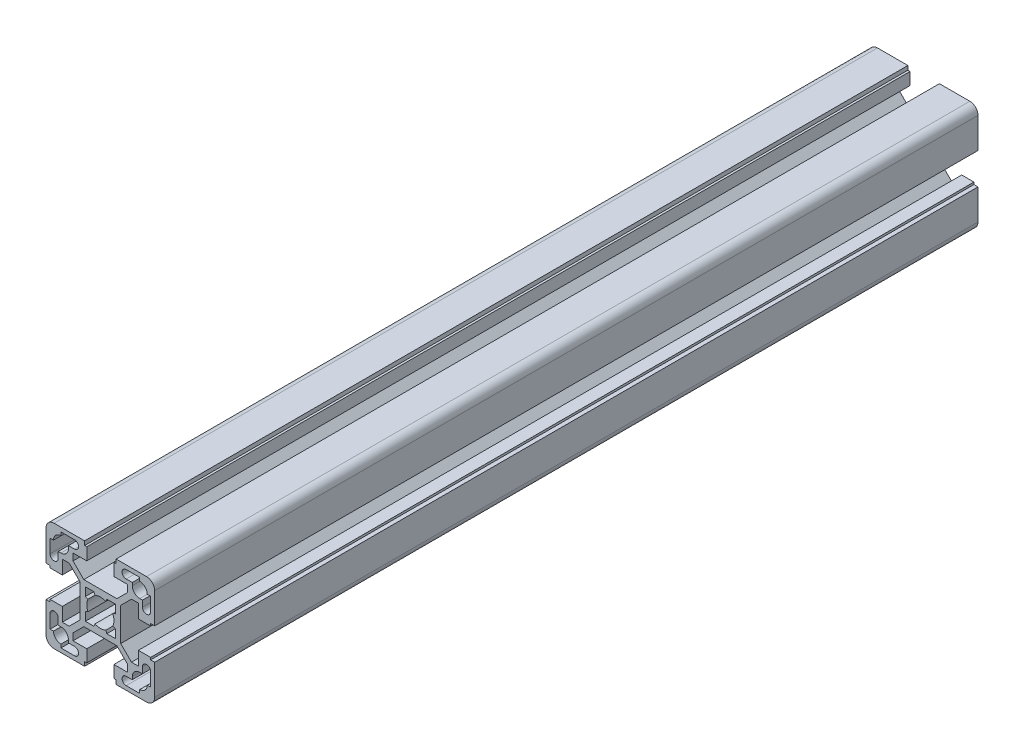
ISO-10303-21;
HEADER;
FILE_DESCRIPTION(('STEP AP214'),'2;1');
FILE_NAME('part.step','',(''),(''),'','','');
FILE_SCHEMA(('AUTOMOTIVE_DESIGN { 1 0 10303 214 1 1 1 1 }'));
ENDSEC;
DATA;
#1=APPLICATION_CONTEXT('core data for automotive mechanical design processes');
#2=APPLICATION_PROTOCOL_DEFINITION('international standard','automotive_design',2000,#1);
#3=PRODUCT_CONTEXT('',#1,'mechanical');
#4=PRODUCT('Part','Part','',(#3));
#5=PRODUCT_RELATED_PRODUCT_CATEGORY('part','',(#4));
#6=PRODUCT_DEFINITION_FORMATION('','',#4);
#7=PRODUCT_DEFINITION_CONTEXT('part definition',#1,'design');
#8=PRODUCT_DEFINITION('design','',#6,#7);
#9=PRODUCT_DEFINITION_SHAPE('','',#8);
#10=(LENGTH_UNIT() NAMED_UNIT(*) SI_UNIT(.MILLI.,.METRE.));
#11=(NAMED_UNIT(*) PLANE_ANGLE_UNIT() SI_UNIT($,.RADIAN.));
#12=(NAMED_UNIT(*) SI_UNIT($,.STERADIAN.) SOLID_ANGLE_UNIT());
#13=UNCERTAINTY_MEASURE_WITH_UNIT(LENGTH_MEASURE(1.E-05),#10,'distance_accuracy_value','');
#14=(GEOMETRIC_REPRESENTATION_CONTEXT(3) GLOBAL_UNCERTAINTY_ASSIGNED_CONTEXT((#13)) GLOBAL_UNIT_ASSIGNED_CONTEXT((#10,
#11,#12)) REPRESENTATION_CONTEXT('',''));
#15=CARTESIAN_POINT('',(0.,0.,0.));
#16=DIRECTION('',(0.,0.,1.));
#17=DIRECTION('',(1.,0.,0.));
#18=AXIS2_PLACEMENT_3D('',#15,#16,#17);
#19=CARTESIAN_POINT('',(-14.5000000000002,-11.75,303.));
#20=DIRECTION('',(0.,-1.,0.));
#21=DIRECTION('',(1.,0.,0.));
#22=AXIS2_PLACEMENT_3D('',#19,#20,#21);
#23=PLANE('',#22);
#24=DIRECTION('',(1.,0.,0.));
#25=VECTOR('',#24,1.);
#26=CARTESIAN_POINT('',(-14.5000000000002,-11.75,303.));
#27=LINE('',#26,#25);
#28=CARTESIAN_POINT('',(-14.5000000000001,-11.75,303.));
#29=VERTEX_POINT('',#28);
#30=CARTESIAN_POINT('',(-15.5000000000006,-11.75,303.));
#31=VERTEX_POINT('',#30);
#32=EDGE_CURVE('E806',#29,#31,#27,.F.);
#33=ORIENTED_EDGE('',*,*,#32,.T.);
#34=DIRECTION('',(0.,0.,1.));
#35=VECTOR('',#34,1.);
#36=CARTESIAN_POINT('',(-15.5000000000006,-11.75,303.));
#37=LINE('',#36,#35);
#38=CARTESIAN_POINT('',(-15.5000000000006,-11.75,0.));
#39=VERTEX_POINT('',#38);
#40=EDGE_CURVE('E804',#39,#31,#37,.T.);
#41=ORIENTED_EDGE('',*,*,#40,.F.);
#42=DIRECTION('',(1.,0.,0.));
#43=VECTOR('',#42,1.);
#44=CARTESIAN_POINT('',(-14.5000000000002,-11.75,0.));
#45=LINE('',#44,#43);
#46=CARTESIAN_POINT('',(-14.5000000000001,-11.75,0.));
#47=VERTEX_POINT('',#46);
#48=EDGE_CURVE('E20',#39,#47,#45,.T.);
#49=ORIENTED_EDGE('',*,*,#48,.T.);
#50=DIRECTION('',(0.,0.,-1.));
#51=VECTOR('',#50,1.);
#52=CARTESIAN_POINT('',(-14.5000000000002,-11.75,303.));
#53=LINE('',#52,#51);
#54=EDGE_CURVE('E801',#47,#29,#53,.F.);
#55=ORIENTED_EDGE('',*,*,#54,.T.);
#56=EDGE_LOOP('',(#33,#41,#49,#55));
#57=FACE_BOUND('',#56,.T.);
#58=ADVANCED_FACE('F17',(#57),#23,.T.);
#59=CARTESIAN_POINT('',(-11.7500000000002,-15.5,303.));
#60=DIRECTION('',(-1.,0.,0.));
#61=DIRECTION('',(0.,-1.,0.));
#62=AXIS2_PLACEMENT_3D('',#59,#60,#61);
#63=PLANE('',#62);
#64=DIRECTION('',(0.,-1.,0.));
#65=VECTOR('',#64,1.);
#66=CARTESIAN_POINT('',(-11.7500000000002,-15.5,303.));
#67=LINE('',#66,#65);
#68=CARTESIAN_POINT('',(-11.7500000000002,-15.5,303.));
#69=VERTEX_POINT('',#68);
#70=CARTESIAN_POINT('',(-11.7500000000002,-14.5,303.));
#71=VERTEX_POINT('',#70);
#72=EDGE_CURVE('E1218',#69,#71,#67,.F.);
#73=ORIENTED_EDGE('',*,*,#72,.T.);
#74=DIRECTION('',(0.,0.,-1.));
#75=VECTOR('',#74,1.);
#76=CARTESIAN_POINT('',(-11.7500000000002,-14.5,303.));
#77=LINE('',#76,#75);
#78=CARTESIAN_POINT('',(-11.7500000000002,-14.5,0.));
#79=VERTEX_POINT('',#78);
#80=EDGE_CURVE('E814',#71,#79,#77,.T.);
#81=ORIENTED_EDGE('',*,*,#80,.T.);
#82=DIRECTION('',(0.,-1.,0.));
#83=VECTOR('',#82,1.);
#84=CARTESIAN_POINT('',(-11.7500000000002,-15.5,0.));
#85=LINE('',#84,#83);
#86=CARTESIAN_POINT('',(-11.7500000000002,-15.5,0.));
#87=VERTEX_POINT('',#86);
#88=EDGE_CURVE('E819',#79,#87,#85,.T.);
#89=ORIENTED_EDGE('',*,*,#88,.T.);
#90=DIRECTION('',(0.,0.,-1.));
#91=VECTOR('',#90,1.);
#92=CARTESIAN_POINT('',(-11.7500000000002,-15.5,303.));
#93=LINE('',#92,#91);
#94=EDGE_CURVE('E1262',#69,#87,#93,.T.);
#95=ORIENTED_EDGE('',*,*,#94,.F.);
#96=EDGE_LOOP('',(#73,#81,#89,#95));
#97=FACE_BOUND('',#96,.T.);
#98=ADVANCED_FACE('F1555',(#97),#63,.T.);
#99=CARTESIAN_POINT('',(-14.5000000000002,-17.25,303.));
#100=DIRECTION('',(1.,0.,0.));
#101=DIRECTION('',(0.,0.,-1.));
#102=AXIS2_PLACEMENT_3D('',#99,#100,#101);
#103=PLANE('',#102);
#104=DIRECTION('',(0.,1.,0.));
#105=VECTOR('',#104,1.);
#106=CARTESIAN_POINT('',(-14.5000000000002,-17.25,303.));
#107=LINE('',#106,#105);
#108=CARTESIAN_POINT('',(-14.5000000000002,-17.25,303.));
#109=VERTEX_POINT('',#108);
#110=CARTESIAN_POINT('',(-14.5000000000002,-18.5,303.));
#111=VERTEX_POINT('',#110);
#112=EDGE_CURVE('E1214',#109,#111,#107,.F.);
#113=ORIENTED_EDGE('',*,*,#112,.T.);
#114=DIRECTION('',(0.,0.,1.));
#115=VECTOR('',#114,1.);
#116=CARTESIAN_POINT('',(-14.5000000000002,-18.5,303.));
#117=LINE('',#116,#115);
#118=CARTESIAN_POINT('',(-14.5000000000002,-18.5,0.));
#119=VERTEX_POINT('',#118);
#120=EDGE_CURVE('E1256',#119,#111,#117,.T.);
#121=ORIENTED_EDGE('',*,*,#120,.F.);
#122=DIRECTION('',(0.,1.,0.));
#123=VECTOR('',#122,1.);
#124=CARTESIAN_POINT('',(-14.5000000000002,-17.25,0.));
#125=LINE('',#124,#123);
#126=CARTESIAN_POINT('',(-14.5000000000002,-17.25,0.));
#127=VERTEX_POINT('',#126);
#128=EDGE_CURVE('E1216',#119,#127,#125,.T.);
#129=ORIENTED_EDGE('',*,*,#128,.T.);
#130=DIRECTION('',(0.,0.,-1.));
#131=VECTOR('',#130,1.);
#132=CARTESIAN_POINT('',(-14.5000000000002,-17.25,303.));
#133=LINE('',#132,#131);
#134=EDGE_CURVE('E1251',#127,#109,#133,.F.);
#135=ORIENTED_EDGE('',*,*,#134,.T.);
#136=EDGE_LOOP('',(#113,#121,#129,#135));
#137=FACE_BOUND('',#136,.T.);
#138=ADVANCED_FACE('F1560',(#137),#103,.T.);
#139=CARTESIAN_POINT('',(-18.5000000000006,-14.5000000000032,303.));
#140=DIRECTION('',(0.,1.,0.));
#141=DIRECTION('',(0.,0.,1.));
#142=AXIS2_PLACEMENT_3D('',#139,#140,#141);
#143=PLANE('',#142);
#144=DIRECTION('',(1.,0.,0.));
#145=VECTOR('',#144,1.);
#146=CARTESIAN_POINT('',(-18.5000000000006,-14.5000000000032,303.));
#147=LINE('',#146,#145);
#148=CARTESIAN_POINT('',(-18.5000000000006,-14.5000000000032,303.));
#149=VERTEX_POINT('',#148);
#150=CARTESIAN_POINT('',(-17.2500000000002,-14.5000000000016,303.));
#151=VERTEX_POINT('',#150);
#152=EDGE_CURVE('E1210',#149,#151,#147,.T.);
#153=ORIENTED_EDGE('',*,*,#152,.T.);
#154=DIRECTION('',(0.,0.,-1.));
#155=VECTOR('',#154,1.);
#156=CARTESIAN_POINT('',(-17.2500000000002,-14.5,303.));
#157=LINE('',#156,#155);
#158=CARTESIAN_POINT('',(-17.2500000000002,-14.5000000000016,0.));
#159=VERTEX_POINT('',#158);
#160=EDGE_CURVE('E1248',#151,#159,#157,.T.);
#161=ORIENTED_EDGE('',*,*,#160,.T.);
#162=DIRECTION('',(1.,0.,0.));
#163=VECTOR('',#162,1.);
#164=CARTESIAN_POINT('',(-18.5000000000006,-14.5000000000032,0.));
#165=LINE('',#164,#163);
#166=CARTESIAN_POINT('',(-18.5000000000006,-14.5000000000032,0.));
#167=VERTEX_POINT('',#166);
#168=EDGE_CURVE('E1212',#159,#167,#165,.F.);
#169=ORIENTED_EDGE('',*,*,#168,.T.);
#170=DIRECTION('',(0.,0.,-1.));
#171=VECTOR('',#170,1.);
#172=CARTESIAN_POINT('',(-18.5000000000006,-14.5000000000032,303.));
#173=LINE('',#172,#171);
#174=EDGE_CURVE('E1242',#149,#167,#173,.T.);
#175=ORIENTED_EDGE('',*,*,#174,.F.);
#176=EDGE_LOOP('',(#153,#161,#169,#175));
#177=FACE_BOUND('',#176,.T.);
#178=ADVANCED_FACE('F1569',(#177),#143,.T.);
#179=CARTESIAN_POINT('',(18.5000000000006,-14.5000000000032,303.));
#180=DIRECTION('',(0.,1.,0.));
#181=DIRECTION('',(0.,0.,1.));
#182=AXIS2_PLACEMENT_3D('',#179,#180,#181);
#183=PLANE('',#182);
#184=DIRECTION('',(1.,0.,0.));
#185=VECTOR('',#184,1.);
#186=CARTESIAN_POINT('',(18.5000000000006,-14.5000000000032,303.));
#187=LINE('',#186,#185);
#188=CARTESIAN_POINT('',(17.2500000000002,-14.5000000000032,303.));
#189=VERTEX_POINT('',#188);
#190=CARTESIAN_POINT('',(18.5000000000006,-14.5000000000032,303.));
#191=VERTEX_POINT('',#190);
#192=EDGE_CURVE('E1206',#189,#191,#187,.T.);
#193=ORIENTED_EDGE('',*,*,#192,.T.);
#194=DIRECTION('',(0.,0.,1.));
#195=VECTOR('',#194,1.);
#196=CARTESIAN_POINT('',(18.5000000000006,-14.5000000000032,303.));
#197=LINE('',#196,#195);
#198=CARTESIAN_POINT('',(18.5000000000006,-14.5000000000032,0.));
#199=VERTEX_POINT('',#198);
#200=EDGE_CURVE('E1947',#199,#191,#197,.T.);
#201=ORIENTED_EDGE('',*,*,#200,.F.);
#202=DIRECTION('',(1.,0.,0.));
#203=VECTOR('',#202,1.);
#204=CARTESIAN_POINT('',(18.5000000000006,-14.5000000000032,0.));
#205=LINE('',#204,#203);
#206=CARTESIAN_POINT('',(17.2500000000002,-14.5000000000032,0.));
#207=VERTEX_POINT('',#206);
#208=EDGE_CURVE('E1208',#199,#207,#205,.F.);
#209=ORIENTED_EDGE('',*,*,#208,.T.);
#210=DIRECTION('',(0.,0.,-1.));
#211=VECTOR('',#210,1.);
#212=CARTESIAN_POINT('',(17.2500000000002,-14.5000000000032,303.));
#213=LINE('',#212,#211);
#214=EDGE_CURVE('E1952',#207,#189,#213,.F.);
#215=ORIENTED_EDGE('',*,*,#214,.T.);
#216=EDGE_LOOP('',(#193,#201,#209,#215));
#217=FACE_BOUND('',#216,.T.);
#218=ADVANCED_FACE('F2472',(#217),#183,.T.);
#219=CARTESIAN_POINT('',(14.5000000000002,-17.25,303.));
#220=DIRECTION('',(-1.,0.,0.));
#221=DIRECTION('',(0.,0.,1.));
#222=AXIS2_PLACEMENT_3D('',#219,#220,#221);
#223=PLANE('',#222);
#224=DIRECTION('',(0.,1.,0.));
#225=VECTOR('',#224,1.);
#226=CARTESIAN_POINT('',(14.5000000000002,-17.25,303.));
#227=LINE('',#226,#225);
#228=CARTESIAN_POINT('',(14.5000000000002,-18.5,303.));
#229=VERTEX_POINT('',#228);
#230=CARTESIAN_POINT('',(14.5000000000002,-17.25,303.));
#231=VERTEX_POINT('',#230);
#232=EDGE_CURVE('E1202',#229,#231,#227,.T.);
#233=ORIENTED_EDGE('',*,*,#232,.T.);
#234=DIRECTION('',(0.,0.,-1.));
#235=VECTOR('',#234,1.);
#236=CARTESIAN_POINT('',(14.5000000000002,-17.25,303.));
#237=LINE('',#236,#235);
#238=CARTESIAN_POINT('',(14.5000000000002,-17.25,0.));
#239=VERTEX_POINT('',#238);
#240=EDGE_CURVE('E1955',#231,#239,#237,.T.);
#241=ORIENTED_EDGE('',*,*,#240,.T.);
#242=DIRECTION('',(0.,1.,0.));
#243=VECTOR('',#242,1.);
#244=CARTESIAN_POINT('',(14.5000000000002,-17.25,0.));
#245=LINE('',#244,#243);
#246=CARTESIAN_POINT('',(14.5000000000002,-18.5,0.));
#247=VERTEX_POINT('',#246);
#248=EDGE_CURVE('E1204',#239,#247,#245,.F.);
#249=ORIENTED_EDGE('',*,*,#248,.T.);
#250=DIRECTION('',(0.,0.,1.));
#251=VECTOR('',#250,1.);
#252=CARTESIAN_POINT('',(14.5000000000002,-18.5,303.));
#253=LINE('',#252,#251);
#254=EDGE_CURVE('E1958',#229,#247,#253,.F.);
#255=ORIENTED_EDGE('',*,*,#254,.F.);
#256=EDGE_LOOP('',(#233,#241,#249,#255));
#257=FACE_BOUND('',#256,.T.);
#258=ADVANCED_FACE('F2468',(#257),#223,.T.);
#259=CARTESIAN_POINT('',(11.7500000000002,-15.5,303.));
#260=DIRECTION('',(1.,0.,0.));
#261=DIRECTION('',(0.,1.,0.));
#262=AXIS2_PLACEMENT_3D('',#259,#260,#261);
#263=PLANE('',#262);
#264=DIRECTION('',(0.,1.,0.));
#265=VECTOR('',#264,1.);
#266=CARTESIAN_POINT('',(11.7500000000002,-15.5,303.));
#267=LINE('',#266,#265);
#268=CARTESIAN_POINT('',(11.7500000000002,-14.5,303.));
#269=VERTEX_POINT('',#268);
#270=CARTESIAN_POINT('',(11.7500000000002,-15.5,303.));
#271=VERTEX_POINT('',#270);
#272=EDGE_CURVE('E1198',#269,#271,#267,.F.);
#273=ORIENTED_EDGE('',*,*,#272,.T.);
#274=DIRECTION('',(0.,0.,-1.));
#275=VECTOR('',#274,1.);
#276=CARTESIAN_POINT('',(11.7500000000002,-15.5,303.));
#277=LINE('',#276,#275);
#278=CARTESIAN_POINT('',(11.7500000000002,-15.5,0.));
#279=VERTEX_POINT('',#278);
#280=EDGE_CURVE('E1964',#279,#271,#277,.F.);
#281=ORIENTED_EDGE('',*,*,#280,.F.);
#282=DIRECTION('',(0.,1.,0.));
#283=VECTOR('',#282,1.);
#284=CARTESIAN_POINT('',(11.7500000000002,-15.5,0.));
#285=LINE('',#284,#283);
#286=CARTESIAN_POINT('',(11.7500000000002,-14.5,0.));
#287=VERTEX_POINT('',#286);
#288=EDGE_CURVE('E1200',#279,#287,#285,.T.);
#289=ORIENTED_EDGE('',*,*,#288,.T.);
#290=DIRECTION('',(0.,0.,-1.));
#291=VECTOR('',#290,1.);
#292=CARTESIAN_POINT('',(11.7500000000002,-14.5,303.));
#293=LINE('',#292,#291);
#294=EDGE_CURVE('E1969',#287,#269,#293,.F.);
#295=ORIENTED_EDGE('',*,*,#294,.T.);
#296=EDGE_LOOP('',(#273,#281,#289,#295));
#297=FACE_BOUND('',#296,.T.);
#298=ADVANCED_FACE('F2465',(#297),#263,.T.);
#299=CARTESIAN_POINT('',(14.5000000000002,-11.75,303.));
#300=DIRECTION('',(0.,-1.,0.));
#301=DIRECTION('',(1.,0.,0.));
#302=AXIS2_PLACEMENT_3D('',#299,#300,#301);
#303=PLANE('',#302);
#304=DIRECTION('',(1.,0.,0.));
#305=VECTOR('',#304,1.);
#306=CARTESIAN_POINT('',(14.5000000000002,-11.75,303.));
#307=LINE('',#306,#305);
#308=CARTESIAN_POINT('',(15.5000000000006,-11.75,303.));
#309=VERTEX_POINT('',#308);
#310=CARTESIAN_POINT('',(14.5000000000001,-11.75,303.));
#311=VERTEX_POINT('',#310);
#312=EDGE_CURVE('E1194',#309,#311,#307,.F.);
#313=ORIENTED_EDGE('',*,*,#312,.T.);
#314=DIRECTION('',(0.,0.,-1.));
#315=VECTOR('',#314,1.);
#316=CARTESIAN_POINT('',(14.5000000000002,-11.75,303.));
#317=LINE('',#316,#315);
#318=CARTESIAN_POINT('',(14.5000000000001,-11.75,0.));
#319=VERTEX_POINT('',#318);
#320=EDGE_CURVE('E1940',#311,#319,#317,.T.);
#321=ORIENTED_EDGE('',*,*,#320,.T.);
#322=DIRECTION('',(1.,0.,0.));
#323=VECTOR('',#322,1.);
#324=CARTESIAN_POINT('',(14.5000000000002,-11.75,0.));
#325=LINE('',#324,#323);
#326=CARTESIAN_POINT('',(15.5000000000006,-11.75,0.));
#327=VERTEX_POINT('',#326);
#328=EDGE_CURVE('E1196',#319,#327,#325,.T.);
#329=ORIENTED_EDGE('',*,*,#328,.T.);
#330=DIRECTION('',(0.,0.,-1.));
#331=VECTOR('',#330,1.);
#332=CARTESIAN_POINT('',(15.5000000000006,-11.75,303.));
#333=LINE('',#332,#331);
#334=EDGE_CURVE('E1237',#309,#327,#333,.T.);
#335=ORIENTED_EDGE('',*,*,#334,.F.);
#336=EDGE_LOOP('',(#313,#321,#329,#335));
#337=FACE_BOUND('',#336,.T.);
#338=ADVANCED_FACE('F1939',(#337),#303,.T.);
#339=CARTESIAN_POINT('',(5.80000000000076,-18.5000000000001,303.));
#340=DIRECTION('',(1.,0.,0.));
#341=DIRECTION('',(0.,0.,-1.));
#342=AXIS2_PLACEMENT_3D('',#339,#340,#341);
#343=PLANE('',#342);
#344=DIRECTION('',(0.,0.,1.));
#345=VECTOR('',#344,1.);
#346=CARTESIAN_POINT('',(5.80000000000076,-20.,303.));
#347=LINE('',#346,#345);
#348=CARTESIAN_POINT('',(5.80000000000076,-20.,0.));
#349=VERTEX_POINT('',#348);
#350=CARTESIAN_POINT('',(5.80000000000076,-20.,303.));
#351=VERTEX_POINT('',#350);
#352=EDGE_CURVE('E1973',#349,#351,#347,.T.);
#353=ORIENTED_EDGE('',*,*,#352,.T.);
#354=DIRECTION('',(0.,1.,0.));
#355=VECTOR('',#354,1.);
#356=CARTESIAN_POINT('',(5.80000000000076,-17.,303.));
#357=LINE('',#356,#355);
#358=CARTESIAN_POINT('',(5.80000000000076,-18.5000000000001,303.));
#359=VERTEX_POINT('',#358);
#360=EDGE_CURVE('E1192',#359,#351,#357,.F.);
#361=ORIENTED_EDGE('',*,*,#360,.F.);
#362=DIRECTION('',(0.,0.,1.));
#363=VECTOR('',#362,1.);
#364=CARTESIAN_POINT('',(5.80000000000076,-18.5000000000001,303.));
#365=LINE('',#364,#363);
#366=CARTESIAN_POINT('',(5.80000000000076,-18.5000000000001,0.));
#367=VERTEX_POINT('',#366);
#368=EDGE_CURVE('E1116',#359,#367,#365,.F.);
#369=ORIENTED_EDGE('',*,*,#368,.T.);
#370=DIRECTION('',(0.,1.,0.));
#371=VECTOR('',#370,1.);
#372=CARTESIAN_POINT('',(5.80000000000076,-17.,0.));
#373=LINE('',#372,#371);
#374=EDGE_CURVE('E1190',#349,#367,#373,.T.);
#375=ORIENTED_EDGE('',*,*,#374,.F.);
#376=EDGE_LOOP('',(#353,#361,#369,#375));
#377=FACE_BOUND('',#376,.T.);
#378=ADVANCED_FACE('F2286',(#377),#343,.F.);
#379=CARTESIAN_POINT('',(20.,-5.79999999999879,303.));
#380=DIRECTION('',(0.,-1.,0.));
#381=DIRECTION('',(0.,0.,-1.));
#382=AXIS2_PLACEMENT_3D('',#379,#380,#381);
#383=PLANE('',#382);
#384=DIRECTION('',(0.,0.,1.));
#385=VECTOR('',#384,1.);
#386=CARTESIAN_POINT('',(18.5,-5.79999999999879,303.));
#387=LINE('',#386,#385);
#388=CARTESIAN_POINT('',(18.5,-5.79999999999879,0.));
#389=VERTEX_POINT('',#388);
#390=CARTESIAN_POINT('',(18.5,-5.79999999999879,303.));
#391=VERTEX_POINT('',#390);
#392=EDGE_CURVE('E1185',#389,#391,#387,.T.);
#393=ORIENTED_EDGE('',*,*,#392,.T.);
#394=DIRECTION('',(1.,0.,0.));
#395=VECTOR('',#394,1.);
#396=CARTESIAN_POINT('',(17.,-5.79999999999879,303.));
#397=LINE('',#396,#395);
#398=CARTESIAN_POINT('',(20.,-5.79999999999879,303.));
#399=VERTEX_POINT('',#398);
#400=EDGE_CURVE('E1188',#399,#391,#397,.F.);
#401=ORIENTED_EDGE('',*,*,#400,.F.);
#402=DIRECTION('',(0.,0.,1.));
#403=VECTOR('',#402,1.);
#404=CARTESIAN_POINT('',(20.,-5.79999999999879,303.));
#405=LINE('',#404,#403);
#406=CARTESIAN_POINT('',(20.,-5.79999999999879,0.));
#407=VERTEX_POINT('',#406);
#408=EDGE_CURVE('E1981',#399,#407,#405,.F.);
#409=ORIENTED_EDGE('',*,*,#408,.T.);
#410=DIRECTION('',(1.,0.,0.));
#411=VECTOR('',#410,1.);
#412=CARTESIAN_POINT('',(17.,-5.79999999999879,0.));
#413=LINE('',#412,#411);
#414=EDGE_CURVE('E1186',#389,#407,#413,.T.);
#415=ORIENTED_EDGE('',*,*,#414,.F.);
#416=EDGE_LOOP('',(#393,#401,#409,#415));
#417=FACE_BOUND('',#416,.T.);
#418=ADVANCED_FACE('F2294',(#417),#383,.F.);
#419=CARTESIAN_POINT('',(18.5,-5.79999999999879,303.));
#420=DIRECTION('',(-1.,0.,0.));
#421=DIRECTION('',(0.,0.,1.));
#422=AXIS2_PLACEMENT_3D('',#419,#420,#421);
#423=PLANE('',#422);
#424=DIRECTION('',(0.,0.,-1.));
#425=VECTOR('',#424,1.);
#426=CARTESIAN_POINT('',(18.5,-4.99999999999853,303.));
#427=LINE('',#426,#425);
#428=CARTESIAN_POINT('',(18.5,-4.99999999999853,0.));
#429=VERTEX_POINT('',#428);
#430=CARTESIAN_POINT('',(18.5,-4.99999999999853,303.));
#431=VERTEX_POINT('',#430);
#432=EDGE_CURVE('E1984',#429,#431,#427,.F.);
#433=ORIENTED_EDGE('',*,*,#432,.T.);
#434=DIRECTION('',(0.,1.,0.));
#435=VECTOR('',#434,1.);
#436=CARTESIAN_POINT('',(18.5,-17.,303.));
#437=LINE('',#436,#435);
#438=EDGE_CURVE('E1183',#391,#431,#437,.T.);
#439=ORIENTED_EDGE('',*,*,#438,.F.);
#440=ORIENTED_EDGE('',*,*,#392,.F.);
#441=DIRECTION('',(0.,1.,0.));
#442=VECTOR('',#441,1.);
#443=CARTESIAN_POINT('',(18.5,-17.,0.));
#444=LINE('',#443,#442);
#445=EDGE_CURVE('E1180',#429,#389,#444,.F.);
#446=ORIENTED_EDGE('',*,*,#445,.F.);
#447=EDGE_LOOP('',(#433,#439,#440,#446));
#448=FACE_BOUND('',#447,.T.);
#449=ADVANCED_FACE('F2297',(#448),#423,.F.);
#450=CARTESIAN_POINT('',(18.5,5.79999999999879,303.));
#451=DIRECTION('',(-1.,0.,0.));
#452=DIRECTION('',(0.,0.,1.));
#453=AXIS2_PLACEMENT_3D('',#450,#451,#452);
#454=PLANE('',#453);
#455=DIRECTION('',(0.,0.,1.));
#456=VECTOR('',#455,1.);
#457=CARTESIAN_POINT('',(18.5,5.79999999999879,303.));
#458=LINE('',#457,#456);
#459=CARTESIAN_POINT('',(18.5,5.79999999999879,0.));
#460=VERTEX_POINT('',#459);
#461=CARTESIAN_POINT('',(18.5,5.79999999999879,303.));
#462=VERTEX_POINT('',#461);
#463=EDGE_CURVE('E1175',#460,#462,#458,.T.);
#464=ORIENTED_EDGE('',*,*,#463,.T.);
#465=DIRECTION('',(0.,1.,0.));
#466=VECTOR('',#465,1.);
#467=CARTESIAN_POINT('',(18.5,-17.,303.));
#468=LINE('',#467,#466);
#469=CARTESIAN_POINT('',(18.5,4.99999999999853,303.));
#470=VERTEX_POINT('',#469);
#471=EDGE_CURVE('E1178',#470,#462,#468,.T.);
#472=ORIENTED_EDGE('',*,*,#471,.F.);
#473=DIRECTION('',(0.,0.,1.));
#474=VECTOR('',#473,1.);
#475=CARTESIAN_POINT('',(18.5,4.99999999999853,303.));
#476=LINE('',#475,#474);
#477=CARTESIAN_POINT('',(18.5,4.99999999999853,0.));
#478=VERTEX_POINT('',#477);
#479=EDGE_CURVE('E2011',#470,#478,#476,.F.);
#480=ORIENTED_EDGE('',*,*,#479,.T.);
#481=DIRECTION('',(0.,1.,0.));
#482=VECTOR('',#481,1.);
#483=CARTESIAN_POINT('',(18.5,-17.,0.));
#484=LINE('',#483,#482);
#485=EDGE_CURVE('E1176',#460,#478,#484,.F.);
#486=ORIENTED_EDGE('',*,*,#485,.F.);
#487=EDGE_LOOP('',(#464,#472,#480,#486));
#488=FACE_BOUND('',#487,.T.);
#489=ADVANCED_FACE('F2319',(#488),#454,.F.);
#490=CARTESIAN_POINT('',(20.,5.79999999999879,303.));
#491=DIRECTION('',(0.,1.,0.));
#492=DIRECTION('',(0.,0.,1.));
#493=AXIS2_PLACEMENT_3D('',#490,#491,#492);
#494=PLANE('',#493);
#495=DIRECTION('',(0.,0.,1.));
#496=VECTOR('',#495,1.);
#497=CARTESIAN_POINT('',(20.,5.79999999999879,303.));
#498=LINE('',#497,#496);
#499=CARTESIAN_POINT('',(20.,5.79999999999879,0.));
#500=VERTEX_POINT('',#499);
#501=CARTESIAN_POINT('',(20.,5.79999999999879,303.));
#502=VERTEX_POINT('',#501);
#503=EDGE_CURVE('E2014',#500,#502,#498,.T.);
#504=ORIENTED_EDGE('',*,*,#503,.T.);
#505=DIRECTION('',(1.,0.,0.));
#506=VECTOR('',#505,1.);
#507=CARTESIAN_POINT('',(17.,5.79999999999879,303.));
#508=LINE('',#507,#506);
#509=EDGE_CURVE('E1173',#462,#502,#508,.T.);
#510=ORIENTED_EDGE('',*,*,#509,.F.);
#511=ORIENTED_EDGE('',*,*,#463,.F.);
#512=DIRECTION('',(1.,0.,0.));
#513=VECTOR('',#512,1.);
#514=CARTESIAN_POINT('',(17.,5.79999999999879,0.));
#515=LINE('',#514,#513);
#516=EDGE_CURVE('E1170',#500,#460,#515,.F.);
#517=ORIENTED_EDGE('',*,*,#516,.F.);
#518=EDGE_LOOP('',(#504,#510,#511,#517));
#519=FACE_BOUND('',#518,.T.);
#520=ADVANCED_FACE('F2323',(#519),#494,.F.);
#521=CARTESIAN_POINT('',(5.80000000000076,18.5000000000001,303.));
#522=DIRECTION('',(1.,0.,0.));
#523=DIRECTION('',(0.,0.,-1.));
#524=AXIS2_PLACEMENT_3D('',#521,#522,#523);
#525=PLANE('',#524);
#526=DIRECTION('',(0.,0.,-1.));
#527=VECTOR('',#526,1.);
#528=CARTESIAN_POINT('',(5.80000000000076,18.5000000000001,303.));
#529=LINE('',#528,#527);
#530=CARTESIAN_POINT('',(5.80000000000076,18.5000000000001,0.));
#531=VERTEX_POINT('',#530);
#532=CARTESIAN_POINT('',(5.80000000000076,18.5000000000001,303.));
#533=VERTEX_POINT('',#532);
#534=EDGE_CURVE('E1165',#531,#533,#529,.F.);
#535=ORIENTED_EDGE('',*,*,#534,.T.);
#536=DIRECTION('',(0.,1.,0.));
#537=VECTOR('',#536,1.);
#538=CARTESIAN_POINT('',(5.80000000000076,-17.,303.));
#539=LINE('',#538,#537);
#540=CARTESIAN_POINT('',(5.80000000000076,20.,303.));
#541=VERTEX_POINT('',#540);
#542=EDGE_CURVE('E1168',#541,#533,#539,.F.);
#543=ORIENTED_EDGE('',*,*,#542,.F.);
#544=DIRECTION('',(0.,0.,-1.));
#545=VECTOR('',#544,1.);
#546=CARTESIAN_POINT('',(5.80000000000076,20.,303.));
#547=LINE('',#546,#545);
#548=CARTESIAN_POINT('',(5.80000000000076,20.,0.));
#549=VERTEX_POINT('',#548);
#550=EDGE_CURVE('E2022',#541,#549,#547,.T.);
#551=ORIENTED_EDGE('',*,*,#550,.T.);
#552=DIRECTION('',(0.,1.,0.));
#553=VECTOR('',#552,1.);
#554=CARTESIAN_POINT('',(5.80000000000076,-17.,0.));
#555=LINE('',#554,#553);
#556=EDGE_CURVE('E1166',#531,#549,#555,.T.);
#557=ORIENTED_EDGE('',*,*,#556,.F.);
#558=EDGE_LOOP('',(#535,#543,#551,#557));
#559=FACE_BOUND('',#558,.T.);
#560=ADVANCED_FACE('F2334',(#559),#525,.F.);
#561=CARTESIAN_POINT('',(5.00000000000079,18.5000000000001,303.));
#562=DIRECTION('',(0.,-1.,0.));
#563=DIRECTION('',(0.,0.,-1.));
#564=AXIS2_PLACEMENT_3D('',#561,#562,#563);
#565=PLANE('',#564);
#566=DIRECTION('',(0.,0.,1.));
#567=VECTOR('',#566,1.);
#568=CARTESIAN_POINT('',(5.00000000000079,18.5000000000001,303.));
#569=LINE('',#568,#567);
#570=CARTESIAN_POINT('',(5.00000000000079,18.5000000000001,0.));
#571=VERTEX_POINT('',#570);
#572=CARTESIAN_POINT('',(5.00000000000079,18.5000000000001,303.));
#573=VERTEX_POINT('',#572);
#574=EDGE_CURVE('E2025',#571,#573,#569,.T.);
#575=ORIENTED_EDGE('',*,*,#574,.T.);
#576=DIRECTION('',(1.,0.,0.));
#577=VECTOR('',#576,1.);
#578=CARTESIAN_POINT('',(17.,18.5000000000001,303.));
#579=LINE('',#578,#577);
#580=EDGE_CURVE('E1163',#533,#573,#579,.F.);
#581=ORIENTED_EDGE('',*,*,#580,.F.);
#582=ORIENTED_EDGE('',*,*,#534,.F.);
#583=DIRECTION('',(1.,0.,0.));
#584=VECTOR('',#583,1.);
#585=CARTESIAN_POINT('',(17.,18.5000000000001,0.));
#586=LINE('',#585,#584);
#587=EDGE_CURVE('E1160',#571,#531,#586,.T.);
#588=ORIENTED_EDGE('',*,*,#587,.F.);
#589=EDGE_LOOP('',(#575,#581,#582,#588));
#590=FACE_BOUND('',#589,.T.);
#591=ADVANCED_FACE('F2338',(#590),#565,.F.);
#592=CARTESIAN_POINT('',(-5.00000000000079,18.5000000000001,303.));
#593=DIRECTION('',(0.,-1.,0.));
#594=DIRECTION('',(0.,0.,-1.));
#595=AXIS2_PLACEMENT_3D('',#592,#593,#594);
#596=PLANE('',#595);
#597=DIRECTION('',(0.,0.,1.));
#598=VECTOR('',#597,1.);
#599=CARTESIAN_POINT('',(-5.80000000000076,18.5000000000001,303.));
#600=LINE('',#599,#598);
#601=CARTESIAN_POINT('',(-5.80000000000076,18.5000000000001,0.));
#602=VERTEX_POINT('',#601);
#603=CARTESIAN_POINT('',(-5.80000000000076,18.5000000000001,303.));
#604=VERTEX_POINT('',#603);
#605=EDGE_CURVE('E1155',#602,#604,#600,.T.);
#606=ORIENTED_EDGE('',*,*,#605,.T.);
#607=DIRECTION('',(1.,0.,0.));
#608=VECTOR('',#607,1.);
#609=CARTESIAN_POINT('',(17.,18.5000000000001,303.));
#610=LINE('',#609,#608);
#611=CARTESIAN_POINT('',(-5.00000000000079,18.5000000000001,303.));
#612=VERTEX_POINT('',#611);
#613=EDGE_CURVE('E1158',#612,#604,#610,.F.);
#614=ORIENTED_EDGE('',*,*,#613,.F.);
#615=DIRECTION('',(0.,0.,1.));
#616=VECTOR('',#615,1.);
#617=CARTESIAN_POINT('',(-5.00000000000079,18.5000000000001,303.));
#618=LINE('',#617,#616);
#619=CARTESIAN_POINT('',(-5.00000000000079,18.5000000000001,0.));
#620=VERTEX_POINT('',#619);
#621=EDGE_CURVE('E2052',#612,#620,#618,.F.);
#622=ORIENTED_EDGE('',*,*,#621,.T.);
#623=DIRECTION('',(1.,0.,0.));
#624=VECTOR('',#623,1.);
#625=CARTESIAN_POINT('',(17.,18.5000000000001,0.));
#626=LINE('',#625,#624);
#627=EDGE_CURVE('E1156',#602,#620,#626,.T.);
#628=ORIENTED_EDGE('',*,*,#627,.F.);
#629=EDGE_LOOP('',(#606,#614,#622,#628));
#630=FACE_BOUND('',#629,.T.);
#631=ADVANCED_FACE('F2360',(#630),#596,.F.);
#632=CARTESIAN_POINT('',(-5.80000000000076,18.5000000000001,303.));
#633=DIRECTION('',(-1.,0.,0.));
#634=DIRECTION('',(0.,0.,1.));
#635=AXIS2_PLACEMENT_3D('',#632,#633,#634);
#636=PLANE('',#635);
#637=DIRECTION('',(0.,0.,1.));
#638=VECTOR('',#637,1.);
#639=CARTESIAN_POINT('',(-5.80000000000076,20.,303.));
#640=LINE('',#639,#638);
#641=CARTESIAN_POINT('',(-5.80000000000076,20.,0.));
#642=VERTEX_POINT('',#641);
#643=CARTESIAN_POINT('',(-5.80000000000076,20.,303.));
#644=VERTEX_POINT('',#643);
#645=EDGE_CURVE('E2055',#642,#644,#640,.T.);
#646=ORIENTED_EDGE('',*,*,#645,.T.);
#647=DIRECTION('',(0.,1.,0.));
#648=VECTOR('',#647,1.);
#649=CARTESIAN_POINT('',(-5.80000000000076,-17.,303.));
#650=LINE('',#649,#648);
#651=EDGE_CURVE('E1153',#604,#644,#650,.T.);
#652=ORIENTED_EDGE('',*,*,#651,.F.);
#653=ORIENTED_EDGE('',*,*,#605,.F.);
#654=DIRECTION('',(0.,1.,0.));
#655=VECTOR('',#654,1.);
#656=CARTESIAN_POINT('',(-5.80000000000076,-17.,0.));
#657=LINE('',#656,#655);
#658=EDGE_CURVE('E1150',#642,#602,#657,.F.);
#659=ORIENTED_EDGE('',*,*,#658,.F.);
#660=EDGE_LOOP('',(#646,#652,#653,#659));
#661=FACE_BOUND('',#660,.T.);
#662=ADVANCED_FACE('F2364',(#661),#636,.F.);
#663=CARTESIAN_POINT('',(-20.,5.79999999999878,303.));
#664=DIRECTION('',(0.,1.,0.));
#665=DIRECTION('',(0.,0.,1.));
#666=AXIS2_PLACEMENT_3D('',#663,#664,#665);
#667=PLANE('',#666);
#668=DIRECTION('',(0.,0.,-1.));
#669=VECTOR('',#668,1.);
#670=CARTESIAN_POINT('',(-18.5,5.79999999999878,303.));
#671=LINE('',#670,#669);
#672=CARTESIAN_POINT('',(-18.5,5.79999999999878,0.));
#673=VERTEX_POINT('',#672);
#674=CARTESIAN_POINT('',(-18.5,5.79999999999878,303.));
#675=VERTEX_POINT('',#674);
#676=EDGE_CURVE('E1145',#673,#675,#671,.F.);
#677=ORIENTED_EDGE('',*,*,#676,.T.);
#678=DIRECTION('',(1.,0.,0.));
#679=VECTOR('',#678,1.);
#680=CARTESIAN_POINT('',(17.,5.79999999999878,303.));
#681=LINE('',#680,#679);
#682=CARTESIAN_POINT('',(-20.,5.79999999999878,303.));
#683=VERTEX_POINT('',#682);
#684=EDGE_CURVE('E1148',#683,#675,#681,.T.);
#685=ORIENTED_EDGE('',*,*,#684,.F.);
#686=DIRECTION('',(0.,0.,1.));
#687=VECTOR('',#686,1.);
#688=CARTESIAN_POINT('',(-20.,5.79999999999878,303.));
#689=LINE('',#688,#687);
#690=CARTESIAN_POINT('',(-20.,5.79999999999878,0.));
#691=VERTEX_POINT('',#690);
#692=EDGE_CURVE('E2063',#683,#691,#689,.F.);
#693=ORIENTED_EDGE('',*,*,#692,.T.);
#694=DIRECTION('',(1.,0.,0.));
#695=VECTOR('',#694,1.);
#696=CARTESIAN_POINT('',(17.,5.79999999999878,0.));
#697=LINE('',#696,#695);
#698=EDGE_CURVE('E1146',#673,#691,#697,.F.);
#699=ORIENTED_EDGE('',*,*,#698,.F.);
#700=EDGE_LOOP('',(#677,#685,#693,#699));
#701=FACE_BOUND('',#700,.T.);
#702=ADVANCED_FACE('F2375',(#701),#667,.F.);
#703=CARTESIAN_POINT('',(-18.5,5.79999999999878,303.));
#704=DIRECTION('',(1.,0.,0.));
#705=DIRECTION('',(0.,0.,-1.));
#706=AXIS2_PLACEMENT_3D('',#703,#704,#705);
#707=PLANE('',#706);
#708=DIRECTION('',(0.,0.,1.));
#709=VECTOR('',#708,1.);
#710=CARTESIAN_POINT('',(-18.5,4.99999999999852,303.));
#711=LINE('',#710,#709);
#712=CARTESIAN_POINT('',(-18.5,4.99999999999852,0.));
#713=VERTEX_POINT('',#712);
#714=CARTESIAN_POINT('',(-18.5,4.99999999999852,303.));
#715=VERTEX_POINT('',#714);
#716=EDGE_CURVE('E2066',#713,#715,#711,.T.);
#717=ORIENTED_EDGE('',*,*,#716,.T.);
#718=DIRECTION('',(0.,1.,0.));
#719=VECTOR('',#718,1.);
#720=CARTESIAN_POINT('',(-18.5,-17.,303.));
#721=LINE('',#720,#719);
#722=EDGE_CURVE('E1143',#675,#715,#721,.F.);
#723=ORIENTED_EDGE('',*,*,#722,.F.);
#724=ORIENTED_EDGE('',*,*,#676,.F.);
#725=DIRECTION('',(0.,1.,0.));
#726=VECTOR('',#725,1.);
#727=CARTESIAN_POINT('',(-18.5,-17.,0.));
#728=LINE('',#727,#726);
#729=EDGE_CURVE('E1140',#713,#673,#728,.T.);
#730=ORIENTED_EDGE('',*,*,#729,.F.);
#731=EDGE_LOOP('',(#717,#723,#724,#730));
#732=FACE_BOUND('',#731,.T.);
#733=ADVANCED_FACE('F2379',(#732),#707,.F.);
#734=CARTESIAN_POINT('',(-18.5,-5.79999999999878,303.));
#735=DIRECTION('',(1.,0.,0.));
#736=DIRECTION('',(0.,0.,-1.));
#737=AXIS2_PLACEMENT_3D('',#734,#735,#736);
#738=PLANE('',#737);
#739=DIRECTION('',(0.,0.,-1.));
#740=VECTOR('',#739,1.);
#741=CARTESIAN_POINT('',(-18.5,-5.79999999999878,303.));
#742=LINE('',#741,#740);
#743=CARTESIAN_POINT('',(-18.5,-5.79999999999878,0.));
#744=VERTEX_POINT('',#743);
#745=CARTESIAN_POINT('',(-18.5,-5.79999999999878,303.));
#746=VERTEX_POINT('',#745);
#747=EDGE_CURVE('E1135',#744,#746,#742,.F.);
#748=ORIENTED_EDGE('',*,*,#747,.T.);
#749=DIRECTION('',(0.,1.,0.));
#750=VECTOR('',#749,1.);
#751=CARTESIAN_POINT('',(-18.5,-17.,303.));
#752=LINE('',#751,#750);
#753=CARTESIAN_POINT('',(-18.5,-4.99999999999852,303.));
#754=VERTEX_POINT('',#753);
#755=EDGE_CURVE('E1138',#754,#746,#752,.F.);
#756=ORIENTED_EDGE('',*,*,#755,.F.);
#757=DIRECTION('',(0.,0.,1.));
#758=VECTOR('',#757,1.);
#759=CARTESIAN_POINT('',(-18.5,-4.99999999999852,303.));
#760=LINE('',#759,#758);
#761=CARTESIAN_POINT('',(-18.5,-4.99999999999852,0.));
#762=VERTEX_POINT('',#761);
#763=EDGE_CURVE('E2093',#754,#762,#760,.F.);
#764=ORIENTED_EDGE('',*,*,#763,.T.);
#765=DIRECTION('',(0.,1.,0.));
#766=VECTOR('',#765,1.);
#767=CARTESIAN_POINT('',(-18.5,-17.,0.));
#768=LINE('',#767,#766);
#769=EDGE_CURVE('E1136',#744,#762,#768,.T.);
#770=ORIENTED_EDGE('',*,*,#769,.F.);
#771=EDGE_LOOP('',(#748,#756,#764,#770));
#772=FACE_BOUND('',#771,.T.);
#773=ADVANCED_FACE('F2401',(#772),#738,.F.);
#774=CARTESIAN_POINT('',(-20.,-5.79999999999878,303.));
#775=DIRECTION('',(0.,-1.,0.));
#776=DIRECTION('',(0.,0.,-1.));
#777=AXIS2_PLACEMENT_3D('',#774,#775,#776);
#778=PLANE('',#777);
#779=DIRECTION('',(0.,0.,1.));
#780=VECTOR('',#779,1.);
#781=CARTESIAN_POINT('',(-20.,-5.79999999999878,303.));
#782=LINE('',#781,#780);
#783=CARTESIAN_POINT('',(-20.,-5.79999999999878,0.));
#784=VERTEX_POINT('',#783);
#785=CARTESIAN_POINT('',(-20.,-5.79999999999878,303.));
#786=VERTEX_POINT('',#785);
#787=EDGE_CURVE('E2096',#784,#786,#782,.T.);
#788=ORIENTED_EDGE('',*,*,#787,.T.);
#789=DIRECTION('',(1.,0.,0.));
#790=VECTOR('',#789,1.);
#791=CARTESIAN_POINT('',(17.,-5.79999999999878,303.));
#792=LINE('',#791,#790);
#793=EDGE_CURVE('E1133',#746,#786,#792,.F.);
#794=ORIENTED_EDGE('',*,*,#793,.F.);
#795=ORIENTED_EDGE('',*,*,#747,.F.);
#796=DIRECTION('',(1.,0.,0.));
#797=VECTOR('',#796,1.);
#798=CARTESIAN_POINT('',(17.,-5.79999999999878,0.));
#799=LINE('',#798,#797);
#800=EDGE_CURVE('E1130',#784,#744,#799,.T.);
#801=ORIENTED_EDGE('',*,*,#800,.F.);
#802=EDGE_LOOP('',(#788,#794,#795,#801));
#803=FACE_BOUND('',#802,.T.);
#804=ADVANCED_FACE('F2405',(#803),#778,.F.);
#805=CARTESIAN_POINT('',(-5.80000000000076,-18.5000000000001,303.));
#806=DIRECTION('',(-1.,0.,0.));
#807=DIRECTION('',(0.,0.,1.));
#808=AXIS2_PLACEMENT_3D('',#805,#806,#807);
#809=PLANE('',#808);
#810=DIRECTION('',(0.,0.,1.));
#811=VECTOR('',#810,1.);
#812=CARTESIAN_POINT('',(-5.80000000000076,-18.5000000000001,303.));
#813=LINE('',#812,#811);
#814=CARTESIAN_POINT('',(-5.80000000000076,-18.5000000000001,0.));
#815=VERTEX_POINT('',#814);
#816=CARTESIAN_POINT('',(-5.80000000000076,-18.5000000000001,303.));
#817=VERTEX_POINT('',#816);
#818=EDGE_CURVE('E1125',#815,#817,#813,.T.);
#819=ORIENTED_EDGE('',*,*,#818,.T.);
#820=DIRECTION('',(0.,1.,0.));
#821=VECTOR('',#820,1.);
#822=CARTESIAN_POINT('',(-5.80000000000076,-17.,303.));
#823=LINE('',#822,#821);
#824=CARTESIAN_POINT('',(-5.80000000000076,-20.,303.));
#825=VERTEX_POINT('',#824);
#826=EDGE_CURVE('E1128',#825,#817,#823,.T.);
#827=ORIENTED_EDGE('',*,*,#826,.F.);
#828=DIRECTION('',(0.,0.,1.));
#829=VECTOR('',#828,1.);
#830=CARTESIAN_POINT('',(-5.80000000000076,-20.,303.));
#831=LINE('',#830,#829);
#832=CARTESIAN_POINT('',(-5.80000000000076,-20.,0.));
#833=VERTEX_POINT('',#832);
#834=EDGE_CURVE('E2104',#825,#833,#831,.F.);
#835=ORIENTED_EDGE('',*,*,#834,.T.);
#836=DIRECTION('',(0.,1.,0.));
#837=VECTOR('',#836,1.);
#838=CARTESIAN_POINT('',(-5.80000000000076,-17.,0.));
#839=LINE('',#838,#837);
#840=EDGE_CURVE('E1126',#815,#833,#839,.F.);
#841=ORIENTED_EDGE('',*,*,#840,.F.);
#842=EDGE_LOOP('',(#819,#827,#835,#841));
#843=FACE_BOUND('',#842,.T.);
#844=ADVANCED_FACE('F2416',(#843),#809,.F.);
#845=CARTESIAN_POINT('',(-5.00000000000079,-18.5000000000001,303.));
#846=DIRECTION('',(0.,1.,0.));
#847=DIRECTION('',(0.,0.,1.));
#848=AXIS2_PLACEMENT_3D('',#845,#846,#847);
#849=PLANE('',#848);
#850=DIRECTION('',(0.,0.,1.));
#851=VECTOR('',#850,1.);
#852=CARTESIAN_POINT('',(-5.00000000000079,-18.5000000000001,303.));
#853=LINE('',#852,#851);
#854=CARTESIAN_POINT('',(-5.00000000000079,-18.5000000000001,0.));
#855=VERTEX_POINT('',#854);
#856=CARTESIAN_POINT('',(-5.00000000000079,-18.5000000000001,303.));
#857=VERTEX_POINT('',#856);
#858=EDGE_CURVE('E2107',#855,#857,#853,.T.);
#859=ORIENTED_EDGE('',*,*,#858,.T.);
#860=DIRECTION('',(1.,0.,0.));
#861=VECTOR('',#860,1.);
#862=CARTESIAN_POINT('',(17.,-18.5000000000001,303.));
#863=LINE('',#862,#861);
#864=EDGE_CURVE('E1123',#817,#857,#863,.T.);
#865=ORIENTED_EDGE('',*,*,#864,.F.);
#866=ORIENTED_EDGE('',*,*,#818,.F.);
#867=DIRECTION('',(1.,0.,0.));
#868=VECTOR('',#867,1.);
#869=CARTESIAN_POINT('',(17.,-18.5000000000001,0.));
#870=LINE('',#869,#868);
#871=EDGE_CURVE('E1120',#855,#815,#870,.F.);
#872=ORIENTED_EDGE('',*,*,#871,.F.);
#873=EDGE_LOOP('',(#859,#865,#866,#872));
#874=FACE_BOUND('',#873,.T.);
#875=ADVANCED_FACE('F2420',(#874),#849,.F.);
#876=CARTESIAN_POINT('',(5.00000000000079,-18.5000000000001,303.));
#877=DIRECTION('',(0.,1.,0.));
#878=DIRECTION('',(0.,0.,1.));
#879=AXIS2_PLACEMENT_3D('',#876,#877,#878);
#880=PLANE('',#879);
#881=ORIENTED_EDGE('',*,*,#368,.F.);
#882=DIRECTION('',(1.,0.,0.));
#883=VECTOR('',#882,1.);
#884=CARTESIAN_POINT('',(17.,-18.5000000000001,303.));
#885=LINE('',#884,#883);
#886=CARTESIAN_POINT('',(5.00000000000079,-18.5000000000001,303.));
#887=VERTEX_POINT('',#886);
#888=EDGE_CURVE('E1117',#887,#359,#885,.T.);
#889=ORIENTED_EDGE('',*,*,#888,.F.);
#890=DIRECTION('',(0.,0.,1.));
#891=VECTOR('',#890,1.);
#892=CARTESIAN_POINT('',(5.00000000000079,-18.5000000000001,303.));
#893=LINE('',#892,#891);
#894=CARTESIAN_POINT('',(5.00000000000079,-18.5000000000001,0.));
#895=VERTEX_POINT('',#894);
#896=EDGE_CURVE('E2126',#887,#895,#893,.F.);
#897=ORIENTED_EDGE('',*,*,#896,.T.);
#898=DIRECTION('',(1.,0.,0.));
#899=VECTOR('',#898,1.);
#900=CARTESIAN_POINT('',(17.,-18.5000000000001,0.));
#901=LINE('',#900,#899);
#902=EDGE_CURVE('E1114',#367,#895,#901,.F.);
#903=ORIENTED_EDGE('',*,*,#902,.F.);
#904=EDGE_LOOP('',(#881,#889,#897,#903));
#905=FACE_BOUND('',#904,.T.);
#906=ADVANCED_FACE('F2277',(#905),#880,.F.);
#907=CARTESIAN_POINT('',(14.5000000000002,11.75,303.));
#908=DIRECTION('',(0.,1.,0.));
#909=DIRECTION('',(-1.,0.,0.));
#910=AXIS2_PLACEMENT_3D('',#907,#908,#909);
#911=PLANE('',#910);
#912=DIRECTION('',(-1.,0.,0.));
#913=VECTOR('',#912,1.);
#914=CARTESIAN_POINT('',(14.5000000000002,11.75,303.));
#915=LINE('',#914,#913);
#916=CARTESIAN_POINT('',(14.5000000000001,11.75,303.));
#917=VERTEX_POINT('',#916);
#918=CARTESIAN_POINT('',(15.5000000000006,11.75,303.));
#919=VERTEX_POINT('',#918);
#920=EDGE_CURVE('E1110',#917,#919,#915,.F.);
#921=ORIENTED_EDGE('',*,*,#920,.T.);
#922=DIRECTION('',(0.,0.,-1.));
#923=VECTOR('',#922,1.);
#924=CARTESIAN_POINT('',(15.5000000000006,11.75,303.));
#925=LINE('',#924,#923);
#926=CARTESIAN_POINT('',(15.5000000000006,11.75,0.));
#927=VERTEX_POINT('',#926);
#928=EDGE_CURVE('E2129',#927,#919,#925,.F.);
#929=ORIENTED_EDGE('',*,*,#928,.F.);
#930=DIRECTION('',(-1.,0.,0.));
#931=VECTOR('',#930,1.);
#932=CARTESIAN_POINT('',(14.5000000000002,11.75,0.));
#933=LINE('',#932,#931);
#934=CARTESIAN_POINT('',(14.5000000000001,11.75,0.));
#935=VERTEX_POINT('',#934);
#936=EDGE_CURVE('E1112',#927,#935,#933,.T.);
#937=ORIENTED_EDGE('',*,*,#936,.T.);
#938=DIRECTION('',(0.,0.,-1.));
#939=VECTOR('',#938,1.);
#940=CARTESIAN_POINT('',(14.5000000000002,11.75,303.));
#941=LINE('',#940,#939);
#942=EDGE_CURVE('E2132',#935,#917,#941,.F.);
#943=ORIENTED_EDGE('',*,*,#942,.T.);
#944=EDGE_LOOP('',(#921,#929,#937,#943));
#945=FACE_BOUND('',#944,.T.);
#946=ADVANCED_FACE('F2432',(#945),#911,.T.);
#947=CARTESIAN_POINT('',(11.7500000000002,15.5,303.));
#948=DIRECTION('',(1.,0.,0.));
#949=DIRECTION('',(0.,1.,0.));
#950=AXIS2_PLACEMENT_3D('',#947,#948,#949);
#951=PLANE('',#950);
#952=DIRECTION('',(0.,1.,0.));
#953=VECTOR('',#952,1.);
#954=CARTESIAN_POINT('',(11.7500000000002,15.5,303.));
#955=LINE('',#954,#953);
#956=CARTESIAN_POINT('',(11.7500000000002,15.5,303.));
#957=VERTEX_POINT('',#956);
#958=CARTESIAN_POINT('',(11.7500000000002,14.5,303.));
#959=VERTEX_POINT('',#958);
#960=EDGE_CURVE('E1106',#957,#959,#955,.F.);
#961=ORIENTED_EDGE('',*,*,#960,.T.);
#962=DIRECTION('',(0.,0.,-1.));
#963=VECTOR('',#962,1.);
#964=CARTESIAN_POINT('',(11.7500000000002,14.5,303.));
#965=LINE('',#964,#963);
#966=CARTESIAN_POINT('',(11.7500000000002,14.5,0.));
#967=VERTEX_POINT('',#966);
#968=EDGE_CURVE('E2135',#959,#967,#965,.T.);
#969=ORIENTED_EDGE('',*,*,#968,.T.);
#970=DIRECTION('',(0.,1.,0.));
#971=VECTOR('',#970,1.);
#972=CARTESIAN_POINT('',(11.7500000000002,15.5,0.));
#973=LINE('',#972,#971);
#974=CARTESIAN_POINT('',(11.7500000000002,15.5,0.));
#975=VERTEX_POINT('',#974);
#976=EDGE_CURVE('E1108',#967,#975,#973,.T.);
#977=ORIENTED_EDGE('',*,*,#976,.T.);
#978=DIRECTION('',(0.,0.,1.));
#979=VECTOR('',#978,1.);
#980=CARTESIAN_POINT('',(11.7500000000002,15.5,303.));
#981=LINE('',#980,#979);
#982=EDGE_CURVE('E2138',#957,#975,#981,.F.);
#983=ORIENTED_EDGE('',*,*,#982,.F.);
#984=EDGE_LOOP('',(#961,#969,#977,#983));
#985=FACE_BOUND('',#984,.T.);
#986=ADVANCED_FACE('F2634',(#985),#951,.T.);
#987=CARTESIAN_POINT('',(14.5000000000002,17.25,303.));
#988=DIRECTION('',(-1.,0.,0.));
#989=DIRECTION('',(0.,0.,1.));
#990=AXIS2_PLACEMENT_3D('',#987,#988,#989);
#991=PLANE('',#990);
#992=DIRECTION('',(0.,1.,0.));
#993=VECTOR('',#992,1.);
#994=CARTESIAN_POINT('',(14.5000000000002,17.25,303.));
#995=LINE('',#994,#993);
#996=CARTESIAN_POINT('',(14.5000000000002,17.25,303.));
#997=VERTEX_POINT('',#996);
#998=CARTESIAN_POINT('',(14.5000000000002,18.5,303.));
#999=VERTEX_POINT('',#998);
#1000=EDGE_CURVE('E1102',#997,#999,#995,.T.);
#1001=ORIENTED_EDGE('',*,*,#1000,.T.);
#1002=DIRECTION('',(0.,0.,-1.));
#1003=VECTOR('',#1002,1.);
#1004=CARTESIAN_POINT('',(14.5000000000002,18.5,303.));
#1005=LINE('',#1004,#1003);
#1006=CARTESIAN_POINT('',(14.5000000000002,18.5,0.));
#1007=VERTEX_POINT('',#1006);
#1008=EDGE_CURVE('E2144',#1007,#999,#1005,.F.);
#1009=ORIENTED_EDGE('',*,*,#1008,.F.);
#1010=DIRECTION('',(0.,1.,0.));
#1011=VECTOR('',#1010,1.);
#1012=CARTESIAN_POINT('',(14.5000000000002,17.25,0.));
#1013=LINE('',#1012,#1011);
#1014=CARTESIAN_POINT('',(14.5000000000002,17.25,0.));
#1015=VERTEX_POINT('',#1014);
#1016=EDGE_CURVE('E1104',#1007,#1015,#1013,.F.);
#1017=ORIENTED_EDGE('',*,*,#1016,.T.);
#1018=DIRECTION('',(0.,0.,-1.));
#1019=VECTOR('',#1018,1.);
#1020=CARTESIAN_POINT('',(14.5000000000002,17.25,303.));
#1021=LINE('',#1020,#1019);
#1022=EDGE_CURVE('E2150',#1015,#997,#1021,.F.);
#1023=ORIENTED_EDGE('',*,*,#1022,.T.);
#1024=EDGE_LOOP('',(#1001,#1009,#1017,#1023));
#1025=FACE_BOUND('',#1024,.T.);
#1026=ADVANCED_FACE('F2643',(#1025),#991,.T.);
#1027=CARTESIAN_POINT('',(18.5000000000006,14.5000000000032,303.));
#1028=DIRECTION('',(0.,-1.,0.));
#1029=DIRECTION('',(0.,0.,-1.));
#1030=AXIS2_PLACEMENT_3D('',#1027,#1028,#1029);
#1031=PLANE('',#1030);
#1032=DIRECTION('',(1.,0.,0.));
#1033=VECTOR('',#1032,1.);
#1034=CARTESIAN_POINT('',(18.5000000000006,14.5000000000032,303.));
#1035=LINE('',#1034,#1033);
#1036=CARTESIAN_POINT('',(18.5000000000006,14.5000000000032,303.));
#1037=VERTEX_POINT('',#1036);
#1038=CARTESIAN_POINT('',(17.2500000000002,14.5000000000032,303.));
#1039=VERTEX_POINT('',#1038);
#1040=EDGE_CURVE('E1098',#1037,#1039,#1035,.F.);
#1041=ORIENTED_EDGE('',*,*,#1040,.T.);
#1042=DIRECTION('',(0.,0.,-1.));
#1043=VECTOR('',#1042,1.);
#1044=CARTESIAN_POINT('',(17.2500000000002,14.5000000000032,303.));
#1045=LINE('',#1044,#1043);
#1046=CARTESIAN_POINT('',(17.2500000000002,14.5000000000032,0.));
#1047=VERTEX_POINT('',#1046);
#1048=EDGE_CURVE('E2153',#1039,#1047,#1045,.T.);
#1049=ORIENTED_EDGE('',*,*,#1048,.T.);
#1050=DIRECTION('',(1.,0.,0.));
#1051=VECTOR('',#1050,1.);
#1052=CARTESIAN_POINT('',(18.5000000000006,14.5000000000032,0.));
#1053=LINE('',#1052,#1051);
#1054=CARTESIAN_POINT('',(18.5000000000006,14.5000000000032,0.));
#1055=VERTEX_POINT('',#1054);
#1056=EDGE_CURVE('E1100',#1047,#1055,#1053,.T.);
#1057=ORIENTED_EDGE('',*,*,#1056,.T.);
#1058=DIRECTION('',(0.,0.,1.));
#1059=VECTOR('',#1058,1.);
#1060=CARTESIAN_POINT('',(18.5000000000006,14.5000000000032,303.));
#1061=LINE('',#1060,#1059);
#1062=EDGE_CURVE('E2156',#1037,#1055,#1061,.F.);
#1063=ORIENTED_EDGE('',*,*,#1062,.F.);
#1064=EDGE_LOOP('',(#1041,#1049,#1057,#1063));
#1065=FACE_BOUND('',#1064,.T.);
#1066=ADVANCED_FACE('F2653',(#1065),#1031,.T.);
#1067=CARTESIAN_POINT('',(4.58333333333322,1.99826313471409,303.));
#1068=DIRECTION('',(-0.399652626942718,0.91666666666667,0.));
#1069=DIRECTION('',(-0.91666666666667,-0.399652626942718,0.));
#1070=AXIS2_PLACEMENT_3D('',#1067,#1068,#1069);
#1071=PLANE('',#1070);
#1072=DIRECTION('',(-0.91666666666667,-0.399652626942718,0.));
#1073=VECTOR('',#1072,1.);
#1074=CARTESIAN_POINT('',(4.58333333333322,1.99826313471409,303.));
#1075=LINE('',#1074,#1073);
#1076=CARTESIAN_POINT('',(4.58333333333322,1.99826313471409,303.));
#1077=VERTEX_POINT('',#1076);
#1078=CARTESIAN_POINT('',(5.49999999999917,2.39791576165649,303.));
#1079=VERTEX_POINT('',#1078);
#1080=EDGE_CURVE('E1094',#1077,#1079,#1075,.F.);
#1081=ORIENTED_EDGE('',*,*,#1080,.T.);
#1082=DIRECTION('',(0.,0.,1.));
#1083=VECTOR('',#1082,1.);
#1084=CARTESIAN_POINT('',(5.49999999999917,2.39791576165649,303.));
#1085=LINE('',#1084,#1083);
#1086=CARTESIAN_POINT('',(5.49999999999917,2.39791576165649,0.));
#1087=VERTEX_POINT('',#1086);
#1088=EDGE_CURVE('E2168',#1087,#1079,#1085,.T.);
#1089=ORIENTED_EDGE('',*,*,#1088,.F.);
#1090=DIRECTION('',(-0.91666666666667,-0.399652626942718,0.));
#1091=VECTOR('',#1090,1.);
#1092=CARTESIAN_POINT('',(4.58333333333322,1.99826313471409,0.));
#1093=LINE('',#1092,#1091);
#1094=CARTESIAN_POINT('',(4.58333333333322,1.99826313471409,0.));
#1095=VERTEX_POINT('',#1094);
#1096=EDGE_CURVE('E1096',#1087,#1095,#1093,.T.);
#1097=ORIENTED_EDGE('',*,*,#1096,.T.);
#1098=DIRECTION('',(0.,0.,-1.));
#1099=VECTOR('',#1098,1.);
#1100=CARTESIAN_POINT('',(4.58333333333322,1.99826313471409,303.));
#1101=LINE('',#1100,#1099);
#1102=EDGE_CURVE('E2174',#1095,#1077,#1101,.F.);
#1103=ORIENTED_EDGE('',*,*,#1102,.T.);
#1104=EDGE_LOOP('',(#1081,#1089,#1097,#1103));
#1105=FACE_BOUND('',#1104,.T.);
#1106=ADVANCED_FACE('F2663',(#1105),#1071,.T.);
#1107=CARTESIAN_POINT('',(4.58333333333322,-1.99826313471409,303.));
#1108=DIRECTION('',(-0.399652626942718,-0.91666666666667,0.));
#1109=DIRECTION('',(0.91666666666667,-0.399652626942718,0.));
#1110=AXIS2_PLACEMENT_3D('',#1107,#1108,#1109);
#1111=PLANE('',#1110);
#1112=DIRECTION('',(0.91666666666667,-0.399652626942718,0.));
#1113=VECTOR('',#1112,1.);
#1114=CARTESIAN_POINT('',(4.58333333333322,-1.99826313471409,303.));
#1115=LINE('',#1114,#1113);
#1116=CARTESIAN_POINT('',(5.49999999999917,-2.39791576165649,303.));
#1117=VERTEX_POINT('',#1116);
#1118=CARTESIAN_POINT('',(4.58333333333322,-1.99826313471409,303.));
#1119=VERTEX_POINT('',#1118);
#1120=EDGE_CURVE('E1090',#1117,#1119,#1115,.F.);
#1121=ORIENTED_EDGE('',*,*,#1120,.T.);
#1122=DIRECTION('',(0.,0.,-1.));
#1123=VECTOR('',#1122,1.);
#1124=CARTESIAN_POINT('',(4.58333333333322,-1.99826313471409,303.));
#1125=LINE('',#1124,#1123);
#1126=CARTESIAN_POINT('',(4.58333333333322,-1.99826313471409,0.));
#1127=VERTEX_POINT('',#1126);
#1128=EDGE_CURVE('E2177',#1119,#1127,#1125,.T.);
#1129=ORIENTED_EDGE('',*,*,#1128,.T.);
#1130=DIRECTION('',(0.91666666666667,-0.399652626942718,0.));
#1131=VECTOR('',#1130,1.);
#1132=CARTESIAN_POINT('',(4.58333333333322,-1.99826313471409,0.));
#1133=LINE('',#1132,#1131);
#1134=CARTESIAN_POINT('',(5.49999999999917,-2.39791576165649,0.));
#1135=VERTEX_POINT('',#1134);
#1136=EDGE_CURVE('E1092',#1127,#1135,#1133,.T.);
#1137=ORIENTED_EDGE('',*,*,#1136,.T.);
#1138=DIRECTION('',(0.,0.,1.));
#1139=VECTOR('',#1138,1.);
#1140=CARTESIAN_POINT('',(5.49999999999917,-2.39791576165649,303.));
#1141=LINE('',#1140,#1139);
#1142=EDGE_CURVE('E2180',#1117,#1135,#1141,.F.);
#1143=ORIENTED_EDGE('',*,*,#1142,.F.);
#1144=EDGE_LOOP('',(#1121,#1129,#1137,#1143));
#1145=FACE_BOUND('',#1144,.T.);
#1146=ADVANCED_FACE('F2673',(#1145),#1111,.T.);
#1147=CARTESIAN_POINT('',(2.39791576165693,-5.49999999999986,303.));
#1148=DIRECTION('',(0.916666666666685,0.399652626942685,0.));
#1149=DIRECTION('',(-0.399652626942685,0.916666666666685,0.));
#1150=AXIS2_PLACEMENT_3D('',#1147,#1148,#1149);
#1151=PLANE('',#1150);
#1152=DIRECTION('',(-0.399652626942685,0.916666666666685,0.));
#1153=VECTOR('',#1152,1.);
#1154=CARTESIAN_POINT('',(2.39791576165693,-5.49999999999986,303.));
#1155=LINE('',#1154,#1153);
#1156=CARTESIAN_POINT('',(1.99826313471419,-4.58333333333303,303.));
#1157=VERTEX_POINT('',#1156);
#1158=CARTESIAN_POINT('',(2.39791576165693,-5.49999999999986,303.));
#1159=VERTEX_POINT('',#1158);
#1160=EDGE_CURVE('E1086',#1157,#1159,#1155,.F.);
#1161=ORIENTED_EDGE('',*,*,#1160,.T.);
#1162=DIRECTION('',(0.,0.,1.));
#1163=VECTOR('',#1162,1.);
#1164=CARTESIAN_POINT('',(2.39791576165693,-5.49999999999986,303.));
#1165=LINE('',#1164,#1163);
#1166=CARTESIAN_POINT('',(2.39791576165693,-5.49999999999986,0.));
#1167=VERTEX_POINT('',#1166);
#1168=EDGE_CURVE('E2183',#1167,#1159,#1165,.T.);
#1169=ORIENTED_EDGE('',*,*,#1168,.F.);
#1170=DIRECTION('',(-0.399652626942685,0.916666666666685,0.));
#1171=VECTOR('',#1170,1.);
#1172=CARTESIAN_POINT('',(2.39791576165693,-5.49999999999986,0.));
#1173=LINE('',#1172,#1171);
#1174=CARTESIAN_POINT('',(1.99826313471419,-4.58333333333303,0.));
#1175=VERTEX_POINT('',#1174);
#1176=EDGE_CURVE('E1088',#1167,#1175,#1173,.T.);
#1177=ORIENTED_EDGE('',*,*,#1176,.T.);
#1178=DIRECTION('',(0.,0.,-1.));
#1179=VECTOR('',#1178,1.);
#1180=CARTESIAN_POINT('',(1.99826313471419,-4.58333333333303,303.));
#1181=LINE('',#1180,#1179);
#1182=EDGE_CURVE('E2189',#1175,#1157,#1181,.F.);
#1183=ORIENTED_EDGE('',*,*,#1182,.T.);
#1184=EDGE_LOOP('',(#1161,#1169,#1177,#1183));
#1185=FACE_BOUND('',#1184,.T.);
#1186=ADVANCED_FACE('F2683',(#1185),#1151,.T.);
#1187=CARTESIAN_POINT('',(-2.39791576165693,-5.49999999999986,303.));
#1188=DIRECTION('',(-0.916666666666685,0.399652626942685,0.));
#1189=DIRECTION('',(-0.399652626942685,-0.916666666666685,0.));
#1190=AXIS2_PLACEMENT_3D('',#1187,#1188,#1189);
#1191=PLANE('',#1190);
#1192=DIRECTION('',(-0.399652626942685,-0.916666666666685,0.));
#1193=VECTOR('',#1192,1.);
#1194=CARTESIAN_POINT('',(-2.39791576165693,-5.49999999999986,303.));
#1195=LINE('',#1194,#1193);
#1196=CARTESIAN_POINT('',(-2.39791576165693,-5.49999999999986,303.));
#1197=VERTEX_POINT('',#1196);
#1198=CARTESIAN_POINT('',(-1.99826313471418,-4.58333333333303,303.));
#1199=VERTEX_POINT('',#1198);
#1200=EDGE_CURVE('E1082',#1197,#1199,#1195,.F.);
#1201=ORIENTED_EDGE('',*,*,#1200,.T.);
#1202=DIRECTION('',(0.,0.,-1.));
#1203=VECTOR('',#1202,1.);
#1204=CARTESIAN_POINT('',(-1.99826313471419,-4.58333333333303,303.));
#1205=LINE('',#1204,#1203);
#1206=CARTESIAN_POINT('',(-1.99826313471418,-4.58333333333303,0.));
#1207=VERTEX_POINT('',#1206);
#1208=EDGE_CURVE('E2192',#1199,#1207,#1205,.T.);
#1209=ORIENTED_EDGE('',*,*,#1208,.T.);
#1210=DIRECTION('',(-0.399652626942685,-0.916666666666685,0.));
#1211=VECTOR('',#1210,1.);
#1212=CARTESIAN_POINT('',(-2.39791576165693,-5.49999999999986,0.));
#1213=LINE('',#1212,#1211);
#1214=CARTESIAN_POINT('',(-2.39791576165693,-5.49999999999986,0.));
#1215=VERTEX_POINT('',#1214);
#1216=EDGE_CURVE('E1084',#1207,#1215,#1213,.T.);
#1217=ORIENTED_EDGE('',*,*,#1216,.T.);
#1218=DIRECTION('',(0.,0.,1.));
#1219=VECTOR('',#1218,1.);
#1220=CARTESIAN_POINT('',(-2.39791576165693,-5.49999999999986,303.));
#1221=LINE('',#1220,#1219);
#1222=EDGE_CURVE('E2195',#1197,#1215,#1221,.F.);
#1223=ORIENTED_EDGE('',*,*,#1222,.F.);
#1224=EDGE_LOOP('',(#1201,#1209,#1217,#1223));
#1225=FACE_BOUND('',#1224,.T.);
#1226=ADVANCED_FACE('F2693',(#1225),#1191,.T.);
#1227=CARTESIAN_POINT('',(-4.58333333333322,-1.99826313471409,303.));
#1228=DIRECTION('',(0.399652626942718,-0.91666666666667,0.));
#1229=DIRECTION('',(0.91666666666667,0.399652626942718,0.));
#1230=AXIS2_PLACEMENT_3D('',#1227,#1228,#1229);
#1231=PLANE('',#1230);
#1232=DIRECTION('',(0.91666666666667,0.399652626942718,0.));
#1233=VECTOR('',#1232,1.);
#1234=CARTESIAN_POINT('',(-4.58333333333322,-1.99826313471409,303.));
#1235=LINE('',#1234,#1233);
#1236=CARTESIAN_POINT('',(-4.58333333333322,-1.99826313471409,303.));
#1237=VERTEX_POINT('',#1236);
#1238=CARTESIAN_POINT('',(-5.49999999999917,-2.39791576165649,303.));
#1239=VERTEX_POINT('',#1238);
#1240=EDGE_CURVE('E1077',#1237,#1239,#1235,.F.);
#1241=ORIENTED_EDGE('',*,*,#1240,.T.);
#1242=DIRECTION('',(0.,0.,1.));
#1243=VECTOR('',#1242,1.);
#1244=CARTESIAN_POINT('',(-5.49999999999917,-2.39791576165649,303.));
#1245=LINE('',#1244,#1243);
#1246=CARTESIAN_POINT('',(-5.49999999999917,-2.39791576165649,0.));
#1247=VERTEX_POINT('',#1246);
#1248=EDGE_CURVE('E2198',#1247,#1239,#1245,.T.);
#1249=ORIENTED_EDGE('',*,*,#1248,.F.);
#1250=DIRECTION('',(0.91666666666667,0.399652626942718,0.));
#1251=VECTOR('',#1250,1.);
#1252=CARTESIAN_POINT('',(-4.58333333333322,-1.99826313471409,0.));
#1253=LINE('',#1252,#1251);
#1254=CARTESIAN_POINT('',(-4.58333333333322,-1.99826313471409,0.));
#1255=VERTEX_POINT('',#1254);
#1256=EDGE_CURVE('E1079',#1247,#1255,#1253,.T.);
#1257=ORIENTED_EDGE('',*,*,#1256,.T.);
#1258=DIRECTION('',(0.,0.,-1.));
#1259=VECTOR('',#1258,1.);
#1260=CARTESIAN_POINT('',(-4.58333333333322,-1.99826313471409,303.));
#1261=LINE('',#1260,#1259);
#1262=EDGE_CURVE('E2204',#1255,#1237,#1261,.F.);
#1263=ORIENTED_EDGE('',*,*,#1262,.T.);
#1264=EDGE_LOOP('',(#1241,#1249,#1257,#1263));
#1265=FACE_BOUND('',#1264,.T.);
#1266=ADVANCED_FACE('F2703',(#1265),#1231,.T.);
#1267=CARTESIAN_POINT('',(-4.58333333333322,1.99826313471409,303.));
#1268=DIRECTION('',(0.399652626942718,0.91666666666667,0.));
#1269=DIRECTION('',(-0.91666666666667,0.399652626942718,0.));
#1270=AXIS2_PLACEMENT_3D('',#1267,#1268,#1269);
#1271=PLANE('',#1270);
#1272=DIRECTION('',(-0.91666666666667,0.399652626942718,0.));
#1273=VECTOR('',#1272,1.);
#1274=CARTESIAN_POINT('',(-4.58333333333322,1.99826313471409,303.));
#1275=LINE('',#1274,#1273);
#1276=CARTESIAN_POINT('',(-5.49999999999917,2.39791576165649,303.));
#1277=VERTEX_POINT('',#1276);
#1278=CARTESIAN_POINT('',(-4.58333333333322,1.99826313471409,303.));
#1279=VERTEX_POINT('',#1278);
#1280=EDGE_CURVE('E1073',#1277,#1279,#1275,.F.);
#1281=ORIENTED_EDGE('',*,*,#1280,.T.);
#1282=DIRECTION('',(0.,0.,-1.));
#1283=VECTOR('',#1282,1.);
#1284=CARTESIAN_POINT('',(-4.58333333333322,1.99826313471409,303.));
#1285=LINE('',#1284,#1283);
#1286=CARTESIAN_POINT('',(-4.58333333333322,1.99826313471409,0.));
#1287=VERTEX_POINT('',#1286);
#1288=EDGE_CURVE('E2207',#1279,#1287,#1285,.T.);
#1289=ORIENTED_EDGE('',*,*,#1288,.T.);
#1290=DIRECTION('',(-0.91666666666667,0.399652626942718,0.));
#1291=VECTOR('',#1290,1.);
#1292=CARTESIAN_POINT('',(-4.58333333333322,1.99826313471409,0.));
#1293=LINE('',#1292,#1291);
#1294=CARTESIAN_POINT('',(-5.49999999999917,2.39791576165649,0.));
#1295=VERTEX_POINT('',#1294);
#1296=EDGE_CURVE('E1075',#1287,#1295,#1293,.T.);
#1297=ORIENTED_EDGE('',*,*,#1296,.T.);
#1298=DIRECTION('',(0.,0.,1.));
#1299=VECTOR('',#1298,1.);
#1300=CARTESIAN_POINT('',(-5.49999999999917,2.39791576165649,303.));
#1301=LINE('',#1300,#1299);
#1302=EDGE_CURVE('E2210',#1277,#1295,#1301,.F.);
#1303=ORIENTED_EDGE('',*,*,#1302,.F.);
#1304=EDGE_LOOP('',(#1281,#1289,#1297,#1303));
#1305=FACE_BOUND('',#1304,.T.);
#1306=ADVANCED_FACE('F2713',(#1305),#1271,.T.);
#1307=CARTESIAN_POINT('',(-2.39791576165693,5.49999999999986,303.));
#1308=DIRECTION('',(-0.916666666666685,-0.399652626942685,0.));
#1309=DIRECTION('',(0.399652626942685,-0.916666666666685,0.));
#1310=AXIS2_PLACEMENT_3D('',#1307,#1308,#1309);
#1311=PLANE('',#1310);
#1312=DIRECTION('',(0.399652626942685,-0.916666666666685,0.));
#1313=VECTOR('',#1312,1.);
#1314=CARTESIAN_POINT('',(-2.39791576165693,5.49999999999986,303.));
#1315=LINE('',#1314,#1313);
#1316=CARTESIAN_POINT('',(-1.99826313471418,4.58333333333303,303.));
#1317=VERTEX_POINT('',#1316);
#1318=CARTESIAN_POINT('',(-2.39791576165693,5.49999999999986,303.));
#1319=VERTEX_POINT('',#1318);
#1320=EDGE_CURVE('E1069',#1317,#1319,#1315,.F.);
#1321=ORIENTED_EDGE('',*,*,#1320,.T.);
#1322=DIRECTION('',(0.,0.,-1.));
#1323=VECTOR('',#1322,1.);
#1324=CARTESIAN_POINT('',(-2.39791576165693,5.49999999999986,303.));
#1325=LINE('',#1324,#1323);
#1326=CARTESIAN_POINT('',(-2.39791576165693,5.49999999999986,0.));
#1327=VERTEX_POINT('',#1326);
#1328=EDGE_CURVE('E2213',#1327,#1319,#1325,.F.);
#1329=ORIENTED_EDGE('',*,*,#1328,.F.);
#1330=DIRECTION('',(0.399652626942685,-0.916666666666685,0.));
#1331=VECTOR('',#1330,1.);
#1332=CARTESIAN_POINT('',(-2.39791576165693,5.49999999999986,0.));
#1333=LINE('',#1332,#1331);
#1334=CARTESIAN_POINT('',(-1.99826313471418,4.58333333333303,0.));
#1335=VERTEX_POINT('',#1334);
#1336=EDGE_CURVE('E1071',#1327,#1335,#1333,.T.);
#1337=ORIENTED_EDGE('',*,*,#1336,.T.);
#1338=DIRECTION('',(0.,0.,-1.));
#1339=VECTOR('',#1338,1.);
#1340=CARTESIAN_POINT('',(-1.99826313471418,4.58333333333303,303.));
#1341=LINE('',#1340,#1339);
#1342=EDGE_CURVE('E2219',#1335,#1317,#1341,.F.);
#1343=ORIENTED_EDGE('',*,*,#1342,.T.);
#1344=EDGE_LOOP('',(#1321,#1329,#1337,#1343));
#1345=FACE_BOUND('',#1344,.T.);
#1346=ADVANCED_FACE('F2723',(#1345),#1311,.T.);
#1347=CARTESIAN_POINT('',(2.39791576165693,5.49999999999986,303.));
#1348=DIRECTION('',(0.916666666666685,-0.399652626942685,0.));
#1349=DIRECTION('',(0.399652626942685,0.916666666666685,0.));
#1350=AXIS2_PLACEMENT_3D('',#1347,#1348,#1349);
#1351=PLANE('',#1350);
#1352=DIRECTION('',(0.399652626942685,0.916666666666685,0.));
#1353=VECTOR('',#1352,1.);
#1354=CARTESIAN_POINT('',(2.39791576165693,5.49999999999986,303.));
#1355=LINE('',#1354,#1353);
#1356=CARTESIAN_POINT('',(2.39791576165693,5.49999999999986,303.));
#1357=VERTEX_POINT('',#1356);
#1358=CARTESIAN_POINT('',(1.99826313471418,4.58333333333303,303.));
#1359=VERTEX_POINT('',#1358);
#1360=EDGE_CURVE('E1065',#1357,#1359,#1355,.F.);
#1361=ORIENTED_EDGE('',*,*,#1360,.T.);
#1362=DIRECTION('',(0.,0.,-1.));
#1363=VECTOR('',#1362,1.);
#1364=CARTESIAN_POINT('',(1.99826313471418,4.58333333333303,303.));
#1365=LINE('',#1364,#1363);
#1366=CARTESIAN_POINT('',(1.99826313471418,4.58333333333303,0.));
#1367=VERTEX_POINT('',#1366);
#1368=EDGE_CURVE('E2222',#1359,#1367,#1365,.T.);
#1369=ORIENTED_EDGE('',*,*,#1368,.T.);
#1370=DIRECTION('',(0.399652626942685,0.916666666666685,0.));
#1371=VECTOR('',#1370,1.);
#1372=CARTESIAN_POINT('',(2.39791576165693,5.49999999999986,0.));
#1373=LINE('',#1372,#1371);
#1374=CARTESIAN_POINT('',(2.39791576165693,5.49999999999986,0.));
#1375=VERTEX_POINT('',#1374);
#1376=EDGE_CURVE('E1067',#1367,#1375,#1373,.T.);
#1377=ORIENTED_EDGE('',*,*,#1376,.T.);
#1378=DIRECTION('',(0.,0.,-1.));
#1379=VECTOR('',#1378,1.);
#1380=CARTESIAN_POINT('',(2.39791576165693,5.49999999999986,303.));
#1381=LINE('',#1380,#1379);
#1382=EDGE_CURVE('E2165',#1357,#1375,#1381,.T.);
#1383=ORIENTED_EDGE('',*,*,#1382,.F.);
#1384=EDGE_LOOP('',(#1361,#1369,#1377,#1383));
#1385=FACE_BOUND('',#1384,.T.);
#1386=ADVANCED_FACE('F2733',(#1385),#1351,.T.);
#1387=CARTESIAN_POINT('',(-18.5000000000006,14.5000000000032,303.));
#1388=DIRECTION('',(0.,-1.,0.));
#1389=DIRECTION('',(0.,0.,-1.));
#1390=AXIS2_PLACEMENT_3D('',#1387,#1388,#1389);
#1391=PLANE('',#1390);
#1392=DIRECTION('',(1.,0.,0.));
#1393=VECTOR('',#1392,1.);
#1394=CARTESIAN_POINT('',(-18.5000000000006,14.5000000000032,303.));
#1395=LINE('',#1394,#1393);
#1396=CARTESIAN_POINT('',(-17.2500000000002,14.5000000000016,303.));
#1397=VERTEX_POINT('',#1396);
#1398=CARTESIAN_POINT('',(-18.5000000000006,14.5000000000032,303.));
#1399=VERTEX_POINT('',#1398);
#1400=EDGE_CURVE('E1061',#1397,#1399,#1395,.F.);
#1401=ORIENTED_EDGE('',*,*,#1400,.T.);
#1402=DIRECTION('',(0.,0.,-1.));
#1403=VECTOR('',#1402,1.);
#1404=CARTESIAN_POINT('',(-18.5000000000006,14.5000000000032,303.));
#1405=LINE('',#1404,#1403);
#1406=CARTESIAN_POINT('',(-18.5000000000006,14.5000000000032,0.));
#1407=VERTEX_POINT('',#1406);
#1408=EDGE_CURVE('E2231',#1407,#1399,#1405,.F.);
#1409=ORIENTED_EDGE('',*,*,#1408,.F.);
#1410=DIRECTION('',(1.,0.,0.));
#1411=VECTOR('',#1410,1.);
#1412=CARTESIAN_POINT('',(-18.5000000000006,14.5000000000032,0.));
#1413=LINE('',#1412,#1411);
#1414=CARTESIAN_POINT('',(-17.2500000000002,14.5000000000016,0.));
#1415=VERTEX_POINT('',#1414);
#1416=EDGE_CURVE('E1063',#1407,#1415,#1413,.T.);
#1417=ORIENTED_EDGE('',*,*,#1416,.T.);
#1418=DIRECTION('',(0.,0.,-1.));
#1419=VECTOR('',#1418,1.);
#1420=CARTESIAN_POINT('',(-17.2500000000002,14.5,303.));
#1421=LINE('',#1420,#1419);
#1422=EDGE_CURVE('E2237',#1415,#1397,#1421,.F.);
#1423=ORIENTED_EDGE('',*,*,#1422,.T.);
#1424=EDGE_LOOP('',(#1401,#1409,#1417,#1423));
#1425=FACE_BOUND('',#1424,.T.);
#1426=ADVANCED_FACE('F2743',(#1425),#1391,.T.);
#1427=CARTESIAN_POINT('',(-14.5000000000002,17.25,303.));
#1428=DIRECTION('',(1.,0.,0.));
#1429=DIRECTION('',(0.,0.,-1.));
#1430=AXIS2_PLACEMENT_3D('',#1427,#1428,#1429);
#1431=PLANE('',#1430);
#1432=DIRECTION('',(0.,1.,0.));
#1433=VECTOR('',#1432,1.);
#1434=CARTESIAN_POINT('',(-14.5000000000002,17.25,303.));
#1435=LINE('',#1434,#1433);
#1436=CARTESIAN_POINT('',(-14.5000000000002,18.5,303.));
#1437=VERTEX_POINT('',#1436);
#1438=CARTESIAN_POINT('',(-14.5000000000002,17.25,303.));
#1439=VERTEX_POINT('',#1438);
#1440=EDGE_CURVE('E1057',#1437,#1439,#1435,.F.);
#1441=ORIENTED_EDGE('',*,*,#1440,.T.);
#1442=DIRECTION('',(0.,0.,-1.));
#1443=VECTOR('',#1442,1.);
#1444=CARTESIAN_POINT('',(-14.5000000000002,17.25,303.));
#1445=LINE('',#1444,#1443);
#1446=CARTESIAN_POINT('',(-14.5000000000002,17.25,0.));
#1447=VERTEX_POINT('',#1446);
#1448=EDGE_CURVE('E2240',#1439,#1447,#1445,.T.);
#1449=ORIENTED_EDGE('',*,*,#1448,.T.);
#1450=DIRECTION('',(0.,1.,0.));
#1451=VECTOR('',#1450,1.);
#1452=CARTESIAN_POINT('',(-14.5000000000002,17.25,0.));
#1453=LINE('',#1452,#1451);
#1454=CARTESIAN_POINT('',(-14.5000000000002,18.5,0.));
#1455=VERTEX_POINT('',#1454);
#1456=EDGE_CURVE('E1059',#1447,#1455,#1453,.T.);
#1457=ORIENTED_EDGE('',*,*,#1456,.T.);
#1458=DIRECTION('',(0.,0.,-1.));
#1459=VECTOR('',#1458,1.);
#1460=CARTESIAN_POINT('',(-14.5000000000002,18.5,303.));
#1461=LINE('',#1460,#1459);
#1462=EDGE_CURVE('E2243',#1437,#1455,#1461,.T.);
#1463=ORIENTED_EDGE('',*,*,#1462,.F.);
#1464=EDGE_LOOP('',(#1441,#1449,#1457,#1463));
#1465=FACE_BOUND('',#1464,.T.);
#1466=ADVANCED_FACE('F2753',(#1465),#1431,.T.);
#1467=CARTESIAN_POINT('',(-11.7500000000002,15.5,303.));
#1468=DIRECTION('',(-1.,0.,0.));
#1469=DIRECTION('',(0.,-1.,0.));
#1470=AXIS2_PLACEMENT_3D('',#1467,#1468,#1469);
#1471=PLANE('',#1470);
#1472=DIRECTION('',(0.,-1.,0.));
#1473=VECTOR('',#1472,1.);
#1474=CARTESIAN_POINT('',(-11.7500000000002,15.5,303.));
#1475=LINE('',#1474,#1473);
#1476=CARTESIAN_POINT('',(-11.7500000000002,14.5,303.));
#1477=VERTEX_POINT('',#1476);
#1478=CARTESIAN_POINT('',(-11.7500000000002,15.5,303.));
#1479=VERTEX_POINT('',#1478);
#1480=EDGE_CURVE('E1053',#1477,#1479,#1475,.F.);
#1481=ORIENTED_EDGE('',*,*,#1480,.T.);
#1482=DIRECTION('',(0.,0.,1.));
#1483=VECTOR('',#1482,1.);
#1484=CARTESIAN_POINT('',(-11.7500000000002,15.5,303.));
#1485=LINE('',#1484,#1483);
#1486=CARTESIAN_POINT('',(-11.7500000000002,15.5,0.));
#1487=VERTEX_POINT('',#1486);
#1488=EDGE_CURVE('E2249',#1487,#1479,#1485,.T.);
#1489=ORIENTED_EDGE('',*,*,#1488,.F.);
#1490=DIRECTION('',(0.,-1.,0.));
#1491=VECTOR('',#1490,1.);
#1492=CARTESIAN_POINT('',(-11.7500000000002,15.5,0.));
#1493=LINE('',#1492,#1491);
#1494=CARTESIAN_POINT('',(-11.7500000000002,14.5,0.));
#1495=VERTEX_POINT('',#1494);
#1496=EDGE_CURVE('E1055',#1487,#1495,#1493,.T.);
#1497=ORIENTED_EDGE('',*,*,#1496,.T.);
#1498=DIRECTION('',(0.,0.,-1.));
#1499=VECTOR('',#1498,1.);
#1500=CARTESIAN_POINT('',(-11.7500000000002,14.5,303.));
#1501=LINE('',#1500,#1499);
#1502=EDGE_CURVE('E2255',#1495,#1477,#1501,.F.);
#1503=ORIENTED_EDGE('',*,*,#1502,.T.);
#1504=EDGE_LOOP('',(#1481,#1489,#1497,#1503));
#1505=FACE_BOUND('',#1504,.T.);
#1506=ADVANCED_FACE('F2763',(#1505),#1471,.T.);
#1507=CARTESIAN_POINT('',(-14.5000000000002,11.75,303.));
#1508=DIRECTION('',(0.,1.,0.));
#1509=DIRECTION('',(-1.,0.,0.));
#1510=AXIS2_PLACEMENT_3D('',#1507,#1508,#1509);
#1511=PLANE('',#1510);
#1512=DIRECTION('',(-1.,0.,0.));
#1513=VECTOR('',#1512,1.);
#1514=CARTESIAN_POINT('',(-14.5000000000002,11.75,303.));
#1515=LINE('',#1514,#1513);
#1516=CARTESIAN_POINT('',(-15.5000000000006,11.75,303.));
#1517=VERTEX_POINT('',#1516);
#1518=CARTESIAN_POINT('',(-14.5000000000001,11.75,303.));
#1519=VERTEX_POINT('',#1518);
#1520=EDGE_CURVE('E1049',#1517,#1519,#1515,.F.);
#1521=ORIENTED_EDGE('',*,*,#1520,.T.);
#1522=DIRECTION('',(0.,0.,-1.));
#1523=VECTOR('',#1522,1.);
#1524=CARTESIAN_POINT('',(-14.5000000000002,11.75,303.));
#1525=LINE('',#1524,#1523);
#1526=CARTESIAN_POINT('',(-14.5000000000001,11.75,0.));
#1527=VERTEX_POINT('',#1526);
#1528=EDGE_CURVE('E2119',#1519,#1527,#1525,.T.);
#1529=ORIENTED_EDGE('',*,*,#1528,.T.);
#1530=DIRECTION('',(-1.,0.,0.));
#1531=VECTOR('',#1530,1.);
#1532=CARTESIAN_POINT('',(-14.5000000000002,11.75,0.));
#1533=LINE('',#1532,#1531);
#1534=CARTESIAN_POINT('',(-15.5000000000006,11.75,0.));
#1535=VERTEX_POINT('',#1534);
#1536=EDGE_CURVE('E1051',#1527,#1535,#1533,.T.);
#1537=ORIENTED_EDGE('',*,*,#1536,.T.);
#1538=DIRECTION('',(0.,0.,1.));
#1539=VECTOR('',#1538,1.);
#1540=CARTESIAN_POINT('',(-15.5000000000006,11.75,303.));
#1541=LINE('',#1540,#1539);
#1542=EDGE_CURVE('E2225',#1517,#1535,#1541,.F.);
#1543=ORIENTED_EDGE('',*,*,#1542,.F.);
#1544=EDGE_LOOP('',(#1521,#1529,#1537,#1543));
#1545=FACE_BOUND('',#1544,.T.);
#1546=ADVANCED_FACE('F2773',(#1545),#1511,.T.);
#1547=CARTESIAN_POINT('',(-15.5000000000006,-11.75,303.));
#1548=DIRECTION('',(-1.,0.,0.));
#1549=DIRECTION('',(0.,0.,1.));
#1550=AXIS2_PLACEMENT_3D('',#1547,#1548,#1549);
#1551=PLANE('',#1550);
#1552=DIRECTION('',(0.,1.,0.));
#1553=VECTOR('',#1552,1.);
#1554=CARTESIAN_POINT('',(-15.5000000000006,-17.,303.));
#1555=LINE('',#1554,#1553);
#1556=CARTESIAN_POINT('',(-15.5000000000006,-9.50000000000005,303.));
#1557=VERTEX_POINT('',#1556);
#1558=EDGE_CURVE('E1040',#1557,#31,#1555,.F.);
#1559=ORIENTED_EDGE('',*,*,#1558,.F.);
#1560=DIRECTION('',(0.,0.,-1.));
#1561=VECTOR('',#1560,1.);
#1562=CARTESIAN_POINT('',(-15.5000000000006,-9.50000000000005,303.));
#1563=LINE('',#1562,#1561);
#1564=CARTESIAN_POINT('',(-15.5000000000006,-9.50000000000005,0.));
#1565=VERTEX_POINT('',#1564);
#1566=EDGE_CURVE('E1235',#1557,#1565,#1563,.T.);
#1567=ORIENTED_EDGE('',*,*,#1566,.T.);
#1568=DIRECTION('',(0.,1.,0.));
#1569=VECTOR('',#1568,1.);
#1570=CARTESIAN_POINT('',(-15.5000000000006,-11.75,0.));
#1571=LINE('',#1570,#1569);
#1572=EDGE_CURVE('E822',#1565,#39,#1571,.F.);
#1573=ORIENTED_EDGE('',*,*,#1572,.T.);
#1574=ORIENTED_EDGE('',*,*,#40,.T.);
#1575=EDGE_LOOP('',(#1559,#1567,#1573,#1574));
#1576=FACE_BOUND('',#1575,.T.);
#1577=ADVANCED_FACE('F1223',(#1576),#1551,.T.);
#1578=CARTESIAN_POINT('',(-14.5000000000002,-14.5,303.));
#1579=DIRECTION('',(0.,0.,-1.));
#1580=DIRECTION('',(-1.,0.,0.));
#1581=AXIS2_PLACEMENT_3D('',#1578,#1579,#1580);
#1582=CYLINDRICAL_SURFACE('',#1581,2.75);
#1583=ORIENTED_EDGE('',*,*,#80,.F.);
#1584=CARTESIAN_POINT('',(-14.5000000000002,-14.5,303.));
#1585=DIRECTION('',(0.,0.,-1.));
#1586=DIRECTION('',(-1.,0.,0.));
#1587=AXIS2_PLACEMENT_3D('',#1584,#1585,#1586);
#1588=CIRCLE('',#1587,2.75);
#1589=EDGE_CURVE('E813',#29,#71,#1588,.T.);
#1590=ORIENTED_EDGE('',*,*,#1589,.F.);
#1591=ORIENTED_EDGE('',*,*,#54,.F.);
#1592=CARTESIAN_POINT('',(-14.5000000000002,-14.5,0.));
#1593=DIRECTION('',(0.,0.,-1.));
#1594=DIRECTION('',(-1.,0.,0.));
#1595=AXIS2_PLACEMENT_3D('',#1592,#1593,#1594);
#1596=CIRCLE('',#1595,2.75);
#1597=EDGE_CURVE('E811',#47,#79,#1596,.T.);
#1598=ORIENTED_EDGE('',*,*,#1597,.T.);
#1599=EDGE_LOOP('',(#1583,#1590,#1591,#1598));
#1600=FACE_BOUND('',#1599,.T.);
#1601=ADVANCED_FACE('F810',(#1600),#1582,.F.);
#1602=CARTESIAN_POINT('',(-9.50000000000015,-15.5,303.));
#1603=DIRECTION('',(0.,-1.,0.));
#1604=DIRECTION('',(0.,0.,-1.));
#1605=AXIS2_PLACEMENT_3D('',#1602,#1603,#1604);
#1606=PLANE('',#1605);
#1607=DIRECTION('',(1.,0.,0.));
#1608=VECTOR('',#1607,1.);
#1609=CARTESIAN_POINT('',(17.,-15.5,303.));
#1610=LINE('',#1609,#1608);
#1611=CARTESIAN_POINT('',(-9.50000000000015,-15.5,303.));
#1612=VERTEX_POINT('',#1611);
#1613=EDGE_CURVE('E1037',#69,#1612,#1610,.T.);
#1614=ORIENTED_EDGE('',*,*,#1613,.F.);
#1615=ORIENTED_EDGE('',*,*,#94,.T.);
#1616=DIRECTION('',(1.,0.,0.));
#1617=VECTOR('',#1616,1.);
#1618=CARTESIAN_POINT('',(-9.50000000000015,-15.5,0.));
#1619=LINE('',#1618,#1617);
#1620=CARTESIAN_POINT('',(-9.50000000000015,-15.5,0.));
#1621=VERTEX_POINT('',#1620);
#1622=EDGE_CURVE('E821',#87,#1621,#1619,.T.);
#1623=ORIENTED_EDGE('',*,*,#1622,.T.);
#1624=DIRECTION('',(0.,0.,-1.));
#1625=VECTOR('',#1624,1.);
#1626=CARTESIAN_POINT('',(-9.50000000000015,-15.5,303.));
#1627=LINE('',#1626,#1625);
#1628=EDGE_CURVE('E1259',#1621,#1612,#1627,.F.);
#1629=ORIENTED_EDGE('',*,*,#1628,.T.);
#1630=EDGE_LOOP('',(#1614,#1615,#1623,#1629));
#1631=FACE_BOUND('',#1630,.T.);
#1632=ADVANCED_FACE('F1552',(#1631),#1606,.T.);
#1633=CARTESIAN_POINT('',(-9.50000000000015,-17.,303.));
#1634=DIRECTION('',(0.,0.,-1.));
#1635=DIRECTION('',(-1.,0.,0.));
#1636=AXIS2_PLACEMENT_3D('',#1633,#1634,#1635);
#1637=CYLINDRICAL_SURFACE('',#1636,1.5);
#1638=DIRECTION('',(0.,0.,1.));
#1639=VECTOR('',#1638,1.);
#1640=CARTESIAN_POINT('',(-9.50000000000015,-18.5,303.));
#1641=LINE('',#1640,#1639);
#1642=CARTESIAN_POINT('',(-9.50000000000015,-18.5,303.));
#1643=VERTEX_POINT('',#1642);
#1644=CARTESIAN_POINT('',(-9.50000000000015,-18.5,0.));
#1645=VERTEX_POINT('',#1644);
#1646=EDGE_CURVE('E1254',#1643,#1645,#1641,.F.);
#1647=ORIENTED_EDGE('',*,*,#1646,.F.);
#1648=CARTESIAN_POINT('',(-9.50000000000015,-17.,303.));
#1649=DIRECTION('',(0.,0.,-1.));
#1650=DIRECTION('',(-1.,0.,0.));
#1651=AXIS2_PLACEMENT_3D('',#1648,#1649,#1650);
#1652=CIRCLE('',#1651,1.5);
#1653=EDGE_CURVE('E1035',#1612,#1643,#1652,.T.);
#1654=ORIENTED_EDGE('',*,*,#1653,.F.);
#1655=ORIENTED_EDGE('',*,*,#1628,.F.);
#1656=CARTESIAN_POINT('',(-9.50000000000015,-17.,0.));
#1657=DIRECTION('',(0.,0.,-1.));
#1658=DIRECTION('',(-1.,0.,0.));
#1659=AXIS2_PLACEMENT_3D('',#1656,#1657,#1658);
#1660=CIRCLE('',#1659,1.5);
#1661=EDGE_CURVE('E825',#1621,#1645,#1660,.T.);
#1662=ORIENTED_EDGE('',*,*,#1661,.T.);
#1663=EDGE_LOOP('',(#1647,#1654,#1655,#1662));
#1664=FACE_BOUND('',#1663,.T.);
#1665=ADVANCED_FACE('F1546',(#1664),#1637,.F.);
#1666=CARTESIAN_POINT('',(-14.5000000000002,-18.5,303.));
#1667=DIRECTION('',(0.,1.,0.));
#1668=DIRECTION('',(0.,0.,1.));
#1669=AXIS2_PLACEMENT_3D('',#1666,#1667,#1668);
#1670=PLANE('',#1669);
#1671=DIRECTION('',(1.,0.,0.));
#1672=VECTOR('',#1671,1.);
#1673=CARTESIAN_POINT('',(17.,-18.5,303.));
#1674=LINE('',#1673,#1672);
#1675=EDGE_CURVE('E1032',#1643,#111,#1674,.F.);
#1676=ORIENTED_EDGE('',*,*,#1675,.F.);
#1677=ORIENTED_EDGE('',*,*,#1646,.T.);
#1678=DIRECTION('',(1.,0.,0.));
#1679=VECTOR('',#1678,1.);
#1680=CARTESIAN_POINT('',(-14.5000000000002,-18.5,0.));
#1681=LINE('',#1680,#1679);
#1682=EDGE_CURVE('E1540',#1645,#119,#1681,.F.);
#1683=ORIENTED_EDGE('',*,*,#1682,.T.);
#1684=ORIENTED_EDGE('',*,*,#120,.T.);
#1685=EDGE_LOOP('',(#1676,#1677,#1683,#1684));
#1686=FACE_BOUND('',#1685,.T.);
#1687=ADVANCED_FACE('F1557',(#1686),#1670,.T.);
#1688=CARTESIAN_POINT('',(-14.5000000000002,-14.5,303.));
#1689=DIRECTION('',(0.,0.,-1.));
#1690=DIRECTION('',(-1.,0.,0.));
#1691=AXIS2_PLACEMENT_3D('',#1688,#1689,#1690);
#1692=CYLINDRICAL_SURFACE('',#1691,2.75000000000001);
#1693=ORIENTED_EDGE('',*,*,#160,.F.);
#1694=CARTESIAN_POINT('',(-14.5000000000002,-14.5,303.));
#1695=DIRECTION('',(0.,0.,-1.));
#1696=DIRECTION('',(-1.,0.,0.));
#1697=AXIS2_PLACEMENT_3D('',#1694,#1695,#1696);
#1698=CIRCLE('',#1697,2.75000000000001);
#1699=EDGE_CURVE('E1029',#109,#151,#1698,.T.);
#1700=ORIENTED_EDGE('',*,*,#1699,.F.);
#1701=ORIENTED_EDGE('',*,*,#134,.F.);
#1702=CARTESIAN_POINT('',(-14.5000000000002,-14.5,0.));
#1703=DIRECTION('',(0.,0.,-1.));
#1704=DIRECTION('',(-1.,0.,0.));
#1705=AXIS2_PLACEMENT_3D('',#1702,#1703,#1704);
#1706=CIRCLE('',#1705,2.75000000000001);
#1707=EDGE_CURVE('E1537',#127,#159,#1706,.T.);
#1708=ORIENTED_EDGE('',*,*,#1707,.T.);
#1709=EDGE_LOOP('',(#1693,#1700,#1701,#1708));
#1710=FACE_BOUND('',#1709,.T.);
#1711=ADVANCED_FACE('F1566',(#1710),#1692,.F.);
#1712=CARTESIAN_POINT('',(-18.5000000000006,-9.50000000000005,303.));
#1713=DIRECTION('',(1.,0.,0.));
#1714=DIRECTION('',(0.,0.,-1.));
#1715=AXIS2_PLACEMENT_3D('',#1712,#1713,#1714);
#1716=PLANE('',#1715);
#1717=DIRECTION('',(0.,1.,0.));
#1718=VECTOR('',#1717,1.);
#1719=CARTESIAN_POINT('',(-18.5000000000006,-17.,303.));
#1720=LINE('',#1719,#1718);
#1721=CARTESIAN_POINT('',(-18.5000000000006,-9.50000000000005,303.));
#1722=VERTEX_POINT('',#1721);
#1723=EDGE_CURVE('E1046',#149,#1722,#1720,.T.);
#1724=ORIENTED_EDGE('',*,*,#1723,.F.);
#1725=ORIENTED_EDGE('',*,*,#174,.T.);
#1726=DIRECTION('',(0.,1.,0.));
#1727=VECTOR('',#1726,1.);
#1728=CARTESIAN_POINT('',(-18.5000000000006,-9.50000000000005,0.));
#1729=LINE('',#1728,#1727);
#1730=CARTESIAN_POINT('',(-18.5000000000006,-9.50000000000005,0.));
#1731=VERTEX_POINT('',#1730);
#1732=EDGE_CURVE('E1534',#167,#1731,#1729,.T.);
#1733=ORIENTED_EDGE('',*,*,#1732,.T.);
#1734=DIRECTION('',(0.,0.,-1.));
#1735=VECTOR('',#1734,1.);
#1736=CARTESIAN_POINT('',(-18.5000000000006,-9.50000000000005,303.));
#1737=LINE('',#1736,#1735);
#1738=EDGE_CURVE('E1233',#1731,#1722,#1737,.F.);
#1739=ORIENTED_EDGE('',*,*,#1738,.T.);
#1740=EDGE_LOOP('',(#1724,#1725,#1733,#1739));
#1741=FACE_BOUND('',#1740,.T.);
#1742=ADVANCED_FACE('F1571',(#1741),#1716,.T.);
#1743=CARTESIAN_POINT('',(-17.0000000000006,-9.50000000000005,303.));
#1744=DIRECTION('',(0.,0.,-1.));
#1745=DIRECTION('',(-1.,0.,0.));
#1746=AXIS2_PLACEMENT_3D('',#1743,#1744,#1745);
#1747=CYLINDRICAL_SURFACE('',#1746,1.49999999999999);
#1748=ORIENTED_EDGE('',*,*,#1566,.F.);
#1749=CARTESIAN_POINT('',(-17.0000000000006,-9.50000000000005,303.));
#1750=DIRECTION('',(0.,0.,-1.));
#1751=DIRECTION('',(-1.,0.,0.));
#1752=AXIS2_PLACEMENT_3D('',#1749,#1750,#1751);
#1753=CIRCLE('',#1752,1.49999999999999);
#1754=EDGE_CURVE('E1043',#1722,#1557,#1753,.T.);
#1755=ORIENTED_EDGE('',*,*,#1754,.F.);
#1756=ORIENTED_EDGE('',*,*,#1738,.F.);
#1757=CARTESIAN_POINT('',(-17.0000000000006,-9.50000000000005,0.));
#1758=DIRECTION('',(0.,0.,-1.));
#1759=DIRECTION('',(-1.,0.,0.));
#1760=AXIS2_PLACEMENT_3D('',#1757,#1758,#1759);
#1761=CIRCLE('',#1760,1.49999999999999);
#1762=EDGE_CURVE('E1236',#1731,#1565,#1761,.T.);
#1763=ORIENTED_EDGE('',*,*,#1762,.T.);
#1764=EDGE_LOOP('',(#1748,#1755,#1756,#1763));
#1765=FACE_BOUND('',#1764,.T.);
#1766=ADVANCED_FACE('F1231',(#1765),#1747,.F.);
#1767=CARTESIAN_POINT('',(15.5000000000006,-11.75,303.));
#1768=DIRECTION('',(1.,0.,0.));
#1769=DIRECTION('',(0.,0.,-1.));
#1770=AXIS2_PLACEMENT_3D('',#1767,#1768,#1769);
#1771=PLANE('',#1770);
#1772=DIRECTION('',(0.,1.,0.));
#1773=VECTOR('',#1772,1.);
#1774=CARTESIAN_POINT('',(15.5000000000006,-17.,303.));
#1775=LINE('',#1774,#1773);
#1776=CARTESIAN_POINT('',(15.5000000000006,-9.50000000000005,303.));
#1777=VERTEX_POINT('',#1776);
#1778=EDGE_CURVE('E1024',#309,#1777,#1775,.T.);
#1779=ORIENTED_EDGE('',*,*,#1778,.F.);
#1780=ORIENTED_EDGE('',*,*,#334,.T.);
#1781=DIRECTION('',(0.,1.,0.));
#1782=VECTOR('',#1781,1.);
#1783=CARTESIAN_POINT('',(15.5000000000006,-11.75,0.));
#1784=LINE('',#1783,#1782);
#1785=CARTESIAN_POINT('',(15.5000000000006,-9.50000000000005,0.));
#1786=VERTEX_POINT('',#1785);
#1787=EDGE_CURVE('E1530',#327,#1786,#1784,.T.);
#1788=ORIENTED_EDGE('',*,*,#1787,.T.);
#1789=DIRECTION('',(0.,0.,-1.));
#1790=VECTOR('',#1789,1.);
#1791=CARTESIAN_POINT('',(15.5000000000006,-9.50000000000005,303.));
#1792=LINE('',#1791,#1790);
#1793=EDGE_CURVE('E1240',#1786,#1777,#1792,.F.);
#1794=ORIENTED_EDGE('',*,*,#1793,.T.);
#1795=EDGE_LOOP('',(#1779,#1780,#1788,#1794));
#1796=FACE_BOUND('',#1795,.T.);
#1797=ADVANCED_FACE('F1579',(#1796),#1771,.T.);
#1798=CARTESIAN_POINT('',(17.0000000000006,-9.50000000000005,303.));
#1799=DIRECTION('',(0.,0.,-1.));
#1800=DIRECTION('',(-1.,0.,0.));
#1801=AXIS2_PLACEMENT_3D('',#1798,#1799,#1800);
#1802=CYLINDRICAL_SURFACE('',#1801,1.49999999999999);
#1803=DIRECTION('',(0.,0.,1.));
#1804=VECTOR('',#1803,1.);
#1805=CARTESIAN_POINT('',(18.5000000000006,-9.50000000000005,303.));
#1806=LINE('',#1805,#1804);
#1807=CARTESIAN_POINT('',(18.5000000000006,-9.50000000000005,303.));
#1808=VERTEX_POINT('',#1807);
#1809=CARTESIAN_POINT('',(18.5000000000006,-9.50000000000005,0.));
#1810=VERTEX_POINT('',#1809);
#1811=EDGE_CURVE('E1945',#1808,#1810,#1806,.F.);
#1812=ORIENTED_EDGE('',*,*,#1811,.F.);
#1813=CARTESIAN_POINT('',(17.0000000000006,-9.50000000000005,303.));
#1814=DIRECTION('',(0.,0.,-1.));
#1815=DIRECTION('',(-1.,0.,0.));
#1816=AXIS2_PLACEMENT_3D('',#1813,#1814,#1815);
#1817=CIRCLE('',#1816,1.49999999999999);
#1818=EDGE_CURVE('E1022',#1777,#1808,#1817,.T.);
#1819=ORIENTED_EDGE('',*,*,#1818,.F.);
#1820=ORIENTED_EDGE('',*,*,#1793,.F.);
#1821=CARTESIAN_POINT('',(17.0000000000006,-9.50000000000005,0.));
#1822=DIRECTION('',(0.,0.,-1.));
#1823=DIRECTION('',(-1.,0.,0.));
#1824=AXIS2_PLACEMENT_3D('',#1821,#1822,#1823);
#1825=CIRCLE('',#1824,1.49999999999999);
#1826=EDGE_CURVE('E1527',#1786,#1810,#1825,.T.);
#1827=ORIENTED_EDGE('',*,*,#1826,.T.);
#1828=EDGE_LOOP('',(#1812,#1819,#1820,#1827));
#1829=FACE_BOUND('',#1828,.T.);
#1830=ADVANCED_FACE('F1919',(#1829),#1802,.F.);
#1831=CARTESIAN_POINT('',(18.5000000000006,-9.50000000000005,303.));
#1832=DIRECTION('',(-1.,0.,0.));
#1833=DIRECTION('',(0.,0.,1.));
#1834=AXIS2_PLACEMENT_3D('',#1831,#1832,#1833);
#1835=PLANE('',#1834);
#1836=DIRECTION('',(0.,1.,0.));
#1837=VECTOR('',#1836,1.);
#1838=CARTESIAN_POINT('',(18.5000000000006,-17.,303.));
#1839=LINE('',#1838,#1837);
#1840=EDGE_CURVE('E1019',#1808,#191,#1839,.F.);
#1841=ORIENTED_EDGE('',*,*,#1840,.F.);
#1842=ORIENTED_EDGE('',*,*,#1811,.T.);
#1843=DIRECTION('',(0.,1.,0.));
#1844=VECTOR('',#1843,1.);
#1845=CARTESIAN_POINT('',(18.5000000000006,-9.50000000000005,0.));
#1846=LINE('',#1845,#1844);
#1847=EDGE_CURVE('E1524',#1810,#199,#1846,.F.);
#1848=ORIENTED_EDGE('',*,*,#1847,.T.);
#1849=ORIENTED_EDGE('',*,*,#200,.T.);
#1850=EDGE_LOOP('',(#1841,#1842,#1848,#1849));
#1851=FACE_BOUND('',#1850,.T.);
#1852=ADVANCED_FACE('F1915',(#1851),#1835,.T.);
#1853=CARTESIAN_POINT('',(14.5000000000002,-14.5,303.));
#1854=DIRECTION('',(0.,0.,-1.));
#1855=DIRECTION('',(-1.,0.,0.));
#1856=AXIS2_PLACEMENT_3D('',#1853,#1854,#1855);
#1857=CYLINDRICAL_SURFACE('',#1856,2.75000000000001);
#1858=ORIENTED_EDGE('',*,*,#240,.F.);
#1859=CARTESIAN_POINT('',(14.5000000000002,-14.5,303.));
#1860=DIRECTION('',(0.,0.,-1.));
#1861=DIRECTION('',(-1.,0.,0.));
#1862=AXIS2_PLACEMENT_3D('',#1859,#1860,#1861);
#1863=CIRCLE('',#1862,2.75000000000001);
#1864=EDGE_CURVE('E1016',#189,#231,#1863,.T.);
#1865=ORIENTED_EDGE('',*,*,#1864,.F.);
#1866=ORIENTED_EDGE('',*,*,#214,.F.);
#1867=CARTESIAN_POINT('',(14.5000000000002,-14.5,0.));
#1868=DIRECTION('',(0.,0.,-1.));
#1869=DIRECTION('',(-1.,0.,0.));
#1870=AXIS2_PLACEMENT_3D('',#1867,#1868,#1869);
#1871=CIRCLE('',#1870,2.75000000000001);
#1872=EDGE_CURVE('E1521',#207,#239,#1871,.T.);
#1873=ORIENTED_EDGE('',*,*,#1872,.T.);
#1874=EDGE_LOOP('',(#1858,#1865,#1866,#1873));
#1875=FACE_BOUND('',#1874,.T.);
#1876=ADVANCED_FACE('F1911',(#1875),#1857,.F.);
#1877=CARTESIAN_POINT('',(14.5000000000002,-18.5,303.));
#1878=DIRECTION('',(0.,1.,0.));
#1879=DIRECTION('',(0.,0.,1.));
#1880=AXIS2_PLACEMENT_3D('',#1877,#1878,#1879);
#1881=PLANE('',#1880);
#1882=DIRECTION('',(1.,0.,0.));
#1883=VECTOR('',#1882,1.);
#1884=CARTESIAN_POINT('',(17.,-18.5,303.));
#1885=LINE('',#1884,#1883);
#1886=CARTESIAN_POINT('',(9.50000000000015,-18.5,303.));
#1887=VERTEX_POINT('',#1886);
#1888=EDGE_CURVE('E1013',#229,#1887,#1885,.F.);
#1889=ORIENTED_EDGE('',*,*,#1888,.F.);
#1890=ORIENTED_EDGE('',*,*,#254,.T.);
#1891=DIRECTION('',(1.,0.,0.));
#1892=VECTOR('',#1891,1.);
#1893=CARTESIAN_POINT('',(14.5000000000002,-18.5,0.));
#1894=LINE('',#1893,#1892);
#1895=CARTESIAN_POINT('',(9.50000000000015,-18.5,0.));
#1896=VERTEX_POINT('',#1895);
#1897=EDGE_CURVE('E1518',#247,#1896,#1894,.F.);
#1898=ORIENTED_EDGE('',*,*,#1897,.T.);
#1899=DIRECTION('',(0.,0.,-1.));
#1900=VECTOR('',#1899,1.);
#1901=CARTESIAN_POINT('',(9.50000000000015,-18.5,303.));
#1902=LINE('',#1901,#1900);
#1903=EDGE_CURVE('E1961',#1896,#1887,#1902,.F.);
#1904=ORIENTED_EDGE('',*,*,#1903,.T.);
#1905=EDGE_LOOP('',(#1889,#1890,#1898,#1904));
#1906=FACE_BOUND('',#1905,.T.);
#1907=ADVANCED_FACE('F1907',(#1906),#1881,.T.);
#1908=CARTESIAN_POINT('',(9.50000000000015,-17.,303.));
#1909=DIRECTION('',(0.,0.,-1.));
#1910=DIRECTION('',(-1.,0.,0.));
#1911=AXIS2_PLACEMENT_3D('',#1908,#1909,#1910);
#1912=CYLINDRICAL_SURFACE('',#1911,1.5);
#1913=CARTESIAN_POINT('',(9.50000000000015,-17.,303.));
#1914=DIRECTION('',(0.,0.,-1.));
#1915=DIRECTION('',(-1.,0.,0.));
#1916=AXIS2_PLACEMENT_3D('',#1913,#1914,#1915);
#1917=CIRCLE('',#1916,1.5);
#1918=CARTESIAN_POINT('',(9.50000000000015,-15.5,303.));
#1919=VERTEX_POINT('',#1918);
#1920=EDGE_CURVE('E1011',#1887,#1919,#1917,.T.);
#1921=ORIENTED_EDGE('',*,*,#1920,.F.);
#1922=ORIENTED_EDGE('',*,*,#1903,.F.);
#1923=CARTESIAN_POINT('',(9.50000000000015,-17.,0.));
#1924=DIRECTION('',(0.,0.,-1.));
#1925=DIRECTION('',(-1.,0.,0.));
#1926=AXIS2_PLACEMENT_3D('',#1923,#1924,#1925);
#1927=CIRCLE('',#1926,1.5);
#1928=CARTESIAN_POINT('',(9.50000000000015,-15.5,0.));
#1929=VERTEX_POINT('',#1928);
#1930=EDGE_CURVE('E1515',#1896,#1929,#1927,.T.);
#1931=ORIENTED_EDGE('',*,*,#1930,.T.);
#1932=DIRECTION('',(0.,0.,-1.));
#1933=VECTOR('',#1932,1.);
#1934=CARTESIAN_POINT('',(9.50000000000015,-15.5,303.));
#1935=LINE('',#1934,#1933);
#1936=EDGE_CURVE('E1967',#1919,#1929,#1935,.T.);
#1937=ORIENTED_EDGE('',*,*,#1936,.F.);
#1938=EDGE_LOOP('',(#1921,#1922,#1931,#1937));
#1939=FACE_BOUND('',#1938,.T.);
#1940=ADVANCED_FACE('F1903',(#1939),#1912,.F.);
#1941=CARTESIAN_POINT('',(9.50000000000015,-15.5,303.));
#1942=DIRECTION('',(0.,-1.,0.));
#1943=DIRECTION('',(0.,0.,-1.));
#1944=AXIS2_PLACEMENT_3D('',#1941,#1942,#1943);
#1945=PLANE('',#1944);
#1946=DIRECTION('',(1.,0.,0.));
#1947=VECTOR('',#1946,1.);
#1948=CARTESIAN_POINT('',(17.,-15.5,303.));
#1949=LINE('',#1948,#1947);
#1950=EDGE_CURVE('E1008',#1919,#271,#1949,.T.);
#1951=ORIENTED_EDGE('',*,*,#1950,.F.);
#1952=ORIENTED_EDGE('',*,*,#1936,.T.);
#1953=DIRECTION('',(1.,0.,0.));
#1954=VECTOR('',#1953,1.);
#1955=CARTESIAN_POINT('',(9.50000000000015,-15.5,0.));
#1956=LINE('',#1955,#1954);
#1957=EDGE_CURVE('E1512',#1929,#279,#1956,.T.);
#1958=ORIENTED_EDGE('',*,*,#1957,.T.);
#1959=ORIENTED_EDGE('',*,*,#280,.T.);
#1960=EDGE_LOOP('',(#1951,#1952,#1958,#1959));
#1961=FACE_BOUND('',#1960,.T.);
#1962=ADVANCED_FACE('F1899',(#1961),#1945,.T.);
#1963=CARTESIAN_POINT('',(14.5000000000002,-14.5,303.));
#1964=DIRECTION('',(0.,0.,-1.));
#1965=DIRECTION('',(-1.,0.,0.));
#1966=AXIS2_PLACEMENT_3D('',#1963,#1964,#1965);
#1967=CYLINDRICAL_SURFACE('',#1966,2.75);
#1968=ORIENTED_EDGE('',*,*,#320,.F.);
#1969=CARTESIAN_POINT('',(14.5000000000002,-14.5,303.));
#1970=DIRECTION('',(0.,0.,-1.));
#1971=DIRECTION('',(-1.,0.,0.));
#1972=AXIS2_PLACEMENT_3D('',#1969,#1970,#1971);
#1973=CIRCLE('',#1972,2.75);
#1974=EDGE_CURVE('E1026',#269,#311,#1973,.T.);
#1975=ORIENTED_EDGE('',*,*,#1974,.F.);
#1976=ORIENTED_EDGE('',*,*,#294,.F.);
#1977=CARTESIAN_POINT('',(14.5000000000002,-14.5,0.));
#1978=DIRECTION('',(0.,0.,-1.));
#1979=DIRECTION('',(-1.,0.,0.));
#1980=AXIS2_PLACEMENT_3D('',#1977,#1978,#1979);
#1981=CIRCLE('',#1980,2.75);
#1982=EDGE_CURVE('E1509',#287,#319,#1981,.T.);
#1983=ORIENTED_EDGE('',*,*,#1982,.T.);
#1984=EDGE_LOOP('',(#1968,#1975,#1976,#1983));
#1985=FACE_BOUND('',#1984,.T.);
#1986=ADVANCED_FACE('F1895',(#1985),#1967,.F.);
#1987=CARTESIAN_POINT('',(5.80000000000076,-20.,303.));
#1988=DIRECTION('',(0.,1.,0.));
#1989=DIRECTION('',(0.,0.,1.));
#1990=AXIS2_PLACEMENT_3D('',#1987,#1988,#1989);
#1991=PLANE('',#1990);
#1992=DIRECTION('',(0.,0.,-1.));
#1993=VECTOR('',#1992,1.);
#1994=CARTESIAN_POINT('',(17.,-20.,303.));
#1995=LINE('',#1994,#1993);
#1996=CARTESIAN_POINT('',(17.,-20.,303.));
#1997=VERTEX_POINT('',#1996);
#1998=CARTESIAN_POINT('',(17.,-20.,0.));
#1999=VERTEX_POINT('',#1998);
#2000=EDGE_CURVE('E1976',#1997,#1999,#1995,.T.);
#2001=ORIENTED_EDGE('',*,*,#2000,.F.);
#2002=DIRECTION('',(1.,0.,0.));
#2003=VECTOR('',#2002,1.);
#2004=CARTESIAN_POINT('',(17.,-20.,303.));
#2005=LINE('',#2004,#2003);
#2006=EDGE_CURVE('E1006',#351,#1997,#2005,.T.);
#2007=ORIENTED_EDGE('',*,*,#2006,.F.);
#2008=ORIENTED_EDGE('',*,*,#352,.F.);
#2009=DIRECTION('',(1.,0.,0.));
#2010=VECTOR('',#2009,1.);
#2011=CARTESIAN_POINT('',(5.80000000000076,-20.,0.));
#2012=LINE('',#2011,#2010);
#2013=EDGE_CURVE('E1506',#349,#1999,#2012,.T.);
#2014=ORIENTED_EDGE('',*,*,#2013,.T.);
#2015=EDGE_LOOP('',(#2001,#2007,#2008,#2014));
#2016=FACE_BOUND('',#2015,.T.);
#2017=ADVANCED_FACE('F1891',(#2016),#1991,.F.);
#2018=CARTESIAN_POINT('',(17.,-17.,303.));
#2019=DIRECTION('',(0.,0.,-1.));
#2020=DIRECTION('',(-1.,0.,0.));
#2021=AXIS2_PLACEMENT_3D('',#2018,#2019,#2020);
#2022=CYLINDRICAL_SURFACE('',#2021,3.00000000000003);
#2023=CARTESIAN_POINT('',(17.,-17.,303.));
#2024=DIRECTION('',(0.,0.,-1.));
#2025=DIRECTION('',(-1.,0.,0.));
#2026=AXIS2_PLACEMENT_3D('',#2023,#2024,#2025);
#2027=CIRCLE('',#2026,3.00000000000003);
#2028=CARTESIAN_POINT('',(20.,-17.,303.));
#2029=VERTEX_POINT('',#2028);
#2030=EDGE_CURVE('E1004',#1997,#2029,#2027,.F.);
#2031=ORIENTED_EDGE('',*,*,#2030,.F.);
#2032=ORIENTED_EDGE('',*,*,#2000,.T.);
#2033=CARTESIAN_POINT('',(17.,-17.,0.));
#2034=DIRECTION('',(0.,0.,-1.));
#2035=DIRECTION('',(-1.,0.,0.));
#2036=AXIS2_PLACEMENT_3D('',#2033,#2034,#2035);
#2037=CIRCLE('',#2036,3.00000000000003);
#2038=CARTESIAN_POINT('',(20.,-17.,0.));
#2039=VERTEX_POINT('',#2038);
#2040=EDGE_CURVE('E1503',#1999,#2039,#2037,.F.);
#2041=ORIENTED_EDGE('',*,*,#2040,.T.);
#2042=DIRECTION('',(0.,0.,1.));
#2043=VECTOR('',#2042,1.);
#2044=CARTESIAN_POINT('',(20.,-17.,303.));
#2045=LINE('',#2044,#2043);
#2046=EDGE_CURVE('E1978',#2039,#2029,#2045,.T.);
#2047=ORIENTED_EDGE('',*,*,#2046,.T.);
#2048=EDGE_LOOP('',(#2031,#2032,#2041,#2047));
#2049=FACE_BOUND('',#2048,.T.);
#2050=ADVANCED_FACE('F1887',(#2049),#2022,.T.);
#2051=CARTESIAN_POINT('',(20.,-17.,303.));
#2052=DIRECTION('',(-1.,0.,0.));
#2053=DIRECTION('',(0.,-1.,0.));
#2054=AXIS2_PLACEMENT_3D('',#2051,#2052,#2053);
#2055=PLANE('',#2054);
#2056=ORIENTED_EDGE('',*,*,#408,.F.);
#2057=DIRECTION('',(0.,1.,0.));
#2058=VECTOR('',#2057,1.);
#2059=CARTESIAN_POINT('',(20.,-17.,303.));
#2060=LINE('',#2059,#2058);
#2061=EDGE_CURVE('E1001',#2029,#399,#2060,.T.);
#2062=ORIENTED_EDGE('',*,*,#2061,.F.);
#2063=ORIENTED_EDGE('',*,*,#2046,.F.);
#2064=DIRECTION('',(0.,-1.,0.));
#2065=VECTOR('',#2064,1.);
#2066=CARTESIAN_POINT('',(20.,-17.,0.));
#2067=LINE('',#2066,#2065);
#2068=EDGE_CURVE('E1500',#2039,#407,#2067,.F.);
#2069=ORIENTED_EDGE('',*,*,#2068,.T.);
#2070=EDGE_LOOP('',(#2056,#2062,#2063,#2069));
#2071=FACE_BOUND('',#2070,.T.);
#2072=ADVANCED_FACE('F1883',(#2071),#2055,.F.);
#2073=CARTESIAN_POINT('',(18.5,-4.99999999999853,303.));
#2074=DIRECTION('',(0.,-1.,0.));
#2075=DIRECTION('',(0.,0.,-1.));
#2076=AXIS2_PLACEMENT_3D('',#2073,#2074,#2075);
#2077=PLANE('',#2076);
#2078=DIRECTION('',(0.,0.,1.));
#2079=VECTOR('',#2078,1.);
#2080=CARTESIAN_POINT('',(14.,-4.99999999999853,303.));
#2081=LINE('',#2080,#2079);
#2082=CARTESIAN_POINT('',(14.,-4.99999999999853,0.));
#2083=VERTEX_POINT('',#2082);
#2084=CARTESIAN_POINT('',(14.,-4.99999999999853,303.));
#2085=VERTEX_POINT('',#2084);
#2086=EDGE_CURVE('E1987',#2083,#2085,#2081,.T.);
#2087=ORIENTED_EDGE('',*,*,#2086,.T.);
#2088=DIRECTION('',(1.,0.,0.));
#2089=VECTOR('',#2088,1.);
#2090=CARTESIAN_POINT('',(17.,-4.99999999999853,303.));
#2091=LINE('',#2090,#2089);
#2092=EDGE_CURVE('E999',#431,#2085,#2091,.F.);
#2093=ORIENTED_EDGE('',*,*,#2092,.F.);
#2094=ORIENTED_EDGE('',*,*,#432,.F.);
#2095=DIRECTION('',(1.,0.,0.));
#2096=VECTOR('',#2095,1.);
#2097=CARTESIAN_POINT('',(18.5,-4.99999999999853,0.));
#2098=LINE('',#2097,#2096);
#2099=EDGE_CURVE('E1497',#429,#2083,#2098,.F.);
#2100=ORIENTED_EDGE('',*,*,#2099,.T.);
#2101=EDGE_LOOP('',(#2087,#2093,#2094,#2100));
#2102=FACE_BOUND('',#2101,.T.);
#2103=ADVANCED_FACE('F1879',(#2102),#2077,.F.);
#2104=CARTESIAN_POINT('',(14.,-4.99999999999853,303.));
#2105=DIRECTION('',(1.,0.,0.));
#2106=DIRECTION('',(0.,1.,0.));
#2107=AXIS2_PLACEMENT_3D('',#2104,#2105,#2106);
#2108=PLANE('',#2107);
#2109=DIRECTION('',(0.,0.,-1.));
#2110=VECTOR('',#2109,1.);
#2111=CARTESIAN_POINT('',(14.,-10.0499999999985,303.));
#2112=LINE('',#2111,#2110);
#2113=CARTESIAN_POINT('',(14.,-10.0499999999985,0.));
#2114=VERTEX_POINT('',#2113);
#2115=CARTESIAN_POINT('',(14.,-10.0499999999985,303.));
#2116=VERTEX_POINT('',#2115);
#2117=EDGE_CURVE('E1990',#2114,#2116,#2112,.F.);
#2118=ORIENTED_EDGE('',*,*,#2117,.T.);
#2119=DIRECTION('',(0.,1.,0.));
#2120=VECTOR('',#2119,1.);
#2121=CARTESIAN_POINT('',(14.,-17.,303.));
#2122=LINE('',#2121,#2120);
#2123=EDGE_CURVE('E997',#2085,#2116,#2122,.F.);
#2124=ORIENTED_EDGE('',*,*,#2123,.F.);
#2125=ORIENTED_EDGE('',*,*,#2086,.F.);
#2126=DIRECTION('',(0.,1.,0.));
#2127=VECTOR('',#2126,1.);
#2128=CARTESIAN_POINT('',(14.,-4.99999999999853,0.));
#2129=LINE('',#2128,#2127);
#2130=EDGE_CURVE('E1494',#2083,#2114,#2129,.F.);
#2131=ORIENTED_EDGE('',*,*,#2130,.T.);
#2132=EDGE_LOOP('',(#2118,#2124,#2125,#2131));
#2133=FACE_BOUND('',#2132,.T.);
#2134=ADVANCED_FACE('F1875',(#2133),#2108,.F.);
#2135=CARTESIAN_POINT('',(14.,-10.0499999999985,303.));
#2136=DIRECTION('',(0.,-1.,0.));
#2137=DIRECTION('',(0.,0.,-1.));
#2138=AXIS2_PLACEMENT_3D('',#2135,#2136,#2137);
#2139=PLANE('',#2138);
#2140=DIRECTION('',(0.,0.,1.));
#2141=VECTOR('',#2140,1.);
#2142=CARTESIAN_POINT('',(11.4642135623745,-10.0499999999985,303.));
#2143=LINE('',#2142,#2141);
#2144=CARTESIAN_POINT('',(11.4642135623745,-10.0499999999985,-1.11022302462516E-13));
#2145=VERTEX_POINT('',#2144);
#2146=CARTESIAN_POINT('',(11.4642135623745,-10.0499999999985,303.));
#2147=VERTEX_POINT('',#2146);
#2148=EDGE_CURVE('E1993',#2145,#2147,#2143,.T.);
#2149=ORIENTED_EDGE('',*,*,#2148,.T.);
#2150=DIRECTION('',(1.,0.,0.));
#2151=VECTOR('',#2150,1.);
#2152=CARTESIAN_POINT('',(17.,-10.0499999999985,303.));
#2153=LINE('',#2152,#2151);
#2154=EDGE_CURVE('E995',#2116,#2147,#2153,.F.);
#2155=ORIENTED_EDGE('',*,*,#2154,.F.);
#2156=ORIENTED_EDGE('',*,*,#2117,.F.);
#2157=DIRECTION('',(1.,0.,0.));
#2158=VECTOR('',#2157,1.);
#2159=CARTESIAN_POINT('',(14.,-10.0499999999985,0.));
#2160=LINE('',#2159,#2158);
#2161=EDGE_CURVE('E1491',#2114,#2145,#2160,.F.);
#2162=ORIENTED_EDGE('',*,*,#2161,.T.);
#2163=EDGE_LOOP('',(#2149,#2155,#2156,#2162));
#2164=FACE_BOUND('',#2163,.T.);
#2165=ADVANCED_FACE('F1871',(#2164),#2139,.F.);
#2166=CARTESIAN_POINT('',(11.4642135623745,-10.0499999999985,303.));
#2167=DIRECTION('',(-0.707106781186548,-0.707106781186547,0.));
#2168=DIRECTION('',(0.707106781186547,-0.707106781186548,0.));
#2169=AXIS2_PLACEMENT_3D('',#2166,#2167,#2168);
#2170=PLANE('',#2169);
#2171=DIRECTION('',(0.,0.,1.));
#2172=VECTOR('',#2171,1.);
#2173=CARTESIAN_POINT('',(7.50000000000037,-6.08578643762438,303.));
#2174=LINE('',#2173,#2172);
#2175=CARTESIAN_POINT('',(7.50000000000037,-6.08578643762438,0.));
#2176=VERTEX_POINT('',#2175);
#2177=CARTESIAN_POINT('',(7.50000000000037,-6.08578643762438,303.));
#2178=VERTEX_POINT('',#2177);
#2179=EDGE_CURVE('E1996',#2176,#2178,#2174,.T.);
#2180=ORIENTED_EDGE('',*,*,#2179,.T.);
#2181=DIRECTION('',(-0.707106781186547,0.707106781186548,0.));
#2182=VECTOR('',#2181,1.);
#2183=CARTESIAN_POINT('',(11.4642135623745,-10.0499999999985,303.));
#2184=LINE('',#2183,#2182);
#2185=EDGE_CURVE('E993',#2147,#2178,#2184,.T.);
#2186=ORIENTED_EDGE('',*,*,#2185,.F.);
#2187=ORIENTED_EDGE('',*,*,#2148,.F.);
#2188=DIRECTION('',(0.707106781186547,-0.707106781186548,0.));
#2189=VECTOR('',#2188,1.);
#2190=CARTESIAN_POINT('',(11.4642135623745,-10.0499999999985,-2.22044604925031E-13));
#2191=LINE('',#2190,#2189);
#2192=EDGE_CURVE('E1488',#2145,#2176,#2191,.F.);
#2193=ORIENTED_EDGE('',*,*,#2192,.T.);
#2194=EDGE_LOOP('',(#2180,#2186,#2187,#2193));
#2195=FACE_BOUND('',#2194,.T.);
#2196=ADVANCED_FACE('F1867',(#2195),#2170,.F.);
#2197=CARTESIAN_POINT('',(7.50000000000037,-6.08578643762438,303.));
#2198=DIRECTION('',(-1.,0.,0.));
#2199=DIRECTION('',(0.,0.,1.));
#2200=AXIS2_PLACEMENT_3D('',#2197,#2198,#2199);
#2201=PLANE('',#2200);
#2202=DIRECTION('',(0.,0.,1.));
#2203=VECTOR('',#2202,1.);
#2204=CARTESIAN_POINT('',(7.50000000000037,6.08578643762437,303.));
#2205=LINE('',#2204,#2203);
#2206=CARTESIAN_POINT('',(7.50000000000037,6.08578643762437,-1.11022302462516E-13));
#2207=VERTEX_POINT('',#2206);
#2208=CARTESIAN_POINT('',(7.50000000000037,6.08578643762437,303.));
#2209=VERTEX_POINT('',#2208);
#2210=EDGE_CURVE('E1999',#2207,#2209,#2205,.T.);
#2211=ORIENTED_EDGE('',*,*,#2210,.T.);
#2212=DIRECTION('',(0.,1.,0.));
#2213=VECTOR('',#2212,1.);
#2214=CARTESIAN_POINT('',(7.50000000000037,-17.,303.));
#2215=LINE('',#2214,#2213);
#2216=EDGE_CURVE('E991',#2178,#2209,#2215,.T.);
#2217=ORIENTED_EDGE('',*,*,#2216,.F.);
#2218=ORIENTED_EDGE('',*,*,#2179,.F.);
#2219=DIRECTION('',(0.,1.,0.));
#2220=VECTOR('',#2219,1.);
#2221=CARTESIAN_POINT('',(7.50000000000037,-6.08578643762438,0.));
#2222=LINE('',#2221,#2220);
#2223=EDGE_CURVE('E1485',#2176,#2207,#2222,.T.);
#2224=ORIENTED_EDGE('',*,*,#2223,.T.);
#2225=EDGE_LOOP('',(#2211,#2217,#2218,#2224));
#2226=FACE_BOUND('',#2225,.T.);
#2227=ADVANCED_FACE('F1863',(#2226),#2201,.F.);
#2228=CARTESIAN_POINT('',(11.4642135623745,10.0499999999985,303.));
#2229=DIRECTION('',(-0.707106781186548,0.707106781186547,0.));
#2230=DIRECTION('',(-0.707106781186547,-0.707106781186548,0.));
#2231=AXIS2_PLACEMENT_3D('',#2228,#2229,#2230);
#2232=PLANE('',#2231);
#2233=DIRECTION('',(0.,0.,1.));
#2234=VECTOR('',#2233,1.);
#2235=CARTESIAN_POINT('',(11.4642135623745,10.0499999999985,303.));
#2236=LINE('',#2235,#2234);
#2237=CARTESIAN_POINT('',(11.4642135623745,10.0499999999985,0.));
#2238=VERTEX_POINT('',#2237);
#2239=CARTESIAN_POINT('',(11.4642135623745,10.0499999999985,303.));
#2240=VERTEX_POINT('',#2239);
#2241=EDGE_CURVE('E2002',#2238,#2240,#2236,.T.);
#2242=ORIENTED_EDGE('',*,*,#2241,.T.);
#2243=DIRECTION('',(0.707106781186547,0.707106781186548,0.));
#2244=VECTOR('',#2243,1.);
#2245=CARTESIAN_POINT('',(7.50000000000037,6.08578643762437,303.));
#2246=LINE('',#2245,#2244);
#2247=EDGE_CURVE('E989',#2209,#2240,#2246,.T.);
#2248=ORIENTED_EDGE('',*,*,#2247,.F.);
#2249=ORIENTED_EDGE('',*,*,#2210,.F.);
#2250=DIRECTION('',(-0.707106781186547,-0.707106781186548,0.));
#2251=VECTOR('',#2250,1.);
#2252=CARTESIAN_POINT('',(11.4642135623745,10.0499999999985,-2.22044604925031E-13));
#2253=LINE('',#2252,#2251);
#2254=EDGE_CURVE('E1482',#2207,#2238,#2253,.F.);
#2255=ORIENTED_EDGE('',*,*,#2254,.T.);
#2256=EDGE_LOOP('',(#2242,#2248,#2249,#2255));
#2257=FACE_BOUND('',#2256,.T.);
#2258=ADVANCED_FACE('F1859',(#2257),#2232,.F.);
#2259=CARTESIAN_POINT('',(14.,10.0499999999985,303.));
#2260=DIRECTION('',(0.,1.,0.));
#2261=DIRECTION('',(0.,0.,1.));
#2262=AXIS2_PLACEMENT_3D('',#2259,#2260,#2261);
#2263=PLANE('',#2262);
#2264=DIRECTION('',(0.,0.,1.));
#2265=VECTOR('',#2264,1.);
#2266=CARTESIAN_POINT('',(14.,10.0499999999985,303.));
#2267=LINE('',#2266,#2265);
#2268=CARTESIAN_POINT('',(14.,10.0499999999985,0.));
#2269=VERTEX_POINT('',#2268);
#2270=CARTESIAN_POINT('',(14.,10.0499999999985,303.));
#2271=VERTEX_POINT('',#2270);
#2272=EDGE_CURVE('E2005',#2269,#2271,#2267,.T.);
#2273=ORIENTED_EDGE('',*,*,#2272,.T.);
#2274=DIRECTION('',(1.,0.,0.));
#2275=VECTOR('',#2274,1.);
#2276=CARTESIAN_POINT('',(17.,10.0499999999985,303.));
#2277=LINE('',#2276,#2275);
#2278=EDGE_CURVE('E987',#2240,#2271,#2277,.T.);
#2279=ORIENTED_EDGE('',*,*,#2278,.F.);
#2280=ORIENTED_EDGE('',*,*,#2241,.F.);
#2281=DIRECTION('',(1.,0.,0.));
#2282=VECTOR('',#2281,1.);
#2283=CARTESIAN_POINT('',(14.,10.0499999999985,0.));
#2284=LINE('',#2283,#2282);
#2285=EDGE_CURVE('E1479',#2238,#2269,#2284,.T.);
#2286=ORIENTED_EDGE('',*,*,#2285,.T.);
#2287=EDGE_LOOP('',(#2273,#2279,#2280,#2286));
#2288=FACE_BOUND('',#2287,.T.);
#2289=ADVANCED_FACE('F1855',(#2288),#2263,.F.);
#2290=CARTESIAN_POINT('',(14.,4.99999999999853,303.));
#2291=DIRECTION('',(1.,0.,0.));
#2292=DIRECTION('',(0.,1.,0.));
#2293=AXIS2_PLACEMENT_3D('',#2290,#2291,#2292);
#2294=PLANE('',#2293);
#2295=DIRECTION('',(0.,0.,1.));
#2296=VECTOR('',#2295,1.);
#2297=CARTESIAN_POINT('',(14.,4.99999999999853,303.));
#2298=LINE('',#2297,#2296);
#2299=CARTESIAN_POINT('',(14.,4.99999999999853,0.));
#2300=VERTEX_POINT('',#2299);
#2301=CARTESIAN_POINT('',(14.,4.99999999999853,303.));
#2302=VERTEX_POINT('',#2301);
#2303=EDGE_CURVE('E2008',#2300,#2302,#2298,.T.);
#2304=ORIENTED_EDGE('',*,*,#2303,.T.);
#2305=DIRECTION('',(0.,1.,0.));
#2306=VECTOR('',#2305,1.);
#2307=CARTESIAN_POINT('',(14.,-17.,303.));
#2308=LINE('',#2307,#2306);
#2309=EDGE_CURVE('E985',#2271,#2302,#2308,.F.);
#2310=ORIENTED_EDGE('',*,*,#2309,.F.);
#2311=ORIENTED_EDGE('',*,*,#2272,.F.);
#2312=DIRECTION('',(0.,1.,0.));
#2313=VECTOR('',#2312,1.);
#2314=CARTESIAN_POINT('',(14.,4.99999999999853,0.));
#2315=LINE('',#2314,#2313);
#2316=EDGE_CURVE('E1476',#2269,#2300,#2315,.F.);
#2317=ORIENTED_EDGE('',*,*,#2316,.T.);
#2318=EDGE_LOOP('',(#2304,#2310,#2311,#2317));
#2319=FACE_BOUND('',#2318,.T.);
#2320=ADVANCED_FACE('F1851',(#2319),#2294,.F.);
#2321=CARTESIAN_POINT('',(18.5,4.99999999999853,303.));
#2322=DIRECTION('',(0.,1.,0.));
#2323=DIRECTION('',(0.,0.,1.));
#2324=AXIS2_PLACEMENT_3D('',#2321,#2322,#2323);
#2325=PLANE('',#2324);
#2326=ORIENTED_EDGE('',*,*,#479,.F.);
#2327=DIRECTION('',(1.,0.,0.));
#2328=VECTOR('',#2327,1.);
#2329=CARTESIAN_POINT('',(17.,4.99999999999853,303.));
#2330=LINE('',#2329,#2328);
#2331=EDGE_CURVE('E982',#2302,#470,#2330,.T.);
#2332=ORIENTED_EDGE('',*,*,#2331,.F.);
#2333=ORIENTED_EDGE('',*,*,#2303,.F.);
#2334=DIRECTION('',(1.,0.,0.));
#2335=VECTOR('',#2334,1.);
#2336=CARTESIAN_POINT('',(18.5,4.99999999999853,0.));
#2337=LINE('',#2336,#2335);
#2338=EDGE_CURVE('E1473',#2300,#478,#2337,.T.);
#2339=ORIENTED_EDGE('',*,*,#2338,.T.);
#2340=EDGE_LOOP('',(#2326,#2332,#2333,#2339));
#2341=FACE_BOUND('',#2340,.T.);
#2342=ADVANCED_FACE('F1847',(#2341),#2325,.F.);
#2343=CARTESIAN_POINT('',(20.,17.,303.));
#2344=DIRECTION('',(-1.,0.,0.));
#2345=DIRECTION('',(0.,-1.,0.));
#2346=AXIS2_PLACEMENT_3D('',#2343,#2344,#2345);
#2347=PLANE('',#2346);
#2348=DIRECTION('',(0.,0.,-1.));
#2349=VECTOR('',#2348,1.);
#2350=CARTESIAN_POINT('',(20.,17.,303.));
#2351=LINE('',#2350,#2349);
#2352=CARTESIAN_POINT('',(20.,17.,303.));
#2353=VERTEX_POINT('',#2352);
#2354=CARTESIAN_POINT('',(20.,17.,0.));
#2355=VERTEX_POINT('',#2354);
#2356=EDGE_CURVE('E2017',#2353,#2355,#2351,.T.);
#2357=ORIENTED_EDGE('',*,*,#2356,.F.);
#2358=DIRECTION('',(0.,1.,0.));
#2359=VECTOR('',#2358,1.);
#2360=CARTESIAN_POINT('',(20.,-17.,303.));
#2361=LINE('',#2360,#2359);
#2362=EDGE_CURVE('E980',#502,#2353,#2361,.T.);
#2363=ORIENTED_EDGE('',*,*,#2362,.F.);
#2364=ORIENTED_EDGE('',*,*,#503,.F.);
#2365=DIRECTION('',(0.,-1.,0.));
#2366=VECTOR('',#2365,1.);
#2367=CARTESIAN_POINT('',(20.,17.,0.));
#2368=LINE('',#2367,#2366);
#2369=EDGE_CURVE('E1470',#500,#2355,#2368,.F.);
#2370=ORIENTED_EDGE('',*,*,#2369,.T.);
#2371=EDGE_LOOP('',(#2357,#2363,#2364,#2370));
#2372=FACE_BOUND('',#2371,.T.);
#2373=ADVANCED_FACE('F1843',(#2372),#2347,.F.);
#2374=CARTESIAN_POINT('',(17.,17.,303.));
#2375=DIRECTION('',(0.,0.,-1.));
#2376=DIRECTION('',(-1.,0.,0.));
#2377=AXIS2_PLACEMENT_3D('',#2374,#2375,#2376);
#2378=CYLINDRICAL_SURFACE('',#2377,3.00000000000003);
#2379=CARTESIAN_POINT('',(17.,17.,303.));
#2380=DIRECTION('',(0.,0.,-1.));
#2381=DIRECTION('',(-1.,0.,0.));
#2382=AXIS2_PLACEMENT_3D('',#2379,#2380,#2381);
#2383=CIRCLE('',#2382,3.00000000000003);
#2384=CARTESIAN_POINT('',(17.,20.,303.));
#2385=VERTEX_POINT('',#2384);
#2386=EDGE_CURVE('E978',#2353,#2385,#2383,.F.);
#2387=ORIENTED_EDGE('',*,*,#2386,.F.);
#2388=ORIENTED_EDGE('',*,*,#2356,.T.);
#2389=CARTESIAN_POINT('',(17.,17.,0.));
#2390=DIRECTION('',(0.,0.,-1.));
#2391=DIRECTION('',(-1.,0.,0.));
#2392=AXIS2_PLACEMENT_3D('',#2389,#2390,#2391);
#2393=CIRCLE('',#2392,3.00000000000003);
#2394=CARTESIAN_POINT('',(17.,20.,0.));
#2395=VERTEX_POINT('',#2394);
#2396=EDGE_CURVE('E1467',#2355,#2395,#2393,.F.);
#2397=ORIENTED_EDGE('',*,*,#2396,.T.);
#2398=DIRECTION('',(0.,0.,-1.));
#2399=VECTOR('',#2398,1.);
#2400=CARTESIAN_POINT('',(17.,20.,303.));
#2401=LINE('',#2400,#2399);
#2402=EDGE_CURVE('E2019',#2395,#2385,#2401,.F.);
#2403=ORIENTED_EDGE('',*,*,#2402,.T.);
#2404=EDGE_LOOP('',(#2387,#2388,#2397,#2403));
#2405=FACE_BOUND('',#2404,.T.);
#2406=ADVANCED_FACE('F1839',(#2405),#2378,.T.);
#2407=CARTESIAN_POINT('',(5.80000000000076,20.,303.));
#2408=DIRECTION('',(0.,-1.,0.));
#2409=DIRECTION('',(0.,0.,-1.));
#2410=AXIS2_PLACEMENT_3D('',#2407,#2408,#2409);
#2411=PLANE('',#2410);
#2412=ORIENTED_EDGE('',*,*,#550,.F.);
#2413=DIRECTION('',(1.,0.,0.));
#2414=VECTOR('',#2413,1.);
#2415=CARTESIAN_POINT('',(17.,20.,303.));
#2416=LINE('',#2415,#2414);
#2417=EDGE_CURVE('E975',#2385,#541,#2416,.F.);
#2418=ORIENTED_EDGE('',*,*,#2417,.F.);
#2419=ORIENTED_EDGE('',*,*,#2402,.F.);
#2420=DIRECTION('',(1.,0.,0.));
#2421=VECTOR('',#2420,1.);
#2422=CARTESIAN_POINT('',(5.80000000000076,20.,0.));
#2423=LINE('',#2422,#2421);
#2424=EDGE_CURVE('E1464',#2395,#549,#2423,.F.);
#2425=ORIENTED_EDGE('',*,*,#2424,.T.);
#2426=EDGE_LOOP('',(#2412,#2418,#2419,#2425));
#2427=FACE_BOUND('',#2426,.T.);
#2428=ADVANCED_FACE('F1835',(#2427),#2411,.F.);
#2429=CARTESIAN_POINT('',(5.0000000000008,14.0000000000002,303.));
#2430=DIRECTION('',(1.,0.,0.));
#2431=DIRECTION('',(0.,1.,0.));
#2432=AXIS2_PLACEMENT_3D('',#2429,#2430,#2431);
#2433=PLANE('',#2432);
#2434=DIRECTION('',(0.,0.,1.));
#2435=VECTOR('',#2434,1.);
#2436=CARTESIAN_POINT('',(5.0000000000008,14.0000000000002,303.));
#2437=LINE('',#2436,#2435);
#2438=CARTESIAN_POINT('',(5.0000000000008,14.0000000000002,0.));
#2439=VERTEX_POINT('',#2438);
#2440=CARTESIAN_POINT('',(5.00000000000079,14.0000000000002,303.));
#2441=VERTEX_POINT('',#2440);
#2442=EDGE_CURVE('E2028',#2439,#2441,#2437,.T.);
#2443=ORIENTED_EDGE('',*,*,#2442,.T.);
#2444=DIRECTION('',(0.,1.,0.));
#2445=VECTOR('',#2444,1.);
#2446=CARTESIAN_POINT('',(5.00000000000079,-17.,303.));
#2447=LINE('',#2446,#2445);
#2448=EDGE_CURVE('E973',#573,#2441,#2447,.F.);
#2449=ORIENTED_EDGE('',*,*,#2448,.F.);
#2450=ORIENTED_EDGE('',*,*,#574,.F.);
#2451=DIRECTION('',(0.,1.,0.));
#2452=VECTOR('',#2451,1.);
#2453=CARTESIAN_POINT('',(5.0000000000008,14.0000000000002,0.));
#2454=LINE('',#2453,#2452);
#2455=EDGE_CURVE('E1461',#571,#2439,#2454,.F.);
#2456=ORIENTED_EDGE('',*,*,#2455,.T.);
#2457=EDGE_LOOP('',(#2443,#2449,#2450,#2456));
#2458=FACE_BOUND('',#2457,.T.);
#2459=ADVANCED_FACE('F1831',(#2458),#2433,.F.);
#2460=CARTESIAN_POINT('',(10.0500000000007,14.0000000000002,303.));
#2461=DIRECTION('',(0.,1.,0.));
#2462=DIRECTION('',(-1.,0.,0.));
#2463=AXIS2_PLACEMENT_3D('',#2460,#2461,#2462);
#2464=PLANE('',#2463);
#2465=DIRECTION('',(0.,0.,-1.));
#2466=VECTOR('',#2465,1.);
#2467=CARTESIAN_POINT('',(10.0500000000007,14.0000000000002,303.));
#2468=LINE('',#2467,#2466);
#2469=CARTESIAN_POINT('',(10.0500000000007,14.0000000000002,0.));
#2470=VERTEX_POINT('',#2469);
#2471=CARTESIAN_POINT('',(10.0500000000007,14.0000000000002,303.));
#2472=VERTEX_POINT('',#2471);
#2473=EDGE_CURVE('E2031',#2470,#2472,#2468,.F.);
#2474=ORIENTED_EDGE('',*,*,#2473,.T.);
#2475=DIRECTION('',(1.,0.,0.));
#2476=VECTOR('',#2475,1.);
#2477=CARTESIAN_POINT('',(17.,14.0000000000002,303.));
#2478=LINE('',#2477,#2476);
#2479=EDGE_CURVE('E971',#2441,#2472,#2478,.T.);
#2480=ORIENTED_EDGE('',*,*,#2479,.F.);
#2481=ORIENTED_EDGE('',*,*,#2442,.F.);
#2482=DIRECTION('',(-1.,0.,0.));
#2483=VECTOR('',#2482,1.);
#2484=CARTESIAN_POINT('',(10.0500000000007,14.0000000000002,0.));
#2485=LINE('',#2484,#2483);
#2486=EDGE_CURVE('E1458',#2439,#2470,#2485,.F.);
#2487=ORIENTED_EDGE('',*,*,#2486,.T.);
#2488=EDGE_LOOP('',(#2474,#2480,#2481,#2487));
#2489=FACE_BOUND('',#2488,.T.);
#2490=ADVANCED_FACE('F1827',(#2489),#2464,.F.);
#2491=CARTESIAN_POINT('',(10.0500000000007,11.4642135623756,303.));
#2492=DIRECTION('',(1.,0.,0.));
#2493=DIRECTION('',(0.,0.,-1.));
#2494=AXIS2_PLACEMENT_3D('',#2491,#2492,#2493);
#2495=PLANE('',#2494);
#2496=DIRECTION('',(0.,0.,1.));
#2497=VECTOR('',#2496,1.);
#2498=CARTESIAN_POINT('',(10.0500000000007,11.4642135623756,303.));
#2499=LINE('',#2498,#2497);
#2500=CARTESIAN_POINT('',(10.0500000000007,11.4642135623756,-1.11022302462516E-13));
#2501=VERTEX_POINT('',#2500);
#2502=CARTESIAN_POINT('',(10.0500000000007,11.4642135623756,303.));
#2503=VERTEX_POINT('',#2502);
#2504=EDGE_CURVE('E2034',#2501,#2503,#2499,.T.);
#2505=ORIENTED_EDGE('',*,*,#2504,.T.);
#2506=DIRECTION('',(0.,1.,0.));
#2507=VECTOR('',#2506,1.);
#2508=CARTESIAN_POINT('',(10.0500000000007,-17.,303.));
#2509=LINE('',#2508,#2507);
#2510=EDGE_CURVE('E969',#2472,#2503,#2509,.F.);
#2511=ORIENTED_EDGE('',*,*,#2510,.F.);
#2512=ORIENTED_EDGE('',*,*,#2473,.F.);
#2513=DIRECTION('',(0.,1.,0.));
#2514=VECTOR('',#2513,1.);
#2515=CARTESIAN_POINT('',(10.0500000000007,11.4642135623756,0.));
#2516=LINE('',#2515,#2514);
#2517=EDGE_CURVE('E1455',#2470,#2501,#2516,.F.);
#2518=ORIENTED_EDGE('',*,*,#2517,.T.);
#2519=EDGE_LOOP('',(#2505,#2511,#2512,#2518));
#2520=FACE_BOUND('',#2519,.T.);
#2521=ADVANCED_FACE('F1823',(#2520),#2495,.F.);
#2522=CARTESIAN_POINT('',(6.08578643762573,7.50000000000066,303.));
#2523=DIRECTION('',(0.707106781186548,-0.707106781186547,0.));
#2524=DIRECTION('',(0.707106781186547,0.707106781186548,0.));
#2525=AXIS2_PLACEMENT_3D('',#2522,#2523,#2524);
#2526=PLANE('',#2525);
#2527=DIRECTION('',(0.,0.,1.));
#2528=VECTOR('',#2527,1.);
#2529=CARTESIAN_POINT('',(6.08578643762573,7.50000000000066,303.));
#2530=LINE('',#2529,#2528);
#2531=CARTESIAN_POINT('',(6.08578643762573,7.50000000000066,0.));
#2532=VERTEX_POINT('',#2531);
#2533=CARTESIAN_POINT('',(6.08578643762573,7.50000000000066,303.));
#2534=VERTEX_POINT('',#2533);
#2535=EDGE_CURVE('E2037',#2532,#2534,#2530,.T.);
#2536=ORIENTED_EDGE('',*,*,#2535,.T.);
#2537=DIRECTION('',(-0.707106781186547,-0.707106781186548,0.));
#2538=VECTOR('',#2537,1.);
#2539=CARTESIAN_POINT('',(10.0500000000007,11.4642135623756,303.));
#2540=LINE('',#2539,#2538);
#2541=EDGE_CURVE('E967',#2503,#2534,#2540,.T.);
#2542=ORIENTED_EDGE('',*,*,#2541,.F.);
#2543=ORIENTED_EDGE('',*,*,#2504,.F.);
#2544=DIRECTION('',(0.707106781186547,0.707106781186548,0.));
#2545=VECTOR('',#2544,1.);
#2546=CARTESIAN_POINT('',(6.08578643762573,7.50000000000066,-2.22044604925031E-13));
#2547=LINE('',#2546,#2545);
#2548=EDGE_CURVE('E1452',#2501,#2532,#2547,.F.);
#2549=ORIENTED_EDGE('',*,*,#2548,.T.);
#2550=EDGE_LOOP('',(#2536,#2542,#2543,#2549));
#2551=FACE_BOUND('',#2550,.T.);
#2552=ADVANCED_FACE('F1819',(#2551),#2526,.F.);
#2553=CARTESIAN_POINT('',(-6.08578643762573,7.50000000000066,303.));
#2554=DIRECTION('',(0.,-1.,0.));
#2555=DIRECTION('',(1.,0.,0.));
#2556=AXIS2_PLACEMENT_3D('',#2553,#2554,#2555);
#2557=PLANE('',#2556);
#2558=DIRECTION('',(0.,0.,1.));
#2559=VECTOR('',#2558,1.);
#2560=CARTESIAN_POINT('',(-6.08578643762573,7.50000000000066,303.));
#2561=LINE('',#2560,#2559);
#2562=CARTESIAN_POINT('',(-6.08578643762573,7.50000000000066,-1.11022302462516E-13));
#2563=VERTEX_POINT('',#2562);
#2564=CARTESIAN_POINT('',(-6.08578643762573,7.50000000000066,303.));
#2565=VERTEX_POINT('',#2564);
#2566=EDGE_CURVE('E2040',#2563,#2565,#2561,.T.);
#2567=ORIENTED_EDGE('',*,*,#2566,.T.);
#2568=DIRECTION('',(1.,0.,0.));
#2569=VECTOR('',#2568,1.);
#2570=CARTESIAN_POINT('',(17.,7.50000000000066,303.));
#2571=LINE('',#2570,#2569);
#2572=EDGE_CURVE('E965',#2534,#2565,#2571,.F.);
#2573=ORIENTED_EDGE('',*,*,#2572,.F.);
#2574=ORIENTED_EDGE('',*,*,#2535,.F.);
#2575=DIRECTION('',(1.,0.,0.));
#2576=VECTOR('',#2575,1.);
#2577=CARTESIAN_POINT('',(-6.08578643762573,7.50000000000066,0.));
#2578=LINE('',#2577,#2576);
#2579=EDGE_CURVE('E1449',#2532,#2563,#2578,.F.);
#2580=ORIENTED_EDGE('',*,*,#2579,.T.);
#2581=EDGE_LOOP('',(#2567,#2573,#2574,#2580));
#2582=FACE_BOUND('',#2581,.T.);
#2583=ADVANCED_FACE('F1815',(#2582),#2557,.F.);
#2584=CARTESIAN_POINT('',(-6.08578643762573,7.50000000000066,303.));
#2585=DIRECTION('',(-0.707106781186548,-0.707106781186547,0.));
#2586=DIRECTION('',(0.707106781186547,-0.707106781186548,0.));
#2587=AXIS2_PLACEMENT_3D('',#2584,#2585,#2586);
#2588=PLANE('',#2587);
#2589=DIRECTION('',(0.,0.,1.));
#2590=VECTOR('',#2589,1.);
#2591=CARTESIAN_POINT('',(-10.0500000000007,11.4642135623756,303.));
#2592=LINE('',#2591,#2590);
#2593=CARTESIAN_POINT('',(-10.0500000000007,11.4642135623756,0.));
#2594=VERTEX_POINT('',#2593);
#2595=CARTESIAN_POINT('',(-10.0500000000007,11.4642135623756,303.));
#2596=VERTEX_POINT('',#2595);
#2597=EDGE_CURVE('E2043',#2594,#2596,#2592,.T.);
#2598=ORIENTED_EDGE('',*,*,#2597,.T.);
#2599=DIRECTION('',(-0.707106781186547,0.707106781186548,0.));
#2600=VECTOR('',#2599,1.);
#2601=CARTESIAN_POINT('',(-6.08578643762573,7.50000000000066,303.));
#2602=LINE('',#2601,#2600);
#2603=EDGE_CURVE('E963',#2565,#2596,#2602,.T.);
#2604=ORIENTED_EDGE('',*,*,#2603,.F.);
#2605=ORIENTED_EDGE('',*,*,#2566,.F.);
#2606=DIRECTION('',(0.707106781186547,-0.707106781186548,0.));
#2607=VECTOR('',#2606,1.);
#2608=CARTESIAN_POINT('',(-6.08578643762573,7.50000000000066,-2.22044604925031E-13));
#2609=LINE('',#2608,#2607);
#2610=EDGE_CURVE('E1446',#2563,#2594,#2609,.F.);
#2611=ORIENTED_EDGE('',*,*,#2610,.T.);
#2612=EDGE_LOOP('',(#2598,#2604,#2605,#2611));
#2613=FACE_BOUND('',#2612,.T.);
#2614=ADVANCED_FACE('F1811',(#2613),#2588,.F.);
#2615=CARTESIAN_POINT('',(-10.0500000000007,11.4642135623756,303.));
#2616=DIRECTION('',(-1.,0.,0.));
#2617=DIRECTION('',(0.,0.,1.));
#2618=AXIS2_PLACEMENT_3D('',#2615,#2616,#2617);
#2619=PLANE('',#2618);
#2620=DIRECTION('',(0.,0.,1.));
#2621=VECTOR('',#2620,1.);
#2622=CARTESIAN_POINT('',(-10.0500000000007,14.0000000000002,303.));
#2623=LINE('',#2622,#2621);
#2624=CARTESIAN_POINT('',(-10.0500000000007,14.0000000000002,0.));
#2625=VERTEX_POINT('',#2624);
#2626=CARTESIAN_POINT('',(-10.0500000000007,14.0000000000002,303.));
#2627=VERTEX_POINT('',#2626);
#2628=EDGE_CURVE('E2046',#2625,#2627,#2623,.T.);
#2629=ORIENTED_EDGE('',*,*,#2628,.T.);
#2630=DIRECTION('',(0.,1.,0.));
#2631=VECTOR('',#2630,1.);
#2632=CARTESIAN_POINT('',(-10.0500000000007,-17.,303.));
#2633=LINE('',#2632,#2631);
#2634=EDGE_CURVE('E961',#2596,#2627,#2633,.T.);
#2635=ORIENTED_EDGE('',*,*,#2634,.F.);
#2636=ORIENTED_EDGE('',*,*,#2597,.F.);
#2637=DIRECTION('',(0.,1.,0.));
#2638=VECTOR('',#2637,1.);
#2639=CARTESIAN_POINT('',(-10.0500000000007,11.4642135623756,0.));
#2640=LINE('',#2639,#2638);
#2641=EDGE_CURVE('E1443',#2594,#2625,#2640,.T.);
#2642=ORIENTED_EDGE('',*,*,#2641,.T.);
#2643=EDGE_LOOP('',(#2629,#2635,#2636,#2642));
#2644=FACE_BOUND('',#2643,.T.);
#2645=ADVANCED_FACE('F1807',(#2644),#2619,.F.);
#2646=CARTESIAN_POINT('',(-10.0500000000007,14.0000000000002,303.));
#2647=DIRECTION('',(0.,1.,0.));
#2648=DIRECTION('',(0.,0.,1.));
#2649=AXIS2_PLACEMENT_3D('',#2646,#2647,#2648);
#2650=PLANE('',#2649);
#2651=DIRECTION('',(0.,0.,1.));
#2652=VECTOR('',#2651,1.);
#2653=CARTESIAN_POINT('',(-5.00000000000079,14.0000000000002,303.));
#2654=LINE('',#2653,#2652);
#2655=CARTESIAN_POINT('',(-5.00000000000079,14.0000000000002,0.));
#2656=VERTEX_POINT('',#2655);
#2657=CARTESIAN_POINT('',(-5.00000000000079,14.0000000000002,303.));
#2658=VERTEX_POINT('',#2657);
#2659=EDGE_CURVE('E2049',#2656,#2658,#2654,.T.);
#2660=ORIENTED_EDGE('',*,*,#2659,.T.);
#2661=DIRECTION('',(1.,0.,0.));
#2662=VECTOR('',#2661,1.);
#2663=CARTESIAN_POINT('',(17.,14.0000000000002,303.));
#2664=LINE('',#2663,#2662);
#2665=EDGE_CURVE('E959',#2627,#2658,#2664,.T.);
#2666=ORIENTED_EDGE('',*,*,#2665,.F.);
#2667=ORIENTED_EDGE('',*,*,#2628,.F.);
#2668=DIRECTION('',(1.,0.,0.));
#2669=VECTOR('',#2668,1.);
#2670=CARTESIAN_POINT('',(-10.0500000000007,14.0000000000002,0.));
#2671=LINE('',#2670,#2669);
#2672=EDGE_CURVE('E1440',#2625,#2656,#2671,.T.);
#2673=ORIENTED_EDGE('',*,*,#2672,.T.);
#2674=EDGE_LOOP('',(#2660,#2666,#2667,#2673));
#2675=FACE_BOUND('',#2674,.T.);
#2676=ADVANCED_FACE('F1803',(#2675),#2650,.F.);
#2677=CARTESIAN_POINT('',(-5.00000000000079,14.0000000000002,303.));
#2678=DIRECTION('',(-1.,0.,0.));
#2679=DIRECTION('',(0.,-1.,0.));
#2680=AXIS2_PLACEMENT_3D('',#2677,#2678,#2679);
#2681=PLANE('',#2680);
#2682=ORIENTED_EDGE('',*,*,#621,.F.);
#2683=DIRECTION('',(0.,1.,0.));
#2684=VECTOR('',#2683,1.);
#2685=CARTESIAN_POINT('',(-5.00000000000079,-17.,303.));
#2686=LINE('',#2685,#2684);
#2687=EDGE_CURVE('E956',#2658,#612,#2686,.T.);
#2688=ORIENTED_EDGE('',*,*,#2687,.F.);
#2689=ORIENTED_EDGE('',*,*,#2659,.F.);
#2690=DIRECTION('',(0.,-1.,0.));
#2691=VECTOR('',#2690,1.);
#2692=CARTESIAN_POINT('',(-5.00000000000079,14.0000000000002,0.));
#2693=LINE('',#2692,#2691);
#2694=EDGE_CURVE('E1437',#2656,#620,#2693,.F.);
#2695=ORIENTED_EDGE('',*,*,#2694,.T.);
#2696=EDGE_LOOP('',(#2682,#2688,#2689,#2695));
#2697=FACE_BOUND('',#2696,.T.);
#2698=ADVANCED_FACE('F1799',(#2697),#2681,.F.);
#2699=CARTESIAN_POINT('',(-5.80000000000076,20.,303.));
#2700=DIRECTION('',(0.,-1.,0.));
#2701=DIRECTION('',(1.,0.,0.));
#2702=AXIS2_PLACEMENT_3D('',#2699,#2700,#2701);
#2703=PLANE('',#2702);
#2704=DIRECTION('',(0.,0.,-1.));
#2705=VECTOR('',#2704,1.);
#2706=CARTESIAN_POINT('',(-17.,20.,303.));
#2707=LINE('',#2706,#2705);
#2708=CARTESIAN_POINT('',(-17.,20.,303.));
#2709=VERTEX_POINT('',#2708);
#2710=CARTESIAN_POINT('',(-17.,20.,0.));
#2711=VERTEX_POINT('',#2710);
#2712=EDGE_CURVE('E2058',#2709,#2711,#2707,.T.);
#2713=ORIENTED_EDGE('',*,*,#2712,.F.);
#2714=DIRECTION('',(1.,0.,0.));
#2715=VECTOR('',#2714,1.);
#2716=CARTESIAN_POINT('',(17.,20.,303.));
#2717=LINE('',#2716,#2715);
#2718=EDGE_CURVE('E954',#644,#2709,#2717,.F.);
#2719=ORIENTED_EDGE('',*,*,#2718,.F.);
#2720=ORIENTED_EDGE('',*,*,#645,.F.);
#2721=DIRECTION('',(1.,0.,0.));
#2722=VECTOR('',#2721,1.);
#2723=CARTESIAN_POINT('',(-5.80000000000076,20.,0.));
#2724=LINE('',#2723,#2722);
#2725=EDGE_CURVE('E1434',#642,#2711,#2724,.F.);
#2726=ORIENTED_EDGE('',*,*,#2725,.T.);
#2727=EDGE_LOOP('',(#2713,#2719,#2720,#2726));
#2728=FACE_BOUND('',#2727,.T.);
#2729=ADVANCED_FACE('F1795',(#2728),#2703,.F.);
#2730=CARTESIAN_POINT('',(-17.,17.,303.));
#2731=DIRECTION('',(0.,0.,-1.));
#2732=DIRECTION('',(-1.,0.,0.));
#2733=AXIS2_PLACEMENT_3D('',#2730,#2731,#2732);
#2734=CYLINDRICAL_SURFACE('',#2733,3.00000000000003);
#2735=CARTESIAN_POINT('',(-17.,17.,303.));
#2736=DIRECTION('',(0.,0.,-1.));
#2737=DIRECTION('',(-1.,0.,0.));
#2738=AXIS2_PLACEMENT_3D('',#2735,#2736,#2737);
#2739=CIRCLE('',#2738,3.00000000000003);
#2740=CARTESIAN_POINT('',(-20.,17.,303.));
#2741=VERTEX_POINT('',#2740);
#2742=EDGE_CURVE('E952',#2709,#2741,#2739,.F.);
#2743=ORIENTED_EDGE('',*,*,#2742,.F.);
#2744=ORIENTED_EDGE('',*,*,#2712,.T.);
#2745=CARTESIAN_POINT('',(-17.,17.,0.));
#2746=DIRECTION('',(0.,0.,-1.));
#2747=DIRECTION('',(-1.,0.,0.));
#2748=AXIS2_PLACEMENT_3D('',#2745,#2746,#2747);
#2749=CIRCLE('',#2748,3.00000000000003);
#2750=CARTESIAN_POINT('',(-20.,17.,0.));
#2751=VERTEX_POINT('',#2750);
#2752=EDGE_CURVE('E1431',#2711,#2751,#2749,.F.);
#2753=ORIENTED_EDGE('',*,*,#2752,.T.);
#2754=DIRECTION('',(0.,0.,1.));
#2755=VECTOR('',#2754,1.);
#2756=CARTESIAN_POINT('',(-20.,17.,303.));
#2757=LINE('',#2756,#2755);
#2758=EDGE_CURVE('E2060',#2751,#2741,#2757,.T.);
#2759=ORIENTED_EDGE('',*,*,#2758,.T.);
#2760=EDGE_LOOP('',(#2743,#2744,#2753,#2759));
#2761=FACE_BOUND('',#2760,.T.);
#2762=ADVANCED_FACE('F1791',(#2761),#2734,.T.);
#2763=CARTESIAN_POINT('',(-20.,17.,303.));
#2764=DIRECTION('',(1.,0.,0.));
#2765=DIRECTION('',(0.,1.,0.));
#2766=AXIS2_PLACEMENT_3D('',#2763,#2764,#2765);
#2767=PLANE('',#2766);
#2768=ORIENTED_EDGE('',*,*,#692,.F.);
#2769=DIRECTION('',(0.,1.,0.));
#2770=VECTOR('',#2769,1.);
#2771=CARTESIAN_POINT('',(-20.,-17.,303.));
#2772=LINE('',#2771,#2770);
#2773=EDGE_CURVE('E949',#2741,#683,#2772,.F.);
#2774=ORIENTED_EDGE('',*,*,#2773,.F.);
#2775=ORIENTED_EDGE('',*,*,#2758,.F.);
#2776=DIRECTION('',(0.,1.,0.));
#2777=VECTOR('',#2776,1.);
#2778=CARTESIAN_POINT('',(-20.,17.,0.));
#2779=LINE('',#2778,#2777);
#2780=EDGE_CURVE('E1428',#2751,#691,#2779,.F.);
#2781=ORIENTED_EDGE('',*,*,#2780,.T.);
#2782=EDGE_LOOP('',(#2768,#2774,#2775,#2781));
#2783=FACE_BOUND('',#2782,.T.);
#2784=ADVANCED_FACE('F1787',(#2783),#2767,.F.);
#2785=CARTESIAN_POINT('',(-18.5,4.99999999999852,303.));
#2786=DIRECTION('',(0.,1.,0.));
#2787=DIRECTION('',(-1.,0.,0.));
#2788=AXIS2_PLACEMENT_3D('',#2785,#2786,#2787);
#2789=PLANE('',#2788);
#2790=DIRECTION('',(0.,0.,1.));
#2791=VECTOR('',#2790,1.);
#2792=CARTESIAN_POINT('',(-14.,4.99999999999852,303.));
#2793=LINE('',#2792,#2791);
#2794=CARTESIAN_POINT('',(-14.,4.99999999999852,0.));
#2795=VERTEX_POINT('',#2794);
#2796=CARTESIAN_POINT('',(-14.,4.99999999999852,303.));
#2797=VERTEX_POINT('',#2796);
#2798=EDGE_CURVE('E2069',#2795,#2797,#2793,.T.);
#2799=ORIENTED_EDGE('',*,*,#2798,.T.);
#2800=DIRECTION('',(1.,0.,0.));
#2801=VECTOR('',#2800,1.);
#2802=CARTESIAN_POINT('',(17.,4.99999999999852,303.));
#2803=LINE('',#2802,#2801);
#2804=EDGE_CURVE('E947',#715,#2797,#2803,.T.);
#2805=ORIENTED_EDGE('',*,*,#2804,.F.);
#2806=ORIENTED_EDGE('',*,*,#716,.F.);
#2807=DIRECTION('',(-1.,0.,0.));
#2808=VECTOR('',#2807,1.);
#2809=CARTESIAN_POINT('',(-18.5,4.99999999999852,0.));
#2810=LINE('',#2809,#2808);
#2811=EDGE_CURVE('E1425',#713,#2795,#2810,.F.);
#2812=ORIENTED_EDGE('',*,*,#2811,.T.);
#2813=EDGE_LOOP('',(#2799,#2805,#2806,#2812));
#2814=FACE_BOUND('',#2813,.T.);
#2815=ADVANCED_FACE('F1783',(#2814),#2789,.F.);
#2816=CARTESIAN_POINT('',(-14.,4.99999999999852,303.));
#2817=DIRECTION('',(-1.,0.,0.));
#2818=DIRECTION('',(0.,-1.,0.));
#2819=AXIS2_PLACEMENT_3D('',#2816,#2817,#2818);
#2820=PLANE('',#2819);
#2821=DIRECTION('',(0.,0.,1.));
#2822=VECTOR('',#2821,1.);
#2823=CARTESIAN_POINT('',(-14.,10.0499999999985,303.));
#2824=LINE('',#2823,#2822);
#2825=CARTESIAN_POINT('',(-14.,10.0499999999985,0.));
#2826=VERTEX_POINT('',#2825);
#2827=CARTESIAN_POINT('',(-14.,10.0499999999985,303.));
#2828=VERTEX_POINT('',#2827);
#2829=EDGE_CURVE('E2072',#2826,#2828,#2824,.T.);
#2830=ORIENTED_EDGE('',*,*,#2829,.T.);
#2831=DIRECTION('',(0.,1.,0.));
#2832=VECTOR('',#2831,1.);
#2833=CARTESIAN_POINT('',(-14.,-17.,303.));
#2834=LINE('',#2833,#2832);
#2835=EDGE_CURVE('E945',#2797,#2828,#2834,.T.);
#2836=ORIENTED_EDGE('',*,*,#2835,.F.);
#2837=ORIENTED_EDGE('',*,*,#2798,.F.);
#2838=DIRECTION('',(0.,-1.,0.));
#2839=VECTOR('',#2838,1.);
#2840=CARTESIAN_POINT('',(-14.,4.99999999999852,0.));
#2841=LINE('',#2840,#2839);
#2842=EDGE_CURVE('E1422',#2795,#2826,#2841,.F.);
#2843=ORIENTED_EDGE('',*,*,#2842,.T.);
#2844=EDGE_LOOP('',(#2830,#2836,#2837,#2843));
#2845=FACE_BOUND('',#2844,.T.);
#2846=ADVANCED_FACE('F1779',(#2845),#2820,.F.);
#2847=CARTESIAN_POINT('',(-14.,10.0499999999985,303.));
#2848=DIRECTION('',(0.,1.,0.));
#2849=DIRECTION('',(0.,0.,1.));
#2850=AXIS2_PLACEMENT_3D('',#2847,#2848,#2849);
#2851=PLANE('',#2850);
#2852=DIRECTION('',(0.,0.,1.));
#2853=VECTOR('',#2852,1.);
#2854=CARTESIAN_POINT('',(-11.4642135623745,10.0499999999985,303.));
#2855=LINE('',#2854,#2853);
#2856=CARTESIAN_POINT('',(-11.4642135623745,10.0499999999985,0.));
#2857=VERTEX_POINT('',#2856);
#2858=CARTESIAN_POINT('',(-11.4642135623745,10.0499999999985,303.));
#2859=VERTEX_POINT('',#2858);
#2860=EDGE_CURVE('E2075',#2857,#2859,#2855,.T.);
#2861=ORIENTED_EDGE('',*,*,#2860,.T.);
#2862=DIRECTION('',(1.,0.,0.));
#2863=VECTOR('',#2862,1.);
#2864=CARTESIAN_POINT('',(17.,10.0499999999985,303.));
#2865=LINE('',#2864,#2863);
#2866=EDGE_CURVE('E943',#2828,#2859,#2865,.T.);
#2867=ORIENTED_EDGE('',*,*,#2866,.F.);
#2868=ORIENTED_EDGE('',*,*,#2829,.F.);
#2869=DIRECTION('',(1.,0.,0.));
#2870=VECTOR('',#2869,1.);
#2871=CARTESIAN_POINT('',(-14.,10.0499999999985,0.));
#2872=LINE('',#2871,#2870);
#2873=EDGE_CURVE('E1419',#2826,#2857,#2872,.T.);
#2874=ORIENTED_EDGE('',*,*,#2873,.T.);
#2875=EDGE_LOOP('',(#2861,#2867,#2868,#2874));
#2876=FACE_BOUND('',#2875,.T.);
#2877=ADVANCED_FACE('F1775',(#2876),#2851,.F.);
#2878=CARTESIAN_POINT('',(-11.4642135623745,10.0499999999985,303.));
#2879=DIRECTION('',(0.707106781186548,0.707106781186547,0.));
#2880=DIRECTION('',(-0.707106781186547,0.707106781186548,0.));
#2881=AXIS2_PLACEMENT_3D('',#2878,#2879,#2880);
#2882=PLANE('',#2881);
#2883=DIRECTION('',(0.,0.,-1.));
#2884=VECTOR('',#2883,1.);
#2885=CARTESIAN_POINT('',(-7.50000000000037,6.08578643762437,303.));
#2886=LINE('',#2885,#2884);
#2887=CARTESIAN_POINT('',(-7.50000000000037,6.08578643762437,0.));
#2888=VERTEX_POINT('',#2887);
#2889=CARTESIAN_POINT('',(-7.50000000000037,6.08578643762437,303.));
#2890=VERTEX_POINT('',#2889);
#2891=EDGE_CURVE('E2078',#2888,#2890,#2886,.F.);
#2892=ORIENTED_EDGE('',*,*,#2891,.T.);
#2893=DIRECTION('',(0.707106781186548,-0.707106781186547,0.));
#2894=VECTOR('',#2893,1.);
#2895=CARTESIAN_POINT('',(-11.4642135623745,10.0499999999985,303.));
#2896=LINE('',#2895,#2894);
#2897=EDGE_CURVE('E941',#2859,#2890,#2896,.T.);
#2898=ORIENTED_EDGE('',*,*,#2897,.F.);
#2899=ORIENTED_EDGE('',*,*,#2860,.F.);
#2900=DIRECTION('',(-0.707106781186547,0.707106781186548,0.));
#2901=VECTOR('',#2900,1.);
#2902=CARTESIAN_POINT('',(-11.4642135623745,10.0499999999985,0.));
#2903=LINE('',#2902,#2901);
#2904=EDGE_CURVE('E1416',#2857,#2888,#2903,.F.);
#2905=ORIENTED_EDGE('',*,*,#2904,.T.);
#2906=EDGE_LOOP('',(#2892,#2898,#2899,#2905));
#2907=FACE_BOUND('',#2906,.T.);
#2908=ADVANCED_FACE('F1771',(#2907),#2882,.F.);
#2909=CARTESIAN_POINT('',(-7.50000000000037,-6.08578643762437,303.));
#2910=DIRECTION('',(1.,0.,0.));
#2911=DIRECTION('',(0.,0.,-1.));
#2912=AXIS2_PLACEMENT_3D('',#2909,#2910,#2911);
#2913=PLANE('',#2912);
#2914=DIRECTION('',(0.,0.,1.));
#2915=VECTOR('',#2914,1.);
#2916=CARTESIAN_POINT('',(-7.50000000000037,-6.08578643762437,303.));
#2917=LINE('',#2916,#2915);
#2918=CARTESIAN_POINT('',(-7.50000000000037,-6.08578643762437,0.));
#2919=VERTEX_POINT('',#2918);
#2920=CARTESIAN_POINT('',(-7.50000000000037,-6.08578643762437,303.));
#2921=VERTEX_POINT('',#2920);
#2922=EDGE_CURVE('E2081',#2919,#2921,#2917,.T.);
#2923=ORIENTED_EDGE('',*,*,#2922,.T.);
#2924=DIRECTION('',(0.,1.,0.));
#2925=VECTOR('',#2924,1.);
#2926=CARTESIAN_POINT('',(-7.50000000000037,-17.,303.));
#2927=LINE('',#2926,#2925);
#2928=EDGE_CURVE('E939',#2890,#2921,#2927,.F.);
#2929=ORIENTED_EDGE('',*,*,#2928,.F.);
#2930=ORIENTED_EDGE('',*,*,#2891,.F.);
#2931=DIRECTION('',(0.,1.,0.));
#2932=VECTOR('',#2931,1.);
#2933=CARTESIAN_POINT('',(-7.50000000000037,-6.08578643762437,0.));
#2934=LINE('',#2933,#2932);
#2935=EDGE_CURVE('E1413',#2888,#2919,#2934,.F.);
#2936=ORIENTED_EDGE('',*,*,#2935,.T.);
#2937=EDGE_LOOP('',(#2923,#2929,#2930,#2936));
#2938=FACE_BOUND('',#2937,.T.);
#2939=ADVANCED_FACE('F1767',(#2938),#2913,.F.);
#2940=CARTESIAN_POINT('',(-11.4642135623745,-10.0499999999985,303.));
#2941=DIRECTION('',(0.707106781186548,-0.707106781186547,0.));
#2942=DIRECTION('',(0.707106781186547,0.707106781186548,0.));
#2943=AXIS2_PLACEMENT_3D('',#2940,#2941,#2942);
#2944=PLANE('',#2943);
#2945=DIRECTION('',(0.,0.,-1.));
#2946=VECTOR('',#2945,1.);
#2947=CARTESIAN_POINT('',(-11.4642135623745,-10.0499999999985,303.));
#2948=LINE('',#2947,#2946);
#2949=CARTESIAN_POINT('',(-11.4642135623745,-10.0499999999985,0.));
#2950=VERTEX_POINT('',#2949);
#2951=CARTESIAN_POINT('',(-11.4642135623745,-10.0499999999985,303.));
#2952=VERTEX_POINT('',#2951);
#2953=EDGE_CURVE('E2084',#2950,#2952,#2948,.F.);
#2954=ORIENTED_EDGE('',*,*,#2953,.T.);
#2955=DIRECTION('',(-0.707106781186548,-0.707106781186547,0.));
#2956=VECTOR('',#2955,1.);
#2957=CARTESIAN_POINT('',(-7.50000000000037,-6.08578643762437,303.));
#2958=LINE('',#2957,#2956);
#2959=EDGE_CURVE('E937',#2921,#2952,#2958,.T.);
#2960=ORIENTED_EDGE('',*,*,#2959,.F.);
#2961=ORIENTED_EDGE('',*,*,#2922,.F.);
#2962=DIRECTION('',(0.707106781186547,0.707106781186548,0.));
#2963=VECTOR('',#2962,1.);
#2964=CARTESIAN_POINT('',(-11.4642135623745,-10.0499999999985,0.));
#2965=LINE('',#2964,#2963);
#2966=EDGE_CURVE('E1410',#2919,#2950,#2965,.F.);
#2967=ORIENTED_EDGE('',*,*,#2966,.T.);
#2968=EDGE_LOOP('',(#2954,#2960,#2961,#2967));
#2969=FACE_BOUND('',#2968,.T.);
#2970=ADVANCED_FACE('F1763',(#2969),#2944,.F.);
#2971=CARTESIAN_POINT('',(-14.,-10.0499999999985,303.));
#2972=DIRECTION('',(0.,-1.,0.));
#2973=DIRECTION('',(0.,0.,-1.));
#2974=AXIS2_PLACEMENT_3D('',#2971,#2972,#2973);
#2975=PLANE('',#2974);
#2976=DIRECTION('',(0.,0.,1.));
#2977=VECTOR('',#2976,1.);
#2978=CARTESIAN_POINT('',(-14.,-10.0499999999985,303.));
#2979=LINE('',#2978,#2977);
#2980=CARTESIAN_POINT('',(-14.,-10.0499999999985,0.));
#2981=VERTEX_POINT('',#2980);
#2982=CARTESIAN_POINT('',(-14.,-10.0499999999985,303.));
#2983=VERTEX_POINT('',#2982);
#2984=EDGE_CURVE('E2087',#2981,#2983,#2979,.T.);
#2985=ORIENTED_EDGE('',*,*,#2984,.T.);
#2986=DIRECTION('',(1.,0.,0.));
#2987=VECTOR('',#2986,1.);
#2988=CARTESIAN_POINT('',(17.,-10.0499999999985,303.));
#2989=LINE('',#2988,#2987);
#2990=EDGE_CURVE('E935',#2952,#2983,#2989,.F.);
#2991=ORIENTED_EDGE('',*,*,#2990,.F.);
#2992=ORIENTED_EDGE('',*,*,#2953,.F.);
#2993=DIRECTION('',(1.,0.,0.));
#2994=VECTOR('',#2993,1.);
#2995=CARTESIAN_POINT('',(-14.,-10.0499999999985,0.));
#2996=LINE('',#2995,#2994);
#2997=EDGE_CURVE('E1407',#2950,#2981,#2996,.F.);
#2998=ORIENTED_EDGE('',*,*,#2997,.T.);
#2999=EDGE_LOOP('',(#2985,#2991,#2992,#2998));
#3000=FACE_BOUND('',#2999,.T.);
#3001=ADVANCED_FACE('F1759',(#3000),#2975,.F.);
#3002=CARTESIAN_POINT('',(-14.,-4.99999999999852,303.));
#3003=DIRECTION('',(-1.,0.,0.));
#3004=DIRECTION('',(0.,-1.,0.));
#3005=AXIS2_PLACEMENT_3D('',#3002,#3003,#3004);
#3006=PLANE('',#3005);
#3007=DIRECTION('',(0.,0.,1.));
#3008=VECTOR('',#3007,1.);
#3009=CARTESIAN_POINT('',(-14.,-4.99999999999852,303.));
#3010=LINE('',#3009,#3008);
#3011=CARTESIAN_POINT('',(-14.,-4.99999999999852,0.));
#3012=VERTEX_POINT('',#3011);
#3013=CARTESIAN_POINT('',(-14.,-4.99999999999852,303.));
#3014=VERTEX_POINT('',#3013);
#3015=EDGE_CURVE('E2090',#3012,#3014,#3010,.T.);
#3016=ORIENTED_EDGE('',*,*,#3015,.T.);
#3017=DIRECTION('',(0.,1.,0.));
#3018=VECTOR('',#3017,1.);
#3019=CARTESIAN_POINT('',(-14.,-17.,303.));
#3020=LINE('',#3019,#3018);
#3021=EDGE_CURVE('E933',#2983,#3014,#3020,.T.);
#3022=ORIENTED_EDGE('',*,*,#3021,.F.);
#3023=ORIENTED_EDGE('',*,*,#2984,.F.);
#3024=DIRECTION('',(0.,-1.,0.));
#3025=VECTOR('',#3024,1.);
#3026=CARTESIAN_POINT('',(-14.,-4.99999999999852,0.));
#3027=LINE('',#3026,#3025);
#3028=EDGE_CURVE('E1404',#2981,#3012,#3027,.F.);
#3029=ORIENTED_EDGE('',*,*,#3028,.T.);
#3030=EDGE_LOOP('',(#3016,#3022,#3023,#3029));
#3031=FACE_BOUND('',#3030,.T.);
#3032=ADVANCED_FACE('F1755',(#3031),#3006,.F.);
#3033=CARTESIAN_POINT('',(-18.5,-4.99999999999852,303.));
#3034=DIRECTION('',(0.,-1.,0.));
#3035=DIRECTION('',(1.,0.,0.));
#3036=AXIS2_PLACEMENT_3D('',#3033,#3034,#3035);
#3037=PLANE('',#3036);
#3038=ORIENTED_EDGE('',*,*,#763,.F.);
#3039=DIRECTION('',(1.,0.,0.));
#3040=VECTOR('',#3039,1.);
#3041=CARTESIAN_POINT('',(17.,-4.99999999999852,303.));
#3042=LINE('',#3041,#3040);
#3043=EDGE_CURVE('E930',#3014,#754,#3042,.F.);
#3044=ORIENTED_EDGE('',*,*,#3043,.F.);
#3045=ORIENTED_EDGE('',*,*,#3015,.F.);
#3046=DIRECTION('',(1.,0.,0.));
#3047=VECTOR('',#3046,1.);
#3048=CARTESIAN_POINT('',(-18.5,-4.99999999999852,0.));
#3049=LINE('',#3048,#3047);
#3050=EDGE_CURVE('E1401',#3012,#762,#3049,.F.);
#3051=ORIENTED_EDGE('',*,*,#3050,.T.);
#3052=EDGE_LOOP('',(#3038,#3044,#3045,#3051));
#3053=FACE_BOUND('',#3052,.T.);
#3054=ADVANCED_FACE('F1751',(#3053),#3037,.F.);
#3055=CARTESIAN_POINT('',(-20.,-17.,303.));
#3056=DIRECTION('',(1.,0.,0.));
#3057=DIRECTION('',(0.,1.,0.));
#3058=AXIS2_PLACEMENT_3D('',#3055,#3056,#3057);
#3059=PLANE('',#3058);
#3060=DIRECTION('',(0.,0.,-1.));
#3061=VECTOR('',#3060,1.);
#3062=CARTESIAN_POINT('',(-20.,-17.,303.));
#3063=LINE('',#3062,#3061);
#3064=CARTESIAN_POINT('',(-20.,-17.,303.));
#3065=VERTEX_POINT('',#3064);
#3066=CARTESIAN_POINT('',(-20.,-17.,0.));
#3067=VERTEX_POINT('',#3066);
#3068=EDGE_CURVE('E2099',#3065,#3067,#3063,.T.);
#3069=ORIENTED_EDGE('',*,*,#3068,.F.);
#3070=DIRECTION('',(0.,1.,0.));
#3071=VECTOR('',#3070,1.);
#3072=CARTESIAN_POINT('',(-20.,-17.,303.));
#3073=LINE('',#3072,#3071);
#3074=EDGE_CURVE('E928',#786,#3065,#3073,.F.);
#3075=ORIENTED_EDGE('',*,*,#3074,.F.);
#3076=ORIENTED_EDGE('',*,*,#787,.F.);
#3077=DIRECTION('',(0.,1.,0.));
#3078=VECTOR('',#3077,1.);
#3079=CARTESIAN_POINT('',(-20.,-17.,0.));
#3080=LINE('',#3079,#3078);
#3081=EDGE_CURVE('E1398',#784,#3067,#3080,.F.);
#3082=ORIENTED_EDGE('',*,*,#3081,.T.);
#3083=EDGE_LOOP('',(#3069,#3075,#3076,#3082));
#3084=FACE_BOUND('',#3083,.T.);
#3085=ADVANCED_FACE('F1747',(#3084),#3059,.F.);
#3086=CARTESIAN_POINT('',(-17.,-17.,303.));
#3087=DIRECTION('',(0.,0.,-1.));
#3088=DIRECTION('',(-1.,0.,0.));
#3089=AXIS2_PLACEMENT_3D('',#3086,#3087,#3088);
#3090=CYLINDRICAL_SURFACE('',#3089,3.00000000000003);
#3091=CARTESIAN_POINT('',(-17.,-17.,303.));
#3092=DIRECTION('',(0.,0.,-1.));
#3093=DIRECTION('',(-1.,0.,0.));
#3094=AXIS2_PLACEMENT_3D('',#3091,#3092,#3093);
#3095=CIRCLE('',#3094,3.00000000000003);
#3096=CARTESIAN_POINT('',(-17.,-20.,303.));
#3097=VERTEX_POINT('',#3096);
#3098=EDGE_CURVE('E926',#3065,#3097,#3095,.F.);
#3099=ORIENTED_EDGE('',*,*,#3098,.F.);
#3100=ORIENTED_EDGE('',*,*,#3068,.T.);
#3101=CARTESIAN_POINT('',(-17.,-17.,0.));
#3102=DIRECTION('',(0.,0.,-1.));
#3103=DIRECTION('',(-1.,0.,0.));
#3104=AXIS2_PLACEMENT_3D('',#3101,#3102,#3103);
#3105=CIRCLE('',#3104,3.00000000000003);
#3106=CARTESIAN_POINT('',(-17.,-20.,0.));
#3107=VERTEX_POINT('',#3106);
#3108=EDGE_CURVE('E1395',#3067,#3107,#3105,.F.);
#3109=ORIENTED_EDGE('',*,*,#3108,.T.);
#3110=DIRECTION('',(0.,0.,1.));
#3111=VECTOR('',#3110,1.);
#3112=CARTESIAN_POINT('',(-17.,-20.,303.));
#3113=LINE('',#3112,#3111);
#3114=EDGE_CURVE('E2101',#3107,#3097,#3113,.T.);
#3115=ORIENTED_EDGE('',*,*,#3114,.T.);
#3116=EDGE_LOOP('',(#3099,#3100,#3109,#3115));
#3117=FACE_BOUND('',#3116,.T.);
#3118=ADVANCED_FACE('F1743',(#3117),#3090,.T.);
#3119=CARTESIAN_POINT('',(-5.80000000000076,-20.,303.));
#3120=DIRECTION('',(0.,1.,0.));
#3121=DIRECTION('',(-1.,0.,0.));
#3122=AXIS2_PLACEMENT_3D('',#3119,#3120,#3121);
#3123=PLANE('',#3122);
#3124=ORIENTED_EDGE('',*,*,#834,.F.);
#3125=DIRECTION('',(1.,0.,0.));
#3126=VECTOR('',#3125,1.);
#3127=CARTESIAN_POINT('',(17.,-20.,303.));
#3128=LINE('',#3127,#3126);
#3129=EDGE_CURVE('E923',#3097,#825,#3128,.T.);
#3130=ORIENTED_EDGE('',*,*,#3129,.F.);
#3131=ORIENTED_EDGE('',*,*,#3114,.F.);
#3132=DIRECTION('',(-1.,0.,0.));
#3133=VECTOR('',#3132,1.);
#3134=CARTESIAN_POINT('',(-5.80000000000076,-20.,0.));
#3135=LINE('',#3134,#3133);
#3136=EDGE_CURVE('E1392',#3107,#833,#3135,.F.);
#3137=ORIENTED_EDGE('',*,*,#3136,.T.);
#3138=EDGE_LOOP('',(#3124,#3130,#3131,#3137));
#3139=FACE_BOUND('',#3138,.T.);
#3140=ADVANCED_FACE('F1739',(#3139),#3123,.F.);
#3141=CARTESIAN_POINT('',(-5.00000000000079,-14.0000000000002,303.));
#3142=DIRECTION('',(-1.,0.,0.));
#3143=DIRECTION('',(0.,-1.,0.));
#3144=AXIS2_PLACEMENT_3D('',#3141,#3142,#3143);
#3145=PLANE('',#3144);
#3146=DIRECTION('',(0.,0.,-1.));
#3147=VECTOR('',#3146,1.);
#3148=CARTESIAN_POINT('',(-5.00000000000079,-14.0000000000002,303.));
#3149=LINE('',#3148,#3147);
#3150=CARTESIAN_POINT('',(-5.00000000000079,-14.0000000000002,0.));
#3151=VERTEX_POINT('',#3150);
#3152=CARTESIAN_POINT('',(-5.00000000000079,-14.0000000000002,303.));
#3153=VERTEX_POINT('',#3152);
#3154=EDGE_CURVE('E2110',#3151,#3153,#3149,.F.);
#3155=ORIENTED_EDGE('',*,*,#3154,.T.);
#3156=DIRECTION('',(0.,1.,0.));
#3157=VECTOR('',#3156,1.);
#3158=CARTESIAN_POINT('',(-5.00000000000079,-17.,303.));
#3159=LINE('',#3158,#3157);
#3160=EDGE_CURVE('E921',#857,#3153,#3159,.T.);
#3161=ORIENTED_EDGE('',*,*,#3160,.F.);
#3162=ORIENTED_EDGE('',*,*,#858,.F.);
#3163=DIRECTION('',(0.,-1.,0.));
#3164=VECTOR('',#3163,1.);
#3165=CARTESIAN_POINT('',(-5.00000000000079,-14.0000000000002,0.));
#3166=LINE('',#3165,#3164);
#3167=EDGE_CURVE('E1389',#855,#3151,#3166,.F.);
#3168=ORIENTED_EDGE('',*,*,#3167,.T.);
#3169=EDGE_LOOP('',(#3155,#3161,#3162,#3168));
#3170=FACE_BOUND('',#3169,.T.);
#3171=ADVANCED_FACE('F1735',(#3170),#3145,.F.);
#3172=CARTESIAN_POINT('',(-10.0500000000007,-14.0000000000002,303.));
#3173=DIRECTION('',(0.,-1.,0.));
#3174=DIRECTION('',(0.,0.,-1.));
#3175=AXIS2_PLACEMENT_3D('',#3172,#3173,#3174);
#3176=PLANE('',#3175);
#3177=DIRECTION('',(0.,0.,1.));
#3178=VECTOR('',#3177,1.);
#3179=CARTESIAN_POINT('',(-10.0500000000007,-14.0000000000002,303.));
#3180=LINE('',#3179,#3178);
#3181=CARTESIAN_POINT('',(-10.0500000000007,-14.0000000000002,0.));
#3182=VERTEX_POINT('',#3181);
#3183=CARTESIAN_POINT('',(-10.0500000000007,-14.0000000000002,303.));
#3184=VERTEX_POINT('',#3183);
#3185=EDGE_CURVE('E2113',#3182,#3184,#3180,.T.);
#3186=ORIENTED_EDGE('',*,*,#3185,.T.);
#3187=DIRECTION('',(1.,0.,0.));
#3188=VECTOR('',#3187,1.);
#3189=CARTESIAN_POINT('',(17.,-14.0000000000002,303.));
#3190=LINE('',#3189,#3188);
#3191=EDGE_CURVE('E919',#3153,#3184,#3190,.F.);
#3192=ORIENTED_EDGE('',*,*,#3191,.F.);
#3193=ORIENTED_EDGE('',*,*,#3154,.F.);
#3194=DIRECTION('',(1.,0.,0.));
#3195=VECTOR('',#3194,1.);
#3196=CARTESIAN_POINT('',(-10.0500000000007,-14.0000000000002,0.));
#3197=LINE('',#3196,#3195);
#3198=EDGE_CURVE('E1386',#3151,#3182,#3197,.F.);
#3199=ORIENTED_EDGE('',*,*,#3198,.T.);
#3200=EDGE_LOOP('',(#3186,#3192,#3193,#3199));
#3201=FACE_BOUND('',#3200,.T.);
#3202=ADVANCED_FACE('F1731',(#3201),#3176,.F.);
#3203=CARTESIAN_POINT('',(-10.0500000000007,-11.4642135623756,303.));
#3204=DIRECTION('',(-1.,0.,0.));
#3205=DIRECTION('',(0.,0.,1.));
#3206=AXIS2_PLACEMENT_3D('',#3203,#3204,#3205);
#3207=PLANE('',#3206);
#3208=DIRECTION('',(0.,0.,1.));
#3209=VECTOR('',#3208,1.);
#3210=CARTESIAN_POINT('',(-10.0500000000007,-11.4642135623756,303.));
#3211=LINE('',#3210,#3209);
#3212=CARTESIAN_POINT('',(-10.0500000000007,-11.4642135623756,-1.11022302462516E-13));
#3213=VERTEX_POINT('',#3212);
#3214=CARTESIAN_POINT('',(-10.0500000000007,-11.4642135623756,303.));
#3215=VERTEX_POINT('',#3214);
#3216=EDGE_CURVE('E1048',#3213,#3215,#3211,.T.);
#3217=ORIENTED_EDGE('',*,*,#3216,.T.);
#3218=DIRECTION('',(0.,1.,0.));
#3219=VECTOR('',#3218,1.);
#3220=CARTESIAN_POINT('',(-10.0500000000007,-17.,303.));
#3221=LINE('',#3220,#3219);
#3222=EDGE_CURVE('E917',#3184,#3215,#3221,.T.);
#3223=ORIENTED_EDGE('',*,*,#3222,.F.);
#3224=ORIENTED_EDGE('',*,*,#3185,.F.);
#3225=DIRECTION('',(0.,1.,0.));
#3226=VECTOR('',#3225,1.);
#3227=CARTESIAN_POINT('',(-10.0500000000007,-11.4642135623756,0.));
#3228=LINE('',#3227,#3226);
#3229=EDGE_CURVE('E1383',#3182,#3213,#3228,.T.);
#3230=ORIENTED_EDGE('',*,*,#3229,.T.);
#3231=EDGE_LOOP('',(#3217,#3223,#3224,#3230));
#3232=FACE_BOUND('',#3231,.T.);
#3233=ADVANCED_FACE('F1727',(#3232),#3207,.F.);
#3234=CARTESIAN_POINT('',(10.0500000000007,-11.4642135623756,303.));
#3235=DIRECTION('',(1.,0.,0.));
#3236=DIRECTION('',(0.,0.,-1.));
#3237=AXIS2_PLACEMENT_3D('',#3234,#3235,#3236);
#3238=PLANE('',#3237);
#3239=DIRECTION('',(0.,0.,1.));
#3240=VECTOR('',#3239,1.);
#3241=CARTESIAN_POINT('',(10.0500000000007,-14.0000000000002,303.));
#3242=LINE('',#3241,#3240);
#3243=CARTESIAN_POINT('',(10.0500000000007,-14.0000000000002,0.));
#3244=VERTEX_POINT('',#3243);
#3245=CARTESIAN_POINT('',(10.0500000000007,-14.0000000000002,303.));
#3246=VERTEX_POINT('',#3245);
#3247=EDGE_CURVE('E2116',#3244,#3246,#3242,.T.);
#3248=ORIENTED_EDGE('',*,*,#3247,.T.);
#3249=DIRECTION('',(0.,1.,0.));
#3250=VECTOR('',#3249,1.);
#3251=CARTESIAN_POINT('',(10.0500000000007,-17.,303.));
#3252=LINE('',#3251,#3250);
#3253=CARTESIAN_POINT('',(10.0500000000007,-11.4642135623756,303.));
#3254=VERTEX_POINT('',#3253);
#3255=EDGE_CURVE('E913',#3254,#3246,#3252,.F.);
#3256=ORIENTED_EDGE('',*,*,#3255,.F.);
#3257=DIRECTION('',(0.,0.,1.));
#3258=VECTOR('',#3257,1.);
#3259=CARTESIAN_POINT('',(10.0500000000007,-11.4642135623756,303.));
#3260=LINE('',#3259,#3258);
#3261=CARTESIAN_POINT('',(10.0500000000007,-11.4642135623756,-1.11022302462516E-13));
#3262=VERTEX_POINT('',#3261);
#3263=EDGE_CURVE('E827',#3254,#3262,#3260,.F.);
#3264=ORIENTED_EDGE('',*,*,#3263,.T.);
#3265=DIRECTION('',(0.,1.,0.));
#3266=VECTOR('',#3265,1.);
#3267=CARTESIAN_POINT('',(10.0500000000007,-11.4642135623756,0.));
#3268=LINE('',#3267,#3266);
#3269=EDGE_CURVE('E1376',#3262,#3244,#3268,.F.);
#3270=ORIENTED_EDGE('',*,*,#3269,.T.);
#3271=EDGE_LOOP('',(#3248,#3256,#3264,#3270));
#3272=FACE_BOUND('',#3271,.T.);
#3273=ADVANCED_FACE('F1723',(#3272),#3238,.F.);
#3274=CARTESIAN_POINT('',(10.0500000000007,-14.0000000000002,303.));
#3275=DIRECTION('',(0.,-1.,0.));
#3276=DIRECTION('',(1.,0.,0.));
#3277=AXIS2_PLACEMENT_3D('',#3274,#3275,#3276);
#3278=PLANE('',#3277);
#3279=DIRECTION('',(0.,0.,1.));
#3280=VECTOR('',#3279,1.);
#3281=CARTESIAN_POINT('',(5.0000000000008,-14.0000000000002,303.));
#3282=LINE('',#3281,#3280);
#3283=CARTESIAN_POINT('',(5.0000000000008,-14.0000000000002,0.));
#3284=VERTEX_POINT('',#3283);
#3285=CARTESIAN_POINT('',(5.0000000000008,-14.0000000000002,303.));
#3286=VERTEX_POINT('',#3285);
#3287=EDGE_CURVE('E2123',#3284,#3286,#3282,.T.);
#3288=ORIENTED_EDGE('',*,*,#3287,.T.);
#3289=DIRECTION('',(1.,0.,0.));
#3290=VECTOR('',#3289,1.);
#3291=CARTESIAN_POINT('',(17.,-14.0000000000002,303.));
#3292=LINE('',#3291,#3290);
#3293=EDGE_CURVE('E911',#3246,#3286,#3292,.F.);
#3294=ORIENTED_EDGE('',*,*,#3293,.F.);
#3295=ORIENTED_EDGE('',*,*,#3247,.F.);
#3296=DIRECTION('',(1.,0.,0.));
#3297=VECTOR('',#3296,1.);
#3298=CARTESIAN_POINT('',(10.0500000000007,-14.0000000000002,0.));
#3299=LINE('',#3298,#3297);
#3300=EDGE_CURVE('E1373',#3244,#3284,#3299,.F.);
#3301=ORIENTED_EDGE('',*,*,#3300,.T.);
#3302=EDGE_LOOP('',(#3288,#3294,#3295,#3301));
#3303=FACE_BOUND('',#3302,.T.);
#3304=ADVANCED_FACE('F1719',(#3303),#3278,.F.);
#3305=CARTESIAN_POINT('',(5.0000000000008,-14.0000000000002,303.));
#3306=DIRECTION('',(1.,0.,0.));
#3307=DIRECTION('',(0.,1.,0.));
#3308=AXIS2_PLACEMENT_3D('',#3305,#3306,#3307);
#3309=PLANE('',#3308);
#3310=ORIENTED_EDGE('',*,*,#896,.F.);
#3311=DIRECTION('',(0.,1.,0.));
#3312=VECTOR('',#3311,1.);
#3313=CARTESIAN_POINT('',(5.0000000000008,-17.,303.));
#3314=LINE('',#3313,#3312);
#3315=EDGE_CURVE('E908',#3286,#887,#3314,.F.);
#3316=ORIENTED_EDGE('',*,*,#3315,.F.);
#3317=ORIENTED_EDGE('',*,*,#3287,.F.);
#3318=DIRECTION('',(0.,1.,0.));
#3319=VECTOR('',#3318,1.);
#3320=CARTESIAN_POINT('',(5.0000000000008,-14.0000000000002,0.));
#3321=LINE('',#3320,#3319);
#3322=EDGE_CURVE('E1370',#3284,#895,#3321,.F.);
#3323=ORIENTED_EDGE('',*,*,#3322,.T.);
#3324=EDGE_LOOP('',(#3310,#3316,#3317,#3323));
#3325=FACE_BOUND('',#3324,.T.);
#3326=ADVANCED_FACE('F1715',(#3325),#3309,.F.);
#3327=CARTESIAN_POINT('',(15.5000000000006,11.75,303.));
#3328=DIRECTION('',(1.,0.,0.));
#3329=DIRECTION('',(0.,0.,-1.));
#3330=AXIS2_PLACEMENT_3D('',#3327,#3328,#3329);
#3331=PLANE('',#3330);
#3332=DIRECTION('',(0.,1.,0.));
#3333=VECTOR('',#3332,1.);
#3334=CARTESIAN_POINT('',(15.5000000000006,-17.,303.));
#3335=LINE('',#3334,#3333);
#3336=CARTESIAN_POINT('',(15.5000000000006,9.50000000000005,303.));
#3337=VERTEX_POINT('',#3336);
#3338=EDGE_CURVE('E900',#3337,#919,#3335,.T.);
#3339=ORIENTED_EDGE('',*,*,#3338,.F.);
#3340=DIRECTION('',(0.,0.,-1.));
#3341=VECTOR('',#3340,1.);
#3342=CARTESIAN_POINT('',(15.5000000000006,9.50000000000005,303.));
#3343=LINE('',#3342,#3341);
#3344=CARTESIAN_POINT('',(15.5000000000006,9.50000000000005,0.));
#3345=VERTEX_POINT('',#3344);
#3346=EDGE_CURVE('E2162',#3337,#3345,#3343,.T.);
#3347=ORIENTED_EDGE('',*,*,#3346,.T.);
#3348=DIRECTION('',(0.,1.,0.));
#3349=VECTOR('',#3348,1.);
#3350=CARTESIAN_POINT('',(15.5000000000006,11.75,0.));
#3351=LINE('',#3350,#3349);
#3352=EDGE_CURVE('E1367',#3345,#927,#3351,.T.);
#3353=ORIENTED_EDGE('',*,*,#3352,.T.);
#3354=ORIENTED_EDGE('',*,*,#928,.T.);
#3355=EDGE_LOOP('',(#3339,#3347,#3353,#3354));
#3356=FACE_BOUND('',#3355,.T.);
#3357=ADVANCED_FACE('F1711',(#3356),#3331,.T.);
#3358=CARTESIAN_POINT('',(14.5000000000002,14.5,303.));
#3359=DIRECTION('',(0.,0.,-1.));
#3360=DIRECTION('',(-1.,0.,0.));
#3361=AXIS2_PLACEMENT_3D('',#3358,#3359,#3360);
#3362=CYLINDRICAL_SURFACE('',#3361,2.75);
#3363=ORIENTED_EDGE('',*,*,#968,.F.);
#3364=CARTESIAN_POINT('',(14.5000000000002,14.5,303.));
#3365=DIRECTION('',(0.,0.,-1.));
#3366=DIRECTION('',(-1.,0.,0.));
#3367=AXIS2_PLACEMENT_3D('',#3364,#3365,#3366);
#3368=CIRCLE('',#3367,2.75);
#3369=EDGE_CURVE('E897',#917,#959,#3368,.T.);
#3370=ORIENTED_EDGE('',*,*,#3369,.F.);
#3371=ORIENTED_EDGE('',*,*,#942,.F.);
#3372=CARTESIAN_POINT('',(14.5000000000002,14.5,0.));
#3373=DIRECTION('',(0.,0.,-1.));
#3374=DIRECTION('',(-1.,0.,0.));
#3375=AXIS2_PLACEMENT_3D('',#3372,#3373,#3374);
#3376=CIRCLE('',#3375,2.75);
#3377=EDGE_CURVE('E1364',#935,#967,#3376,.T.);
#3378=ORIENTED_EDGE('',*,*,#3377,.T.);
#3379=EDGE_LOOP('',(#3363,#3370,#3371,#3378));
#3380=FACE_BOUND('',#3379,.T.);
#3381=ADVANCED_FACE('F1707',(#3380),#3362,.F.);
#3382=CARTESIAN_POINT('',(9.50000000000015,15.5,303.));
#3383=DIRECTION('',(0.,1.,0.));
#3384=DIRECTION('',(0.,0.,1.));
#3385=AXIS2_PLACEMENT_3D('',#3382,#3383,#3384);
#3386=PLANE('',#3385);
#3387=DIRECTION('',(1.,0.,0.));
#3388=VECTOR('',#3387,1.);
#3389=CARTESIAN_POINT('',(17.,15.5,303.));
#3390=LINE('',#3389,#3388);
#3391=CARTESIAN_POINT('',(9.50000000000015,15.5,303.));
#3392=VERTEX_POINT('',#3391);
#3393=EDGE_CURVE('E894',#957,#3392,#3390,.F.);
#3394=ORIENTED_EDGE('',*,*,#3393,.F.);
#3395=ORIENTED_EDGE('',*,*,#982,.T.);
#3396=DIRECTION('',(1.,0.,0.));
#3397=VECTOR('',#3396,1.);
#3398=CARTESIAN_POINT('',(9.50000000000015,15.5,0.));
#3399=LINE('',#3398,#3397);
#3400=CARTESIAN_POINT('',(9.50000000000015,15.5,0.));
#3401=VERTEX_POINT('',#3400);
#3402=EDGE_CURVE('E1361',#975,#3401,#3399,.F.);
#3403=ORIENTED_EDGE('',*,*,#3402,.T.);
#3404=DIRECTION('',(0.,0.,-1.));
#3405=VECTOR('',#3404,1.);
#3406=CARTESIAN_POINT('',(9.50000000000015,15.5,303.));
#3407=LINE('',#3406,#3405);
#3408=EDGE_CURVE('E2141',#3401,#3392,#3407,.F.);
#3409=ORIENTED_EDGE('',*,*,#3408,.T.);
#3410=EDGE_LOOP('',(#3394,#3395,#3403,#3409));
#3411=FACE_BOUND('',#3410,.T.);
#3412=ADVANCED_FACE('F1703',(#3411),#3386,.T.);
#3413=CARTESIAN_POINT('',(9.50000000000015,17.,303.));
#3414=DIRECTION('',(0.,0.,-1.));
#3415=DIRECTION('',(-1.,0.,0.));
#3416=AXIS2_PLACEMENT_3D('',#3413,#3414,#3415);
#3417=CYLINDRICAL_SURFACE('',#3416,1.5);
#3418=CARTESIAN_POINT('',(9.50000000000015,17.,303.));
#3419=DIRECTION('',(0.,0.,-1.));
#3420=DIRECTION('',(-1.,0.,0.));
#3421=AXIS2_PLACEMENT_3D('',#3418,#3419,#3420);
#3422=CIRCLE('',#3421,1.5);
#3423=CARTESIAN_POINT('',(9.50000000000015,18.5,303.));
#3424=VERTEX_POINT('',#3423);
#3425=EDGE_CURVE('E892',#3392,#3424,#3422,.T.);
#3426=ORIENTED_EDGE('',*,*,#3425,.F.);
#3427=ORIENTED_EDGE('',*,*,#3408,.F.);
#3428=CARTESIAN_POINT('',(9.50000000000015,17.,0.));
#3429=DIRECTION('',(0.,0.,-1.));
#3430=DIRECTION('',(-1.,0.,0.));
#3431=AXIS2_PLACEMENT_3D('',#3428,#3429,#3430);
#3432=CIRCLE('',#3431,1.5);
#3433=CARTESIAN_POINT('',(9.50000000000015,18.5,0.));
#3434=VERTEX_POINT('',#3433);
#3435=EDGE_CURVE('E1358',#3401,#3434,#3432,.T.);
#3436=ORIENTED_EDGE('',*,*,#3435,.T.);
#3437=DIRECTION('',(0.,0.,-1.));
#3438=VECTOR('',#3437,1.);
#3439=CARTESIAN_POINT('',(9.50000000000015,18.5,303.));
#3440=LINE('',#3439,#3438);
#3441=EDGE_CURVE('E2147',#3424,#3434,#3440,.T.);
#3442=ORIENTED_EDGE('',*,*,#3441,.F.);
#3443=EDGE_LOOP('',(#3426,#3427,#3436,#3442));
#3444=FACE_BOUND('',#3443,.T.);
#3445=ADVANCED_FACE('F1699',(#3444),#3417,.F.);
#3446=CARTESIAN_POINT('',(14.5000000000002,18.5,303.));
#3447=DIRECTION('',(0.,-1.,0.));
#3448=DIRECTION('',(0.,0.,-1.));
#3449=AXIS2_PLACEMENT_3D('',#3446,#3447,#3448);
#3450=PLANE('',#3449);
#3451=DIRECTION('',(1.,0.,0.));
#3452=VECTOR('',#3451,1.);
#3453=CARTESIAN_POINT('',(17.,18.5,303.));
#3454=LINE('',#3453,#3452);
#3455=EDGE_CURVE('E889',#3424,#999,#3454,.T.);
#3456=ORIENTED_EDGE('',*,*,#3455,.F.);
#3457=ORIENTED_EDGE('',*,*,#3441,.T.);
#3458=DIRECTION('',(1.,0.,0.));
#3459=VECTOR('',#3458,1.);
#3460=CARTESIAN_POINT('',(14.5000000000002,18.5,0.));
#3461=LINE('',#3460,#3459);
#3462=EDGE_CURVE('E1355',#3434,#1007,#3461,.T.);
#3463=ORIENTED_EDGE('',*,*,#3462,.T.);
#3464=ORIENTED_EDGE('',*,*,#1008,.T.);
#3465=EDGE_LOOP('',(#3456,#3457,#3463,#3464));
#3466=FACE_BOUND('',#3465,.T.);
#3467=ADVANCED_FACE('F1695',(#3466),#3450,.T.);
#3468=CARTESIAN_POINT('',(14.5000000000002,14.5,303.));
#3469=DIRECTION('',(0.,0.,-1.));
#3470=DIRECTION('',(-1.,0.,0.));
#3471=AXIS2_PLACEMENT_3D('',#3468,#3469,#3470);
#3472=CYLINDRICAL_SURFACE('',#3471,2.75000000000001);
#3473=ORIENTED_EDGE('',*,*,#1048,.F.);
#3474=CARTESIAN_POINT('',(14.5000000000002,14.5,303.));
#3475=DIRECTION('',(0.,0.,-1.));
#3476=DIRECTION('',(-1.,0.,0.));
#3477=AXIS2_PLACEMENT_3D('',#3474,#3475,#3476);
#3478=CIRCLE('',#3477,2.75000000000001);
#3479=EDGE_CURVE('E886',#997,#1039,#3478,.T.);
#3480=ORIENTED_EDGE('',*,*,#3479,.F.);
#3481=ORIENTED_EDGE('',*,*,#1022,.F.);
#3482=CARTESIAN_POINT('',(14.5000000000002,14.5,0.));
#3483=DIRECTION('',(0.,0.,-1.));
#3484=DIRECTION('',(-1.,0.,0.));
#3485=AXIS2_PLACEMENT_3D('',#3482,#3483,#3484);
#3486=CIRCLE('',#3485,2.75000000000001);
#3487=EDGE_CURVE('E1352',#1015,#1047,#3486,.T.);
#3488=ORIENTED_EDGE('',*,*,#3487,.T.);
#3489=EDGE_LOOP('',(#3473,#3480,#3481,#3488));
#3490=FACE_BOUND('',#3489,.T.);
#3491=ADVANCED_FACE('F1691',(#3490),#3472,.F.);
#3492=CARTESIAN_POINT('',(18.5000000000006,9.50000000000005,303.));
#3493=DIRECTION('',(-1.,0.,0.));
#3494=DIRECTION('',(0.,0.,1.));
#3495=AXIS2_PLACEMENT_3D('',#3492,#3493,#3494);
#3496=PLANE('',#3495);
#3497=DIRECTION('',(0.,1.,0.));
#3498=VECTOR('',#3497,1.);
#3499=CARTESIAN_POINT('',(18.5000000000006,-17.,303.));
#3500=LINE('',#3499,#3498);
#3501=CARTESIAN_POINT('',(18.5000000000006,9.50000000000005,303.));
#3502=VERTEX_POINT('',#3501);
#3503=EDGE_CURVE('E906',#1037,#3502,#3500,.F.);
#3504=ORIENTED_EDGE('',*,*,#3503,.F.);
#3505=ORIENTED_EDGE('',*,*,#1062,.T.);
#3506=DIRECTION('',(0.,1.,0.));
#3507=VECTOR('',#3506,1.);
#3508=CARTESIAN_POINT('',(18.5000000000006,9.50000000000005,0.));
#3509=LINE('',#3508,#3507);
#3510=CARTESIAN_POINT('',(18.5000000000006,9.50000000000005,0.));
#3511=VERTEX_POINT('',#3510);
#3512=EDGE_CURVE('E1349',#1055,#3511,#3509,.F.);
#3513=ORIENTED_EDGE('',*,*,#3512,.T.);
#3514=DIRECTION('',(0.,0.,-1.));
#3515=VECTOR('',#3514,1.);
#3516=CARTESIAN_POINT('',(18.5000000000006,9.50000000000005,303.));
#3517=LINE('',#3516,#3515);
#3518=EDGE_CURVE('E2159',#3511,#3502,#3517,.F.);
#3519=ORIENTED_EDGE('',*,*,#3518,.T.);
#3520=EDGE_LOOP('',(#3504,#3505,#3513,#3519));
#3521=FACE_BOUND('',#3520,.T.);
#3522=ADVANCED_FACE('F1687',(#3521),#3496,.T.);
#3523=CARTESIAN_POINT('',(17.0000000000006,9.50000000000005,303.));
#3524=DIRECTION('',(0.,0.,-1.));
#3525=DIRECTION('',(-1.,0.,0.));
#3526=AXIS2_PLACEMENT_3D('',#3523,#3524,#3525);
#3527=CYLINDRICAL_SURFACE('',#3526,1.49999999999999);
#3528=ORIENTED_EDGE('',*,*,#3346,.F.);
#3529=CARTESIAN_POINT('',(17.0000000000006,9.50000000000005,303.));
#3530=DIRECTION('',(0.,0.,-1.));
#3531=DIRECTION('',(-1.,0.,0.));
#3532=AXIS2_PLACEMENT_3D('',#3529,#3530,#3531);
#3533=CIRCLE('',#3532,1.49999999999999);
#3534=EDGE_CURVE('E903',#3502,#3337,#3533,.T.);
#3535=ORIENTED_EDGE('',*,*,#3534,.F.);
#3536=ORIENTED_EDGE('',*,*,#3518,.F.);
#3537=CARTESIAN_POINT('',(17.0000000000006,9.50000000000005,0.));
#3538=DIRECTION('',(0.,0.,-1.));
#3539=DIRECTION('',(-1.,0.,0.));
#3540=AXIS2_PLACEMENT_3D('',#3537,#3538,#3539);
#3541=CIRCLE('',#3540,1.49999999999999);
#3542=EDGE_CURVE('E1346',#3511,#3345,#3541,.T.);
#3543=ORIENTED_EDGE('',*,*,#3542,.T.);
#3544=EDGE_LOOP('',(#3528,#3535,#3536,#3543));
#3545=FACE_BOUND('',#3544,.T.);
#3546=ADVANCED_FACE('F1683',(#3545),#3527,.F.);
#3547=CARTESIAN_POINT('',(5.49999999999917,5.49999999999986,303.));
#3548=DIRECTION('',(0.,-1.,0.));
#3549=DIRECTION('',(0.,0.,-1.));
#3550=AXIS2_PLACEMENT_3D('',#3547,#3548,#3549);
#3551=PLANE('',#3550);
#3552=DIRECTION('',(1.,0.,0.));
#3553=VECTOR('',#3552,1.);
#3554=CARTESIAN_POINT('',(17.,5.49999999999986,303.));
#3555=LINE('',#3554,#3553);
#3556=CARTESIAN_POINT('',(5.49999999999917,5.49999999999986,303.));
#3557=VERTEX_POINT('',#3556);
#3558=EDGE_CURVE('E881',#1357,#3557,#3555,.T.);
#3559=ORIENTED_EDGE('',*,*,#3558,.F.);
#3560=ORIENTED_EDGE('',*,*,#1382,.T.);
#3561=DIRECTION('',(1.,0.,0.));
#3562=VECTOR('',#3561,1.);
#3563=CARTESIAN_POINT('',(5.49999999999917,5.49999999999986,0.));
#3564=LINE('',#3563,#3562);
#3565=CARTESIAN_POINT('',(5.49999999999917,5.49999999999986,0.));
#3566=VERTEX_POINT('',#3565);
#3567=EDGE_CURVE('E1343',#1375,#3566,#3564,.T.);
#3568=ORIENTED_EDGE('',*,*,#3567,.T.);
#3569=DIRECTION('',(0.,0.,1.));
#3570=VECTOR('',#3569,1.);
#3571=CARTESIAN_POINT('',(5.49999999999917,5.49999999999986,303.));
#3572=LINE('',#3571,#3570);
#3573=EDGE_CURVE('E2171',#3557,#3566,#3572,.F.);
#3574=ORIENTED_EDGE('',*,*,#3573,.F.);
#3575=EDGE_LOOP('',(#3559,#3560,#3568,#3574));
#3576=FACE_BOUND('',#3575,.T.);
#3577=ADVANCED_FACE('F1679',(#3576),#3551,.T.);
#3578=CARTESIAN_POINT('',(5.49999999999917,2.39791576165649,303.));
#3579=DIRECTION('',(-1.,0.,0.));
#3580=DIRECTION('',(0.,-1.,0.));
#3581=AXIS2_PLACEMENT_3D('',#3578,#3579,#3580);
#3582=PLANE('',#3581);
#3583=DIRECTION('',(0.,1.,0.));
#3584=VECTOR('',#3583,1.);
#3585=CARTESIAN_POINT('',(5.49999999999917,-17.,303.));
#3586=LINE('',#3585,#3584);
#3587=EDGE_CURVE('E878',#3557,#1079,#3586,.F.);
#3588=ORIENTED_EDGE('',*,*,#3587,.F.);
#3589=ORIENTED_EDGE('',*,*,#3573,.T.);
#3590=DIRECTION('',(0.,-1.,0.));
#3591=VECTOR('',#3590,1.);
#3592=CARTESIAN_POINT('',(5.49999999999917,2.39791576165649,0.));
#3593=LINE('',#3592,#3591);
#3594=EDGE_CURVE('E1340',#3566,#1087,#3593,.T.);
#3595=ORIENTED_EDGE('',*,*,#3594,.T.);
#3596=ORIENTED_EDGE('',*,*,#1088,.T.);
#3597=EDGE_LOOP('',(#3588,#3589,#3595,#3596));
#3598=FACE_BOUND('',#3597,.T.);
#3599=ADVANCED_FACE('F1675',(#3598),#3582,.T.);
#3600=CARTESIAN_POINT('',(0.,0.,303.));
#3601=DIRECTION('',(0.,0.,-1.));
#3602=DIRECTION('',(-1.,0.,0.));
#3603=AXIS2_PLACEMENT_3D('',#3600,#3601,#3602);
#3604=CYLINDRICAL_SURFACE('',#3603,5.00000000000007);
#3605=ORIENTED_EDGE('',*,*,#1128,.F.);
#3606=CARTESIAN_POINT('',(0.,0.,303.));
#3607=DIRECTION('',(0.,0.,-1.));
#3608=DIRECTION('',(-1.,0.,0.));
#3609=AXIS2_PLACEMENT_3D('',#3606,#3607,#3608);
#3610=CIRCLE('',#3609,5.00000000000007);
#3611=EDGE_CURVE('E875',#1077,#1119,#3610,.T.);
#3612=ORIENTED_EDGE('',*,*,#3611,.F.);
#3613=ORIENTED_EDGE('',*,*,#1102,.F.);
#3614=CARTESIAN_POINT('',(0.,0.,0.));
#3615=DIRECTION('',(0.,0.,-1.));
#3616=DIRECTION('',(-1.,0.,0.));
#3617=AXIS2_PLACEMENT_3D('',#3614,#3615,#3616);
#3618=CIRCLE('',#3617,5.00000000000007);
#3619=EDGE_CURVE('E1337',#1095,#1127,#3618,.T.);
#3620=ORIENTED_EDGE('',*,*,#3619,.T.);
#3621=EDGE_LOOP('',(#3605,#3612,#3613,#3620));
#3622=FACE_BOUND('',#3621,.T.);
#3623=ADVANCED_FACE('F1671',(#3622),#3604,.F.);
#3624=CARTESIAN_POINT('',(5.49999999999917,-2.39791576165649,303.));
#3625=DIRECTION('',(-1.,0.,0.));
#3626=DIRECTION('',(0.,-1.,0.));
#3627=AXIS2_PLACEMENT_3D('',#3624,#3625,#3626);
#3628=PLANE('',#3627);
#3629=DIRECTION('',(0.,1.,0.));
#3630=VECTOR('',#3629,1.);
#3631=CARTESIAN_POINT('',(5.49999999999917,-17.,303.));
#3632=LINE('',#3631,#3630);
#3633=CARTESIAN_POINT('',(5.49999999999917,-5.49999999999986,303.));
#3634=VERTEX_POINT('',#3633);
#3635=EDGE_CURVE('E873',#1117,#3634,#3632,.F.);
#3636=ORIENTED_EDGE('',*,*,#3635,.F.);
#3637=ORIENTED_EDGE('',*,*,#1142,.T.);
#3638=DIRECTION('',(0.,-1.,0.));
#3639=VECTOR('',#3638,1.);
#3640=CARTESIAN_POINT('',(5.49999999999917,-2.39791576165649,0.));
#3641=LINE('',#3640,#3639);
#3642=CARTESIAN_POINT('',(5.49999999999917,-5.49999999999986,0.));
#3643=VERTEX_POINT('',#3642);
#3644=EDGE_CURVE('E1334',#1135,#3643,#3641,.T.);
#3645=ORIENTED_EDGE('',*,*,#3644,.T.);
#3646=DIRECTION('',(0.,0.,1.));
#3647=VECTOR('',#3646,1.);
#3648=CARTESIAN_POINT('',(5.49999999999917,-5.49999999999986,303.));
#3649=LINE('',#3648,#3647);
#3650=EDGE_CURVE('E2186',#3634,#3643,#3649,.F.);
#3651=ORIENTED_EDGE('',*,*,#3650,.F.);
#3652=EDGE_LOOP('',(#3636,#3637,#3645,#3651));
#3653=FACE_BOUND('',#3652,.T.);
#3654=ADVANCED_FACE('F1667',(#3653),#3628,.T.);
#3655=CARTESIAN_POINT('',(5.49999999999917,-5.49999999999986,303.));
#3656=DIRECTION('',(0.,1.,0.));
#3657=DIRECTION('',(0.,0.,1.));
#3658=AXIS2_PLACEMENT_3D('',#3655,#3656,#3657);
#3659=PLANE('',#3658);
#3660=DIRECTION('',(1.,0.,0.));
#3661=VECTOR('',#3660,1.);
#3662=CARTESIAN_POINT('',(17.,-5.49999999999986,303.));
#3663=LINE('',#3662,#3661);
#3664=EDGE_CURVE('E870',#3634,#1159,#3663,.F.);
#3665=ORIENTED_EDGE('',*,*,#3664,.F.);
#3666=ORIENTED_EDGE('',*,*,#3650,.T.);
#3667=DIRECTION('',(1.,0.,0.));
#3668=VECTOR('',#3667,1.);
#3669=CARTESIAN_POINT('',(5.49999999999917,-5.49999999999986,0.));
#3670=LINE('',#3669,#3668);
#3671=EDGE_CURVE('E1331',#3643,#1167,#3670,.F.);
#3672=ORIENTED_EDGE('',*,*,#3671,.T.);
#3673=ORIENTED_EDGE('',*,*,#1168,.T.);
#3674=EDGE_LOOP('',(#3665,#3666,#3672,#3673));
#3675=FACE_BOUND('',#3674,.T.);
#3676=ADVANCED_FACE('F1663',(#3675),#3659,.T.);
#3677=CARTESIAN_POINT('',(0.,0.,303.));
#3678=DIRECTION('',(0.,0.,-1.));
#3679=DIRECTION('',(-1.,0.,0.));
#3680=AXIS2_PLACEMENT_3D('',#3677,#3678,#3679);
#3681=CYLINDRICAL_SURFACE('',#3680,4.99999999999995);
#3682=ORIENTED_EDGE('',*,*,#1208,.F.);
#3683=CARTESIAN_POINT('',(0.,0.,303.));
#3684=DIRECTION('',(0.,0.,-1.));
#3685=DIRECTION('',(-1.,0.,0.));
#3686=AXIS2_PLACEMENT_3D('',#3683,#3684,#3685);
#3687=CIRCLE('',#3686,4.99999999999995);
#3688=EDGE_CURVE('E867',#1157,#1199,#3687,.T.);
#3689=ORIENTED_EDGE('',*,*,#3688,.F.);
#3690=ORIENTED_EDGE('',*,*,#1182,.F.);
#3691=CARTESIAN_POINT('',(0.,0.,0.));
#3692=DIRECTION('',(0.,0.,-1.));
#3693=DIRECTION('',(-1.,0.,0.));
#3694=AXIS2_PLACEMENT_3D('',#3691,#3692,#3693);
#3695=CIRCLE('',#3694,4.99999999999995);
#3696=EDGE_CURVE('E1328',#1175,#1207,#3695,.T.);
#3697=ORIENTED_EDGE('',*,*,#3696,.T.);
#3698=EDGE_LOOP('',(#3682,#3689,#3690,#3697));
#3699=FACE_BOUND('',#3698,.T.);
#3700=ADVANCED_FACE('F1659',(#3699),#3681,.F.);
#3701=CARTESIAN_POINT('',(-5.49999999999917,-5.49999999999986,303.));
#3702=DIRECTION('',(0.,1.,0.));
#3703=DIRECTION('',(0.,0.,1.));
#3704=AXIS2_PLACEMENT_3D('',#3701,#3702,#3703);
#3705=PLANE('',#3704);
#3706=DIRECTION('',(1.,0.,0.));
#3707=VECTOR('',#3706,1.);
#3708=CARTESIAN_POINT('',(17.,-5.49999999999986,303.));
#3709=LINE('',#3708,#3707);
#3710=CARTESIAN_POINT('',(-5.49999999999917,-5.49999999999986,303.));
#3711=VERTEX_POINT('',#3710);
#3712=EDGE_CURVE('E865',#1197,#3711,#3709,.F.);
#3713=ORIENTED_EDGE('',*,*,#3712,.F.);
#3714=ORIENTED_EDGE('',*,*,#1222,.T.);
#3715=DIRECTION('',(1.,0.,0.));
#3716=VECTOR('',#3715,1.);
#3717=CARTESIAN_POINT('',(-5.49999999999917,-5.49999999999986,0.));
#3718=LINE('',#3717,#3716);
#3719=CARTESIAN_POINT('',(-5.49999999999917,-5.49999999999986,0.));
#3720=VERTEX_POINT('',#3719);
#3721=EDGE_CURVE('E1325',#1215,#3720,#3718,.F.);
#3722=ORIENTED_EDGE('',*,*,#3721,.T.);
#3723=DIRECTION('',(0.,0.,1.));
#3724=VECTOR('',#3723,1.);
#3725=CARTESIAN_POINT('',(-5.49999999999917,-5.49999999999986,303.));
#3726=LINE('',#3725,#3724);
#3727=EDGE_CURVE('E2201',#3711,#3720,#3726,.F.);
#3728=ORIENTED_EDGE('',*,*,#3727,.F.);
#3729=EDGE_LOOP('',(#3713,#3714,#3722,#3728));
#3730=FACE_BOUND('',#3729,.T.);
#3731=ADVANCED_FACE('F1655',(#3730),#3705,.T.);
#3732=CARTESIAN_POINT('',(-5.49999999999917,-2.39791576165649,303.));
#3733=DIRECTION('',(1.,0.,0.));
#3734=DIRECTION('',(0.,1.,0.));
#3735=AXIS2_PLACEMENT_3D('',#3732,#3733,#3734);
#3736=PLANE('',#3735);
#3737=DIRECTION('',(0.,1.,0.));
#3738=VECTOR('',#3737,1.);
#3739=CARTESIAN_POINT('',(-5.49999999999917,-17.,303.));
#3740=LINE('',#3739,#3738);
#3741=EDGE_CURVE('E862',#3711,#1239,#3740,.T.);
#3742=ORIENTED_EDGE('',*,*,#3741,.F.);
#3743=ORIENTED_EDGE('',*,*,#3727,.T.);
#3744=DIRECTION('',(0.,1.,0.));
#3745=VECTOR('',#3744,1.);
#3746=CARTESIAN_POINT('',(-5.49999999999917,-2.39791576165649,0.));
#3747=LINE('',#3746,#3745);
#3748=EDGE_CURVE('E1322',#3720,#1247,#3747,.T.);
#3749=ORIENTED_EDGE('',*,*,#3748,.T.);
#3750=ORIENTED_EDGE('',*,*,#1248,.T.);
#3751=EDGE_LOOP('',(#3742,#3743,#3749,#3750));
#3752=FACE_BOUND('',#3751,.T.);
#3753=ADVANCED_FACE('F1651',(#3752),#3736,.T.);
#3754=CARTESIAN_POINT('',(0.,0.,303.));
#3755=DIRECTION('',(0.,0.,-1.));
#3756=DIRECTION('',(-1.,0.,0.));
#3757=AXIS2_PLACEMENT_3D('',#3754,#3755,#3756);
#3758=CYLINDRICAL_SURFACE('',#3757,5.00000000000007);
#3759=CARTESIAN_POINT('',(0.,0.,303.));
#3760=DIRECTION('',(0.,0.,-1.));
#3761=DIRECTION('',(-1.,0.,0.));
#3762=AXIS2_PLACEMENT_3D('',#3759,#3760,#3761);
#3763=CIRCLE('',#3762,5.00000000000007);
#3764=EDGE_CURVE('E859',#1237,#1279,#3763,.T.);
#3765=ORIENTED_EDGE('',*,*,#3764,.F.);
#3766=ORIENTED_EDGE('',*,*,#1262,.F.);
#3767=CARTESIAN_POINT('',(0.,0.,0.));
#3768=DIRECTION('',(0.,0.,-1.));
#3769=DIRECTION('',(-1.,0.,0.));
#3770=AXIS2_PLACEMENT_3D('',#3767,#3768,#3769);
#3771=CIRCLE('',#3770,5.00000000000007);
#3772=EDGE_CURVE('E1319',#1255,#1287,#3771,.T.);
#3773=ORIENTED_EDGE('',*,*,#3772,.T.);
#3774=ORIENTED_EDGE('',*,*,#1288,.F.);
#3775=EDGE_LOOP('',(#3765,#3766,#3773,#3774));
#3776=FACE_BOUND('',#3775,.T.);
#3777=ADVANCED_FACE('F1647',(#3776),#3758,.F.);
#3778=CARTESIAN_POINT('',(-5.49999999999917,2.39791576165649,303.));
#3779=DIRECTION('',(1.,0.,0.));
#3780=DIRECTION('',(0.,1.,0.));
#3781=AXIS2_PLACEMENT_3D('',#3778,#3779,#3780);
#3782=PLANE('',#3781);
#3783=DIRECTION('',(0.,1.,0.));
#3784=VECTOR('',#3783,1.);
#3785=CARTESIAN_POINT('',(-5.49999999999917,-17.,303.));
#3786=LINE('',#3785,#3784);
#3787=CARTESIAN_POINT('',(-5.49999999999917,5.49999999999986,303.));
#3788=VERTEX_POINT('',#3787);
#3789=EDGE_CURVE('E857',#1277,#3788,#3786,.T.);
#3790=ORIENTED_EDGE('',*,*,#3789,.F.);
#3791=ORIENTED_EDGE('',*,*,#1302,.T.);
#3792=DIRECTION('',(0.,1.,0.));
#3793=VECTOR('',#3792,1.);
#3794=CARTESIAN_POINT('',(-5.49999999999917,2.39791576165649,0.));
#3795=LINE('',#3794,#3793);
#3796=CARTESIAN_POINT('',(-5.49999999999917,5.49999999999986,0.));
#3797=VERTEX_POINT('',#3796);
#3798=EDGE_CURVE('E1316',#1295,#3797,#3795,.T.);
#3799=ORIENTED_EDGE('',*,*,#3798,.T.);
#3800=DIRECTION('',(0.,0.,-1.));
#3801=VECTOR('',#3800,1.);
#3802=CARTESIAN_POINT('',(-5.49999999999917,5.49999999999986,303.));
#3803=LINE('',#3802,#3801);
#3804=EDGE_CURVE('E2216',#3788,#3797,#3803,.T.);
#3805=ORIENTED_EDGE('',*,*,#3804,.F.);
#3806=EDGE_LOOP('',(#3790,#3791,#3799,#3805));
#3807=FACE_BOUND('',#3806,.T.);
#3808=ADVANCED_FACE('F1643',(#3807),#3782,.T.);
#3809=CARTESIAN_POINT('',(-5.49999999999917,5.49999999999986,303.));
#3810=DIRECTION('',(0.,-1.,0.));
#3811=DIRECTION('',(0.,0.,-1.));
#3812=AXIS2_PLACEMENT_3D('',#3809,#3810,#3811);
#3813=PLANE('',#3812);
#3814=DIRECTION('',(1.,0.,0.));
#3815=VECTOR('',#3814,1.);
#3816=CARTESIAN_POINT('',(17.,5.49999999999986,303.));
#3817=LINE('',#3816,#3815);
#3818=EDGE_CURVE('E854',#3788,#1319,#3817,.T.);
#3819=ORIENTED_EDGE('',*,*,#3818,.F.);
#3820=ORIENTED_EDGE('',*,*,#3804,.T.);
#3821=DIRECTION('',(1.,0.,0.));
#3822=VECTOR('',#3821,1.);
#3823=CARTESIAN_POINT('',(-5.49999999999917,5.49999999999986,0.));
#3824=LINE('',#3823,#3822);
#3825=EDGE_CURVE('E1313',#3797,#1327,#3824,.T.);
#3826=ORIENTED_EDGE('',*,*,#3825,.T.);
#3827=ORIENTED_EDGE('',*,*,#1328,.T.);
#3828=EDGE_LOOP('',(#3819,#3820,#3826,#3827));
#3829=FACE_BOUND('',#3828,.T.);
#3830=ADVANCED_FACE('F1639',(#3829),#3813,.T.);
#3831=CARTESIAN_POINT('',(0.,0.,303.));
#3832=DIRECTION('',(0.,0.,-1.));
#3833=DIRECTION('',(-1.,0.,0.));
#3834=AXIS2_PLACEMENT_3D('',#3831,#3832,#3833);
#3835=CYLINDRICAL_SURFACE('',#3834,4.99999999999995);
#3836=ORIENTED_EDGE('',*,*,#1368,.F.);
#3837=CARTESIAN_POINT('',(0.,0.,303.));
#3838=DIRECTION('',(0.,0.,-1.));
#3839=DIRECTION('',(-1.,0.,0.));
#3840=AXIS2_PLACEMENT_3D('',#3837,#3838,#3839);
#3841=CIRCLE('',#3840,4.99999999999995);
#3842=EDGE_CURVE('E883',#1317,#1359,#3841,.T.);
#3843=ORIENTED_EDGE('',*,*,#3842,.F.);
#3844=ORIENTED_EDGE('',*,*,#1342,.F.);
#3845=CARTESIAN_POINT('',(0.,0.,0.));
#3846=DIRECTION('',(0.,0.,-1.));
#3847=DIRECTION('',(-1.,0.,0.));
#3848=AXIS2_PLACEMENT_3D('',#3845,#3846,#3847);
#3849=CIRCLE('',#3848,4.99999999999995);
#3850=EDGE_CURVE('E1310',#1335,#1367,#3849,.T.);
#3851=ORIENTED_EDGE('',*,*,#3850,.T.);
#3852=EDGE_LOOP('',(#3836,#3843,#3844,#3851));
#3853=FACE_BOUND('',#3852,.T.);
#3854=ADVANCED_FACE('F1635',(#3853),#3835,.F.);
#3855=CARTESIAN_POINT('',(-15.5000000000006,11.75,303.));
#3856=DIRECTION('',(-1.,0.,0.));
#3857=DIRECTION('',(0.,0.,1.));
#3858=AXIS2_PLACEMENT_3D('',#3855,#3856,#3857);
#3859=PLANE('',#3858);
#3860=DIRECTION('',(0.,1.,0.));
#3861=VECTOR('',#3860,1.);
#3862=CARTESIAN_POINT('',(-15.5000000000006,-17.,303.));
#3863=LINE('',#3862,#3861);
#3864=CARTESIAN_POINT('',(-15.5000000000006,9.50000000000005,303.));
#3865=VERTEX_POINT('',#3864);
#3866=EDGE_CURVE('E849',#1517,#3865,#3863,.F.);
#3867=ORIENTED_EDGE('',*,*,#3866,.F.);
#3868=ORIENTED_EDGE('',*,*,#1542,.T.);
#3869=DIRECTION('',(0.,1.,0.));
#3870=VECTOR('',#3869,1.);
#3871=CARTESIAN_POINT('',(-15.5000000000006,11.75,0.));
#3872=LINE('',#3871,#3870);
#3873=CARTESIAN_POINT('',(-15.5000000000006,9.50000000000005,0.));
#3874=VERTEX_POINT('',#3873);
#3875=EDGE_CURVE('E1307',#1535,#3874,#3872,.F.);
#3876=ORIENTED_EDGE('',*,*,#3875,.T.);
#3877=DIRECTION('',(0.,0.,-1.));
#3878=VECTOR('',#3877,1.);
#3879=CARTESIAN_POINT('',(-15.5000000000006,9.50000000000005,303.));
#3880=LINE('',#3879,#3878);
#3881=EDGE_CURVE('E2228',#3874,#3865,#3880,.F.);
#3882=ORIENTED_EDGE('',*,*,#3881,.T.);
#3883=EDGE_LOOP('',(#3867,#3868,#3876,#3882));
#3884=FACE_BOUND('',#3883,.T.);
#3885=ADVANCED_FACE('F1631',(#3884),#3859,.T.);
#3886=CARTESIAN_POINT('',(-17.0000000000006,9.50000000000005,303.));
#3887=DIRECTION('',(0.,0.,-1.));
#3888=DIRECTION('',(-1.,0.,0.));
#3889=AXIS2_PLACEMENT_3D('',#3886,#3887,#3888);
#3890=CYLINDRICAL_SURFACE('',#3889,1.49999999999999);
#3891=DIRECTION('',(0.,0.,-1.));
#3892=VECTOR('',#3891,1.);
#3893=CARTESIAN_POINT('',(-18.5000000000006,9.50000000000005,303.));
#3894=LINE('',#3893,#3892);
#3895=CARTESIAN_POINT('',(-18.5000000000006,9.50000000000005,303.));
#3896=VERTEX_POINT('',#3895);
#3897=CARTESIAN_POINT('',(-18.5000000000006,9.50000000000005,0.));
#3898=VERTEX_POINT('',#3897);
#3899=EDGE_CURVE('E2234',#3896,#3898,#3894,.T.);
#3900=ORIENTED_EDGE('',*,*,#3899,.F.);
#3901=CARTESIAN_POINT('',(-17.0000000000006,9.50000000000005,303.));
#3902=DIRECTION('',(0.,0.,-1.));
#3903=DIRECTION('',(-1.,0.,0.));
#3904=AXIS2_PLACEMENT_3D('',#3901,#3902,#3903);
#3905=CIRCLE('',#3904,1.49999999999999);
#3906=EDGE_CURVE('E847',#3865,#3896,#3905,.T.);
#3907=ORIENTED_EDGE('',*,*,#3906,.F.);
#3908=ORIENTED_EDGE('',*,*,#3881,.F.);
#3909=CARTESIAN_POINT('',(-17.0000000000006,9.50000000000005,0.));
#3910=DIRECTION('',(0.,0.,-1.));
#3911=DIRECTION('',(-1.,0.,0.));
#3912=AXIS2_PLACEMENT_3D('',#3909,#3910,#3911);
#3913=CIRCLE('',#3912,1.49999999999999);
#3914=EDGE_CURVE('E1304',#3874,#3898,#3913,.T.);
#3915=ORIENTED_EDGE('',*,*,#3914,.T.);
#3916=EDGE_LOOP('',(#3900,#3907,#3908,#3915));
#3917=FACE_BOUND('',#3916,.T.);
#3918=ADVANCED_FACE('F1627',(#3917),#3890,.F.);
#3919=CARTESIAN_POINT('',(-18.5000000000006,9.50000000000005,303.));
#3920=DIRECTION('',(1.,0.,0.));
#3921=DIRECTION('',(0.,0.,-1.));
#3922=AXIS2_PLACEMENT_3D('',#3919,#3920,#3921);
#3923=PLANE('',#3922);
#3924=DIRECTION('',(0.,1.,0.));
#3925=VECTOR('',#3924,1.);
#3926=CARTESIAN_POINT('',(-18.5000000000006,-17.,303.));
#3927=LINE('',#3926,#3925);
#3928=EDGE_CURVE('E844',#3896,#1399,#3927,.T.);
#3929=ORIENTED_EDGE('',*,*,#3928,.F.);
#3930=ORIENTED_EDGE('',*,*,#3899,.T.);
#3931=DIRECTION('',(0.,1.,0.));
#3932=VECTOR('',#3931,1.);
#3933=CARTESIAN_POINT('',(-18.5000000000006,9.50000000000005,0.));
#3934=LINE('',#3933,#3932);
#3935=EDGE_CURVE('E1301',#3898,#1407,#3934,.T.);
#3936=ORIENTED_EDGE('',*,*,#3935,.T.);
#3937=ORIENTED_EDGE('',*,*,#1408,.T.);
#3938=EDGE_LOOP('',(#3929,#3930,#3936,#3937));
#3939=FACE_BOUND('',#3938,.T.);
#3940=ADVANCED_FACE('F1623',(#3939),#3923,.T.);
#3941=CARTESIAN_POINT('',(-14.5000000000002,14.5,303.));
#3942=DIRECTION('',(0.,0.,-1.));
#3943=DIRECTION('',(-1.,0.,0.));
#3944=AXIS2_PLACEMENT_3D('',#3941,#3942,#3943);
#3945=CYLINDRICAL_SURFACE('',#3944,2.75000000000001);
#3946=ORIENTED_EDGE('',*,*,#1448,.F.);
#3947=CARTESIAN_POINT('',(-14.5000000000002,14.5,303.));
#3948=DIRECTION('',(0.,0.,-1.));
#3949=DIRECTION('',(-1.,0.,0.));
#3950=AXIS2_PLACEMENT_3D('',#3947,#3948,#3949);
#3951=CIRCLE('',#3950,2.75000000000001);
#3952=EDGE_CURVE('E841',#1397,#1439,#3951,.T.);
#3953=ORIENTED_EDGE('',*,*,#3952,.F.);
#3954=ORIENTED_EDGE('',*,*,#1422,.F.);
#3955=CARTESIAN_POINT('',(-14.5000000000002,14.5,0.));
#3956=DIRECTION('',(0.,0.,-1.));
#3957=DIRECTION('',(-1.,0.,0.));
#3958=AXIS2_PLACEMENT_3D('',#3955,#3956,#3957);
#3959=CIRCLE('',#3958,2.75000000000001);
#3960=EDGE_CURVE('E1298',#1415,#1447,#3959,.T.);
#3961=ORIENTED_EDGE('',*,*,#3960,.T.);
#3962=EDGE_LOOP('',(#3946,#3953,#3954,#3961));
#3963=FACE_BOUND('',#3962,.T.);
#3964=ADVANCED_FACE('F1619',(#3963),#3945,.F.);
#3965=CARTESIAN_POINT('',(-14.5000000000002,18.5,303.));
#3966=DIRECTION('',(0.,-1.,0.));
#3967=DIRECTION('',(0.,0.,-1.));
#3968=AXIS2_PLACEMENT_3D('',#3965,#3966,#3967);
#3969=PLANE('',#3968);
#3970=DIRECTION('',(1.,0.,0.));
#3971=VECTOR('',#3970,1.);
#3972=CARTESIAN_POINT('',(17.,18.5,303.));
#3973=LINE('',#3972,#3971);
#3974=CARTESIAN_POINT('',(-9.50000000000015,18.5,303.));
#3975=VERTEX_POINT('',#3974);
#3976=EDGE_CURVE('E839',#1437,#3975,#3973,.T.);
#3977=ORIENTED_EDGE('',*,*,#3976,.F.);
#3978=ORIENTED_EDGE('',*,*,#1462,.T.);
#3979=DIRECTION('',(1.,0.,0.));
#3980=VECTOR('',#3979,1.);
#3981=CARTESIAN_POINT('',(-14.5000000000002,18.5,0.));
#3982=LINE('',#3981,#3980);
#3983=CARTESIAN_POINT('',(-9.50000000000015,18.5,0.));
#3984=VERTEX_POINT('',#3983);
#3985=EDGE_CURVE('E1295',#1455,#3984,#3982,.T.);
#3986=ORIENTED_EDGE('',*,*,#3985,.T.);
#3987=DIRECTION('',(0.,0.,-1.));
#3988=VECTOR('',#3987,1.);
#3989=CARTESIAN_POINT('',(-9.50000000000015,18.5,303.));
#3990=LINE('',#3989,#3988);
#3991=EDGE_CURVE('E2246',#3984,#3975,#3990,.F.);
#3992=ORIENTED_EDGE('',*,*,#3991,.T.);
#3993=EDGE_LOOP('',(#3977,#3978,#3986,#3992));
#3994=FACE_BOUND('',#3993,.T.);
#3995=ADVANCED_FACE('F1615',(#3994),#3969,.T.);
#3996=CARTESIAN_POINT('',(-9.50000000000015,17.,303.));
#3997=DIRECTION('',(0.,0.,-1.));
#3998=DIRECTION('',(-1.,0.,0.));
#3999=AXIS2_PLACEMENT_3D('',#3996,#3997,#3998);
#4000=CYLINDRICAL_SURFACE('',#3999,1.5);
#4001=DIRECTION('',(0.,0.,1.));
#4002=VECTOR('',#4001,1.);
#4003=CARTESIAN_POINT('',(-9.50000000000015,15.5,303.));
#4004=LINE('',#4003,#4002);
#4005=CARTESIAN_POINT('',(-9.50000000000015,15.5,303.));
#4006=VERTEX_POINT('',#4005);
#4007=CARTESIAN_POINT('',(-9.50000000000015,15.5,0.));
#4008=VERTEX_POINT('',#4007);
#4009=EDGE_CURVE('E2252',#4006,#4008,#4004,.F.);
#4010=ORIENTED_EDGE('',*,*,#4009,.F.);
#4011=CARTESIAN_POINT('',(-9.50000000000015,17.,303.));
#4012=DIRECTION('',(0.,0.,-1.));
#4013=DIRECTION('',(-1.,0.,0.));
#4014=AXIS2_PLACEMENT_3D('',#4011,#4012,#4013);
#4015=CIRCLE('',#4014,1.5);
#4016=EDGE_CURVE('E837',#3975,#4006,#4015,.T.);
#4017=ORIENTED_EDGE('',*,*,#4016,.F.);
#4018=ORIENTED_EDGE('',*,*,#3991,.F.);
#4019=CARTESIAN_POINT('',(-9.50000000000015,17.,0.));
#4020=DIRECTION('',(0.,0.,-1.));
#4021=DIRECTION('',(-1.,0.,0.));
#4022=AXIS2_PLACEMENT_3D('',#4019,#4020,#4021);
#4023=CIRCLE('',#4022,1.5);
#4024=EDGE_CURVE('E1292',#3984,#4008,#4023,.T.);
#4025=ORIENTED_EDGE('',*,*,#4024,.T.);
#4026=EDGE_LOOP('',(#4010,#4017,#4018,#4025));
#4027=FACE_BOUND('',#4026,.T.);
#4028=ADVANCED_FACE('F1611',(#4027),#4000,.F.);
#4029=CARTESIAN_POINT('',(-9.50000000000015,15.5,303.));
#4030=DIRECTION('',(0.,1.,0.));
#4031=DIRECTION('',(0.,0.,1.));
#4032=AXIS2_PLACEMENT_3D('',#4029,#4030,#4031);
#4033=PLANE('',#4032);
#4034=DIRECTION('',(1.,0.,0.));
#4035=VECTOR('',#4034,1.);
#4036=CARTESIAN_POINT('',(17.,15.5,303.));
#4037=LINE('',#4036,#4035);
#4038=EDGE_CURVE('E834',#4006,#1479,#4037,.F.);
#4039=ORIENTED_EDGE('',*,*,#4038,.F.);
#4040=ORIENTED_EDGE('',*,*,#4009,.T.);
#4041=DIRECTION('',(1.,0.,0.));
#4042=VECTOR('',#4041,1.);
#4043=CARTESIAN_POINT('',(-9.50000000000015,15.5,0.));
#4044=LINE('',#4043,#4042);
#4045=EDGE_CURVE('E1289',#4008,#1487,#4044,.F.);
#4046=ORIENTED_EDGE('',*,*,#4045,.T.);
#4047=ORIENTED_EDGE('',*,*,#1488,.T.);
#4048=EDGE_LOOP('',(#4039,#4040,#4046,#4047));
#4049=FACE_BOUND('',#4048,.T.);
#4050=ADVANCED_FACE('F1607',(#4049),#4033,.T.);
#4051=CARTESIAN_POINT('',(-14.5000000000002,14.5,303.));
#4052=DIRECTION('',(0.,0.,-1.));
#4053=DIRECTION('',(-1.,0.,0.));
#4054=AXIS2_PLACEMENT_3D('',#4051,#4052,#4053);
#4055=CYLINDRICAL_SURFACE('',#4054,2.75);
#4056=ORIENTED_EDGE('',*,*,#1528,.F.);
#4057=CARTESIAN_POINT('',(-14.5000000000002,14.5,303.));
#4058=DIRECTION('',(0.,0.,-1.));
#4059=DIRECTION('',(-1.,0.,0.));
#4060=AXIS2_PLACEMENT_3D('',#4057,#4058,#4059);
#4061=CIRCLE('',#4060,2.75);
#4062=EDGE_CURVE('E851',#1477,#1519,#4061,.T.);
#4063=ORIENTED_EDGE('',*,*,#4062,.F.);
#4064=ORIENTED_EDGE('',*,*,#1502,.F.);
#4065=CARTESIAN_POINT('',(-14.5000000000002,14.5,0.));
#4066=DIRECTION('',(0.,0.,-1.));
#4067=DIRECTION('',(-1.,0.,0.));
#4068=AXIS2_PLACEMENT_3D('',#4065,#4066,#4067);
#4069=CIRCLE('',#4068,2.75);
#4070=EDGE_CURVE('E1286',#1495,#1527,#4069,.T.);
#4071=ORIENTED_EDGE('',*,*,#4070,.T.);
#4072=EDGE_LOOP('',(#4056,#4063,#4064,#4071));
#4073=FACE_BOUND('',#4072,.T.);
#4074=ADVANCED_FACE('F1603',(#4073),#4055,.F.);
#4075=CARTESIAN_POINT('',(-6.08578643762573,-7.50000000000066,303.));
#4076=DIRECTION('',(-0.707106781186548,0.707106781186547,0.));
#4077=DIRECTION('',(-0.707106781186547,-0.707106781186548,0.));
#4078=AXIS2_PLACEMENT_3D('',#4075,#4076,#4077);
#4079=PLANE('',#4078);
#4080=DIRECTION('',(0.,0.,1.));
#4081=VECTOR('',#4080,1.);
#4082=CARTESIAN_POINT('',(-6.08578643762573,-7.50000000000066,303.));
#4083=LINE('',#4082,#4081);
#4084=CARTESIAN_POINT('',(-6.08578643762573,-7.50000000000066,0.));
#4085=VERTEX_POINT('',#4084);
#4086=CARTESIAN_POINT('',(-6.08578643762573,-7.50000000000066,303.));
#4087=VERTEX_POINT('',#4086);
#4088=EDGE_CURVE('E1285',#4085,#4087,#4083,.T.);
#4089=ORIENTED_EDGE('',*,*,#4088,.T.);
#4090=DIRECTION('',(0.707106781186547,0.707106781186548,0.));
#4091=VECTOR('',#4090,1.);
#4092=CARTESIAN_POINT('',(-10.0500000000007,-11.4642135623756,303.));
#4093=LINE('',#4092,#4091);
#4094=EDGE_CURVE('E915',#3215,#4087,#4093,.T.);
#4095=ORIENTED_EDGE('',*,*,#4094,.F.);
#4096=ORIENTED_EDGE('',*,*,#3216,.F.);
#4097=DIRECTION('',(-0.707106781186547,-0.707106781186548,0.));
#4098=VECTOR('',#4097,1.);
#4099=CARTESIAN_POINT('',(-6.08578643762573,-7.50000000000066,-2.22044604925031E-13));
#4100=LINE('',#4099,#4098);
#4101=EDGE_CURVE('E1380',#3213,#4085,#4100,.F.);
#4102=ORIENTED_EDGE('',*,*,#4101,.T.);
#4103=EDGE_LOOP('',(#4089,#4095,#4096,#4102));
#4104=FACE_BOUND('',#4103,.T.);
#4105=ADVANCED_FACE('F1599',(#4104),#4079,.F.);
#4106=CARTESIAN_POINT('',(17.,-17.,303.));
#4107=DIRECTION('',(0.,0.,1.));
#4108=DIRECTION('',(1.,0.,0.));
#4109=AXIS2_PLACEMENT_3D('',#4106,#4107,#4108);
#4110=PLANE('',#4109);
#4111=ORIENTED_EDGE('',*,*,#4016,.T.);
#4112=ORIENTED_EDGE('',*,*,#4038,.T.);
#4113=ORIENTED_EDGE('',*,*,#1480,.F.);
#4114=ORIENTED_EDGE('',*,*,#4062,.T.);
#4115=ORIENTED_EDGE('',*,*,#1520,.F.);
#4116=ORIENTED_EDGE('',*,*,#3866,.T.);
#4117=ORIENTED_EDGE('',*,*,#3906,.T.);
#4118=ORIENTED_EDGE('',*,*,#3928,.T.);
#4119=ORIENTED_EDGE('',*,*,#1400,.F.);
#4120=ORIENTED_EDGE('',*,*,#3952,.T.);
#4121=ORIENTED_EDGE('',*,*,#1440,.F.);
#4122=ORIENTED_EDGE('',*,*,#3976,.T.);
#4123=EDGE_LOOP('',(#4111,#4112,#4113,#4114,#4115,#4116,#4117,#4118,#4119,#4120,#4121,#4122));
#4124=FACE_BOUND('',#4123,.T.);
#4125=ORIENTED_EDGE('',*,*,#3789,.T.);
#4126=ORIENTED_EDGE('',*,*,#3818,.T.);
#4127=ORIENTED_EDGE('',*,*,#1320,.F.);
#4128=ORIENTED_EDGE('',*,*,#3842,.T.);
#4129=ORIENTED_EDGE('',*,*,#1360,.F.);
#4130=ORIENTED_EDGE('',*,*,#3558,.T.);
#4131=ORIENTED_EDGE('',*,*,#3587,.T.);
#4132=ORIENTED_EDGE('',*,*,#1080,.F.);
#4133=ORIENTED_EDGE('',*,*,#3611,.T.);
#4134=ORIENTED_EDGE('',*,*,#1120,.F.);
#4135=ORIENTED_EDGE('',*,*,#3635,.T.);
#4136=ORIENTED_EDGE('',*,*,#3664,.T.);
#4137=ORIENTED_EDGE('',*,*,#1160,.F.);
#4138=ORIENTED_EDGE('',*,*,#3688,.T.);
#4139=ORIENTED_EDGE('',*,*,#1200,.F.);
#4140=ORIENTED_EDGE('',*,*,#3712,.T.);
#4141=ORIENTED_EDGE('',*,*,#3741,.T.);
#4142=ORIENTED_EDGE('',*,*,#1240,.F.);
#4143=ORIENTED_EDGE('',*,*,#3764,.T.);
#4144=ORIENTED_EDGE('',*,*,#1280,.F.);
#4145=EDGE_LOOP('',(#4125,#4126,#4127,#4128,#4129,#4130,#4131,#4132,#4133,#4134,#4135,#4136,
#4137,#4138,#4139,#4140,#4141,#4142,#4143,#4144));
#4146=FACE_BOUND('',#4145,.T.);
#4147=ORIENTED_EDGE('',*,*,#3479,.T.);
#4148=ORIENTED_EDGE('',*,*,#1040,.F.);
#4149=ORIENTED_EDGE('',*,*,#3503,.T.);
#4150=ORIENTED_EDGE('',*,*,#3534,.T.);
#4151=ORIENTED_EDGE('',*,*,#3338,.T.);
#4152=ORIENTED_EDGE('',*,*,#920,.F.);
#4153=ORIENTED_EDGE('',*,*,#3369,.T.);
#4154=ORIENTED_EDGE('',*,*,#960,.F.);
#4155=ORIENTED_EDGE('',*,*,#3393,.T.);
#4156=ORIENTED_EDGE('',*,*,#3425,.T.);
#4157=ORIENTED_EDGE('',*,*,#3455,.T.);
#4158=ORIENTED_EDGE('',*,*,#1000,.F.);
#4159=EDGE_LOOP('',(#4147,#4148,#4149,#4150,#4151,#4152,#4153,#4154,#4155,#4156,#4157,#4158));
#4160=FACE_BOUND('',#4159,.T.);
#4161=ORIENTED_EDGE('',*,*,#3315,.T.);
#4162=ORIENTED_EDGE('',*,*,#888,.T.);
#4163=ORIENTED_EDGE('',*,*,#360,.T.);
#4164=ORIENTED_EDGE('',*,*,#2006,.T.);
#4165=ORIENTED_EDGE('',*,*,#2030,.T.);
#4166=ORIENTED_EDGE('',*,*,#2061,.T.);
#4167=ORIENTED_EDGE('',*,*,#400,.T.);
#4168=ORIENTED_EDGE('',*,*,#438,.T.);
#4169=ORIENTED_EDGE('',*,*,#2092,.T.);
#4170=ORIENTED_EDGE('',*,*,#2123,.T.);
#4171=ORIENTED_EDGE('',*,*,#2154,.T.);
#4172=ORIENTED_EDGE('',*,*,#2185,.T.);
#4173=ORIENTED_EDGE('',*,*,#2216,.T.);
#4174=ORIENTED_EDGE('',*,*,#2247,.T.);
#4175=ORIENTED_EDGE('',*,*,#2278,.T.);
#4176=ORIENTED_EDGE('',*,*,#2309,.T.);
#4177=ORIENTED_EDGE('',*,*,#2331,.T.);
#4178=ORIENTED_EDGE('',*,*,#471,.T.);
#4179=ORIENTED_EDGE('',*,*,#509,.T.);
#4180=ORIENTED_EDGE('',*,*,#2362,.T.);
#4181=ORIENTED_EDGE('',*,*,#2386,.T.);
#4182=ORIENTED_EDGE('',*,*,#2417,.T.);
#4183=ORIENTED_EDGE('',*,*,#542,.T.);
#4184=ORIENTED_EDGE('',*,*,#580,.T.);
#4185=ORIENTED_EDGE('',*,*,#2448,.T.);
#4186=ORIENTED_EDGE('',*,*,#2479,.T.);
#4187=ORIENTED_EDGE('',*,*,#2510,.T.);
#4188=ORIENTED_EDGE('',*,*,#2541,.T.);
#4189=ORIENTED_EDGE('',*,*,#2572,.T.);
#4190=ORIENTED_EDGE('',*,*,#2603,.T.);
#4191=ORIENTED_EDGE('',*,*,#2634,.T.);
#4192=ORIENTED_EDGE('',*,*,#2665,.T.);
#4193=ORIENTED_EDGE('',*,*,#2687,.T.);
#4194=ORIENTED_EDGE('',*,*,#613,.T.);
#4195=ORIENTED_EDGE('',*,*,#651,.T.);
#4196=ORIENTED_EDGE('',*,*,#2718,.T.);
#4197=ORIENTED_EDGE('',*,*,#2742,.T.);
#4198=ORIENTED_EDGE('',*,*,#2773,.T.);
#4199=ORIENTED_EDGE('',*,*,#684,.T.);
#4200=ORIENTED_EDGE('',*,*,#722,.T.);
#4201=ORIENTED_EDGE('',*,*,#2804,.T.);
#4202=ORIENTED_EDGE('',*,*,#2835,.T.);
#4203=ORIENTED_EDGE('',*,*,#2866,.T.);
#4204=ORIENTED_EDGE('',*,*,#2897,.T.);
#4205=ORIENTED_EDGE('',*,*,#2928,.T.);
#4206=ORIENTED_EDGE('',*,*,#2959,.T.);
#4207=ORIENTED_EDGE('',*,*,#2990,.T.);
#4208=ORIENTED_EDGE('',*,*,#3021,.T.);
#4209=ORIENTED_EDGE('',*,*,#3043,.T.);
#4210=ORIENTED_EDGE('',*,*,#755,.T.);
#4211=ORIENTED_EDGE('',*,*,#793,.T.);
#4212=ORIENTED_EDGE('',*,*,#3074,.T.);
#4213=ORIENTED_EDGE('',*,*,#3098,.T.);
#4214=ORIENTED_EDGE('',*,*,#3129,.T.);
#4215=ORIENTED_EDGE('',*,*,#826,.T.);
#4216=ORIENTED_EDGE('',*,*,#864,.T.);
#4217=ORIENTED_EDGE('',*,*,#3160,.T.);
#4218=ORIENTED_EDGE('',*,*,#3191,.T.);
#4219=ORIENTED_EDGE('',*,*,#3222,.T.);
#4220=ORIENTED_EDGE('',*,*,#4094,.T.);
#4221=DIRECTION('',(1.,0.,0.));
#4222=VECTOR('',#4221,1.);
#4223=CARTESIAN_POINT('',(17.,-7.50000000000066,303.));
#4224=LINE('',#4223,#4222);
#4225=CARTESIAN_POINT('',(6.08578643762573,-7.50000000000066,303.));
#4226=VERTEX_POINT('',#4225);
#4227=EDGE_CURVE('E1282',#4087,#4226,#4224,.T.);
#4228=ORIENTED_EDGE('',*,*,#4227,.T.);
#4229=DIRECTION('',(0.707106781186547,-0.707106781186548,0.));
#4230=VECTOR('',#4229,1.);
#4231=CARTESIAN_POINT('',(6.08578643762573,-7.50000000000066,303.));
#4232=LINE('',#4231,#4230);
#4233=EDGE_CURVE('E831',#4226,#3254,#4232,.T.);
#4234=ORIENTED_EDGE('',*,*,#4233,.T.);
#4235=ORIENTED_EDGE('',*,*,#3255,.T.);
#4236=ORIENTED_EDGE('',*,*,#3293,.T.);
#4237=EDGE_LOOP('',(#4161,#4162,#4163,#4164,#4165,#4166,#4167,#4168,#4169,#4170,#4171,#4172,
#4173,#4174,#4175,#4176,#4177,#4178,#4179,#4180,#4181,#4182,#4183,#4184,#4185,#4186,#4187,#4188,
#4189,#4190,#4191,#4192,#4193,#4194,#4195,#4196,#4197,#4198,#4199,#4200,#4201,#4202,#4203,#4204,
#4205,#4206,#4207,#4208,#4209,#4210,#4211,#4212,#4213,#4214,#4215,#4216,#4217,#4218,#4219,#4220,
#4228,#4234,#4235,#4236));
#4238=FACE_BOUND('',#4237,.T.);
#4239=ORIENTED_EDGE('',*,*,#1920,.T.);
#4240=ORIENTED_EDGE('',*,*,#1950,.T.);
#4241=ORIENTED_EDGE('',*,*,#272,.F.);
#4242=ORIENTED_EDGE('',*,*,#1974,.T.);
#4243=ORIENTED_EDGE('',*,*,#312,.F.);
#4244=ORIENTED_EDGE('',*,*,#1778,.T.);
#4245=ORIENTED_EDGE('',*,*,#1818,.T.);
#4246=ORIENTED_EDGE('',*,*,#1840,.T.);
#4247=ORIENTED_EDGE('',*,*,#192,.F.);
#4248=ORIENTED_EDGE('',*,*,#1864,.T.);
#4249=ORIENTED_EDGE('',*,*,#232,.F.);
#4250=ORIENTED_EDGE('',*,*,#1888,.T.);
#4251=EDGE_LOOP('',(#4239,#4240,#4241,#4242,#4243,#4244,#4245,#4246,#4247,#4248,#4249,#4250));
#4252=FACE_BOUND('',#4251,.T.);
#4253=ORIENTED_EDGE('',*,*,#1699,.T.);
#4254=ORIENTED_EDGE('',*,*,#152,.F.);
#4255=ORIENTED_EDGE('',*,*,#1723,.T.);
#4256=ORIENTED_EDGE('',*,*,#1754,.T.);
#4257=ORIENTED_EDGE('',*,*,#1558,.T.);
#4258=ORIENTED_EDGE('',*,*,#32,.F.);
#4259=ORIENTED_EDGE('',*,*,#1589,.T.);
#4260=ORIENTED_EDGE('',*,*,#72,.F.);
#4261=ORIENTED_EDGE('',*,*,#1613,.T.);
#4262=ORIENTED_EDGE('',*,*,#1653,.T.);
#4263=ORIENTED_EDGE('',*,*,#1675,.T.);
#4264=ORIENTED_EDGE('',*,*,#112,.F.);
#4265=EDGE_LOOP('',(#4253,#4254,#4255,#4256,#4257,#4258,#4259,#4260,#4261,#4262,#4263,#4264));
#4266=FACE_BOUND('',#4265,.T.);
#4267=ADVANCED_FACE('F1226',(#4124,#4146,#4160,#4238,#4252,#4266),#4110,.T.);
#4268=CARTESIAN_POINT('',(6.08578643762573,-7.50000000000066,303.));
#4269=DIRECTION('',(0.707106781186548,0.707106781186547,0.));
#4270=DIRECTION('',(-0.707106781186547,0.707106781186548,0.));
#4271=AXIS2_PLACEMENT_3D('',#4268,#4269,#4270);
#4272=PLANE('',#4271);
#4273=ORIENTED_EDGE('',*,*,#3263,.F.);
#4274=ORIENTED_EDGE('',*,*,#4233,.F.);
#4275=DIRECTION('',(0.,0.,1.));
#4276=VECTOR('',#4275,1.);
#4277=CARTESIAN_POINT('',(6.08578643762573,-7.50000000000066,303.));
#4278=LINE('',#4277,#4276);
#4279=CARTESIAN_POINT('',(6.08578643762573,-7.50000000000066,-1.11022302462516E-13));
#4280=VERTEX_POINT('',#4279);
#4281=EDGE_CURVE('E26',#4226,#4280,#4278,.F.);
#4282=ORIENTED_EDGE('',*,*,#4281,.T.);
#4283=DIRECTION('',(-0.707106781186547,0.707106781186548,0.));
#4284=VECTOR('',#4283,1.);
#4285=CARTESIAN_POINT('',(6.08578643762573,-7.50000000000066,-2.22044604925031E-13));
#4286=LINE('',#4285,#4284);
#4287=EDGE_CURVE('E34',#4280,#3262,#4286,.F.);
#4288=ORIENTED_EDGE('',*,*,#4287,.T.);
#4289=EDGE_LOOP('',(#4273,#4274,#4282,#4288));
#4290=FACE_BOUND('',#4289,.T.);
#4291=ADVANCED_FACE('F1589',(#4290),#4272,.F.);
#4292=CARTESIAN_POINT('',(17.,-17.,0.));
#4293=DIRECTION('',(0.,0.,1.));
#4294=DIRECTION('',(1.,0.,0.));
#4295=AXIS2_PLACEMENT_3D('',#4292,#4293,#4294);
#4296=PLANE('',#4295);
#4297=ORIENTED_EDGE('',*,*,#1496,.F.);
#4298=ORIENTED_EDGE('',*,*,#4045,.F.);
#4299=ORIENTED_EDGE('',*,*,#4024,.F.);
#4300=ORIENTED_EDGE('',*,*,#3985,.F.);
#4301=ORIENTED_EDGE('',*,*,#1456,.F.);
#4302=ORIENTED_EDGE('',*,*,#3960,.F.);
#4303=ORIENTED_EDGE('',*,*,#1416,.F.);
#4304=ORIENTED_EDGE('',*,*,#3935,.F.);
#4305=ORIENTED_EDGE('',*,*,#3914,.F.);
#4306=ORIENTED_EDGE('',*,*,#3875,.F.);
#4307=ORIENTED_EDGE('',*,*,#1536,.F.);
#4308=ORIENTED_EDGE('',*,*,#4070,.F.);
#4309=EDGE_LOOP('',(#4297,#4298,#4299,#4300,#4301,#4302,#4303,#4304,#4305,#4306,#4307,#4308));
#4310=FACE_BOUND('',#4309,.T.);
#4311=ORIENTED_EDGE('',*,*,#1336,.F.);
#4312=ORIENTED_EDGE('',*,*,#3825,.F.);
#4313=ORIENTED_EDGE('',*,*,#3798,.F.);
#4314=ORIENTED_EDGE('',*,*,#1296,.F.);
#4315=ORIENTED_EDGE('',*,*,#3772,.F.);
#4316=ORIENTED_EDGE('',*,*,#1256,.F.);
#4317=ORIENTED_EDGE('',*,*,#3748,.F.);
#4318=ORIENTED_EDGE('',*,*,#3721,.F.);
#4319=ORIENTED_EDGE('',*,*,#1216,.F.);
#4320=ORIENTED_EDGE('',*,*,#3696,.F.);
#4321=ORIENTED_EDGE('',*,*,#1176,.F.);
#4322=ORIENTED_EDGE('',*,*,#3671,.F.);
#4323=ORIENTED_EDGE('',*,*,#3644,.F.);
#4324=ORIENTED_EDGE('',*,*,#1136,.F.);
#4325=ORIENTED_EDGE('',*,*,#3619,.F.);
#4326=ORIENTED_EDGE('',*,*,#1096,.F.);
#4327=ORIENTED_EDGE('',*,*,#3594,.F.);
#4328=ORIENTED_EDGE('',*,*,#3567,.F.);
#4329=ORIENTED_EDGE('',*,*,#1376,.F.);
#4330=ORIENTED_EDGE('',*,*,#3850,.F.);
#4331=EDGE_LOOP('',(#4311,#4312,#4313,#4314,#4315,#4316,#4317,#4318,#4319,#4320,#4321,#4322,
#4323,#4324,#4325,#4326,#4327,#4328,#4329,#4330));
#4332=FACE_BOUND('',#4331,.T.);
#4333=ORIENTED_EDGE('',*,*,#3512,.F.);
#4334=ORIENTED_EDGE('',*,*,#1056,.F.);
#4335=ORIENTED_EDGE('',*,*,#3487,.F.);
#4336=ORIENTED_EDGE('',*,*,#1016,.F.);
#4337=ORIENTED_EDGE('',*,*,#3462,.F.);
#4338=ORIENTED_EDGE('',*,*,#3435,.F.);
#4339=ORIENTED_EDGE('',*,*,#3402,.F.);
#4340=ORIENTED_EDGE('',*,*,#976,.F.);
#4341=ORIENTED_EDGE('',*,*,#3377,.F.);
#4342=ORIENTED_EDGE('',*,*,#936,.F.);
#4343=ORIENTED_EDGE('',*,*,#3352,.F.);
#4344=ORIENTED_EDGE('',*,*,#3542,.F.);
#4345=EDGE_LOOP('',(#4333,#4334,#4335,#4336,#4337,#4338,#4339,#4340,#4341,#4342,#4343,#4344));
#4346=FACE_BOUND('',#4345,.T.);
#4347=ORIENTED_EDGE('',*,*,#902,.T.);
#4348=ORIENTED_EDGE('',*,*,#3322,.F.);
#4349=ORIENTED_EDGE('',*,*,#3300,.F.);
#4350=ORIENTED_EDGE('',*,*,#3269,.F.);
#4351=ORIENTED_EDGE('',*,*,#4287,.F.);
#4352=DIRECTION('',(1.,0.,0.));
#4353=VECTOR('',#4352,1.);
#4354=CARTESIAN_POINT('',(17.,-7.50000000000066,0.));
#4355=LINE('',#4354,#4353);
#4356=EDGE_CURVE('E11',#4280,#4085,#4355,.F.);
#4357=ORIENTED_EDGE('',*,*,#4356,.T.);
#4358=ORIENTED_EDGE('',*,*,#4101,.F.);
#4359=ORIENTED_EDGE('',*,*,#3229,.F.);
#4360=ORIENTED_EDGE('',*,*,#3198,.F.);
#4361=ORIENTED_EDGE('',*,*,#3167,.F.);
#4362=ORIENTED_EDGE('',*,*,#871,.T.);
#4363=ORIENTED_EDGE('',*,*,#840,.T.);
#4364=ORIENTED_EDGE('',*,*,#3136,.F.);
#4365=ORIENTED_EDGE('',*,*,#3108,.F.);
#4366=ORIENTED_EDGE('',*,*,#3081,.F.);
#4367=ORIENTED_EDGE('',*,*,#800,.T.);
#4368=ORIENTED_EDGE('',*,*,#769,.T.);
#4369=ORIENTED_EDGE('',*,*,#3050,.F.);
#4370=ORIENTED_EDGE('',*,*,#3028,.F.);
#4371=ORIENTED_EDGE('',*,*,#2997,.F.);
#4372=ORIENTED_EDGE('',*,*,#2966,.F.);
#4373=ORIENTED_EDGE('',*,*,#2935,.F.);
#4374=ORIENTED_EDGE('',*,*,#2904,.F.);
#4375=ORIENTED_EDGE('',*,*,#2873,.F.);
#4376=ORIENTED_EDGE('',*,*,#2842,.F.);
#4377=ORIENTED_EDGE('',*,*,#2811,.F.);
#4378=ORIENTED_EDGE('',*,*,#729,.T.);
#4379=ORIENTED_EDGE('',*,*,#698,.T.);
#4380=ORIENTED_EDGE('',*,*,#2780,.F.);
#4381=ORIENTED_EDGE('',*,*,#2752,.F.);
#4382=ORIENTED_EDGE('',*,*,#2725,.F.);
#4383=ORIENTED_EDGE('',*,*,#658,.T.);
#4384=ORIENTED_EDGE('',*,*,#627,.T.);
#4385=ORIENTED_EDGE('',*,*,#2694,.F.);
#4386=ORIENTED_EDGE('',*,*,#2672,.F.);
#4387=ORIENTED_EDGE('',*,*,#2641,.F.);
#4388=ORIENTED_EDGE('',*,*,#2610,.F.);
#4389=ORIENTED_EDGE('',*,*,#2579,.F.);
#4390=ORIENTED_EDGE('',*,*,#2548,.F.);
#4391=ORIENTED_EDGE('',*,*,#2517,.F.);
#4392=ORIENTED_EDGE('',*,*,#2486,.F.);
#4393=ORIENTED_EDGE('',*,*,#2455,.F.);
#4394=ORIENTED_EDGE('',*,*,#587,.T.);
#4395=ORIENTED_EDGE('',*,*,#556,.T.);
#4396=ORIENTED_EDGE('',*,*,#2424,.F.);
#4397=ORIENTED_EDGE('',*,*,#2396,.F.);
#4398=ORIENTED_EDGE('',*,*,#2369,.F.);
#4399=ORIENTED_EDGE('',*,*,#516,.T.);
#4400=ORIENTED_EDGE('',*,*,#485,.T.);
#4401=ORIENTED_EDGE('',*,*,#2338,.F.);
#4402=ORIENTED_EDGE('',*,*,#2316,.F.);
#4403=ORIENTED_EDGE('',*,*,#2285,.F.);
#4404=ORIENTED_EDGE('',*,*,#2254,.F.);
#4405=ORIENTED_EDGE('',*,*,#2223,.F.);
#4406=ORIENTED_EDGE('',*,*,#2192,.F.);
#4407=ORIENTED_EDGE('',*,*,#2161,.F.);
#4408=ORIENTED_EDGE('',*,*,#2130,.F.);
#4409=ORIENTED_EDGE('',*,*,#2099,.F.);
#4410=ORIENTED_EDGE('',*,*,#445,.T.);
#4411=ORIENTED_EDGE('',*,*,#414,.T.);
#4412=ORIENTED_EDGE('',*,*,#2068,.F.);
#4413=ORIENTED_EDGE('',*,*,#2040,.F.);
#4414=ORIENTED_EDGE('',*,*,#2013,.F.);
#4415=ORIENTED_EDGE('',*,*,#374,.T.);
#4416=EDGE_LOOP('',(#4347,#4348,#4349,#4350,#4351,#4357,#4358,#4359,#4360,#4361,#4362,#4363,
#4364,#4365,#4366,#4367,#4368,#4369,#4370,#4371,#4372,#4373,#4374,#4375,#4376,#4377,#4378,#4379,
#4380,#4381,#4382,#4383,#4384,#4385,#4386,#4387,#4388,#4389,#4390,#4391,#4392,#4393,#4394,#4395,
#4396,#4397,#4398,#4399,#4400,#4401,#4402,#4403,#4404,#4405,#4406,#4407,#4408,#4409,#4410,#4411,
#4412,#4413,#4414,#4415));
#4417=FACE_BOUND('',#4416,.T.);
#4418=ORIENTED_EDGE('',*,*,#288,.F.);
#4419=ORIENTED_EDGE('',*,*,#1957,.F.);
#4420=ORIENTED_EDGE('',*,*,#1930,.F.);
#4421=ORIENTED_EDGE('',*,*,#1897,.F.);
#4422=ORIENTED_EDGE('',*,*,#248,.F.);
#4423=ORIENTED_EDGE('',*,*,#1872,.F.);
#4424=ORIENTED_EDGE('',*,*,#208,.F.);
#4425=ORIENTED_EDGE('',*,*,#1847,.F.);
#4426=ORIENTED_EDGE('',*,*,#1826,.F.);
#4427=ORIENTED_EDGE('',*,*,#1787,.F.);
#4428=ORIENTED_EDGE('',*,*,#328,.F.);
#4429=ORIENTED_EDGE('',*,*,#1982,.F.);
#4430=EDGE_LOOP('',(#4418,#4419,#4420,#4421,#4422,#4423,#4424,#4425,#4426,#4427,#4428,#4429));
#4431=FACE_BOUND('',#4430,.T.);
#4432=ORIENTED_EDGE('',*,*,#1732,.F.);
#4433=ORIENTED_EDGE('',*,*,#168,.F.);
#4434=ORIENTED_EDGE('',*,*,#1707,.F.);
#4435=ORIENTED_EDGE('',*,*,#128,.F.);
#4436=ORIENTED_EDGE('',*,*,#1682,.F.);
#4437=ORIENTED_EDGE('',*,*,#1661,.F.);
#4438=ORIENTED_EDGE('',*,*,#1622,.F.);
#4439=ORIENTED_EDGE('',*,*,#88,.F.);
#4440=ORIENTED_EDGE('',*,*,#1597,.F.);
#4441=ORIENTED_EDGE('',*,*,#48,.F.);
#4442=ORIENTED_EDGE('',*,*,#1572,.F.);
#4443=ORIENTED_EDGE('',*,*,#1762,.F.);
#4444=EDGE_LOOP('',(#4432,#4433,#4434,#4435,#4436,#4437,#4438,#4439,#4440,#4441,#4442,#4443));
#4445=FACE_BOUND('',#4444,.T.);
#4446=ADVANCED_FACE('F817',(#4310,#4332,#4346,#4417,#4431,#4445),#4296,.F.);
#4447=CARTESIAN_POINT('',(-6.08578643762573,-7.50000000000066,303.));
#4448=DIRECTION('',(0.,1.,0.));
#4449=DIRECTION('',(-1.,0.,0.));
#4450=AXIS2_PLACEMENT_3D('',#4447,#4448,#4449);
#4451=PLANE('',#4450);
#4452=ORIENTED_EDGE('',*,*,#4281,.F.);
#4453=ORIENTED_EDGE('',*,*,#4227,.F.);
#4454=ORIENTED_EDGE('',*,*,#4088,.F.);
#4455=ORIENTED_EDGE('',*,*,#4356,.F.);
#4456=EDGE_LOOP('',(#4452,#4453,#4454,#4455));
#4457=FACE_BOUND('',#4456,.T.);
#4458=ADVANCED_FACE('F1582',(#4457),#4451,.F.);
#4459=CLOSED_SHELL('',(#58,#98,#138,#178,#218,#258,#298,#338,#378,#418,#449,#489,#520,#560,#591,
#631,#662,#702,#733,#773,#804,#844,#875,#906,#946,#986,#1026,#1066,#1106,#1146,#1186,#1226,
#1266,#1306,#1346,#1386,#1426,#1466,#1506,#1546,#1577,#1601,#1632,#1665,#1687,#1711,#1742,#1766,
#1797,#1830,#1852,#1876,#1907,#1940,#1962,#1986,#2017,#2050,#2072,#2103,#2134,#2165,#2196,#2227,
#2258,#2289,#2320,#2342,#2373,#2406,#2428,#2459,#2490,#2521,#2552,#2583,#2614,#2645,#2676,#2698,
#2729,#2762,#2784,#2815,#2846,#2877,#2908,#2939,#2970,#3001,#3032,#3054,#3085,#3118,#3140,#3171,
#3202,#3233,#3273,#3304,#3326,#3357,#3381,#3412,#3445,#3467,#3491,#3522,#3546,#3577,#3599,#3623,
#3654,#3676,#3700,#3731,#3753,#3777,#3808,#3830,#3854,#3885,#3918,#3940,#3964,#3995,#4028,#4050,
#4074,#4105,#4267,#4291,#4446,#4458));
#4460=MANIFOLD_SOLID_BREP('B1',#4459);
#4461=ADVANCED_BREP_SHAPE_REPRESENTATION('',(#18,#4460),#14);
#4462=SHAPE_DEFINITION_REPRESENTATION(#9,#4461);
ENDSEC;
END-ISO-10303-21;
